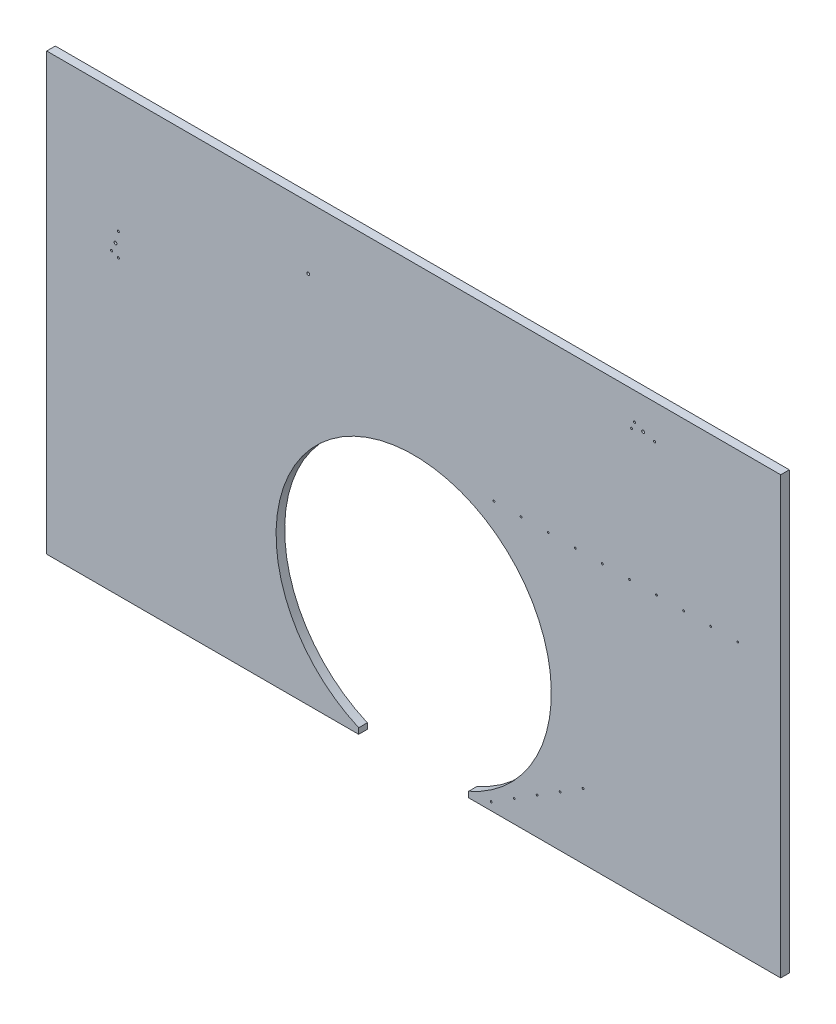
ISO-10303-21;
HEADER;
FILE_DESCRIPTION(('STEP AP214'),'2;1');
FILE_NAME('part.step','',(''),(''),'','','');
FILE_SCHEMA(('AUTOMOTIVE_DESIGN { 1 0 10303 214 1 1 1 1 }'));
ENDSEC;
DATA;
#1=APPLICATION_CONTEXT('core data for automotive mechanical design processes');
#2=APPLICATION_PROTOCOL_DEFINITION('international standard','automotive_design',2000,#1);
#3=PRODUCT_CONTEXT('',#1,'mechanical');
#4=PRODUCT('Part','Part','',(#3));
#5=PRODUCT_RELATED_PRODUCT_CATEGORY('part','',(#4));
#6=PRODUCT_DEFINITION_FORMATION('','',#4);
#7=PRODUCT_DEFINITION_CONTEXT('part definition',#1,'design');
#8=PRODUCT_DEFINITION('design','',#6,#7);
#9=PRODUCT_DEFINITION_SHAPE('','',#8);
#10=(LENGTH_UNIT() NAMED_UNIT(*) SI_UNIT(.MILLI.,.METRE.));
#11=(NAMED_UNIT(*) PLANE_ANGLE_UNIT() SI_UNIT($,.RADIAN.));
#12=(NAMED_UNIT(*) SI_UNIT($,.STERADIAN.) SOLID_ANGLE_UNIT());
#13=UNCERTAINTY_MEASURE_WITH_UNIT(LENGTH_MEASURE(1.E-05),#10,'distance_accuracy_value','');
#14=(GEOMETRIC_REPRESENTATION_CONTEXT(3) GLOBAL_UNCERTAINTY_ASSIGNED_CONTEXT((#13)) GLOBAL_UNIT_ASSIGNED_CONTEXT((#10,
#11,#12)) REPRESENTATION_CONTEXT('',''));
#15=CARTESIAN_POINT('',(0.,0.,0.));
#16=DIRECTION('',(0.,0.,1.));
#17=DIRECTION('',(1.,0.,0.));
#18=AXIS2_PLACEMENT_3D('',#15,#16,#17);
#19=CARTESIAN_POINT('',(-812.8,-12.7,19.05));
#20=DIRECTION('',(0.,1.,0.));
#21=DIRECTION('',(-1.,0.,0.));
#22=AXIS2_PLACEMENT_3D('',#19,#20,#21);
#23=PLANE('',#22);
#24=DIRECTION('',(1.,0.,0.));
#25=VECTOR('',#24,1.);
#26=CARTESIAN_POINT('',(-812.8,-12.7,19.05));
#27=LINE('',#26,#25);
#28=CARTESIAN_POINT('',(121.814120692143,-12.7,19.05));
#29=VERTEX_POINT('',#28);
#30=CARTESIAN_POINT('',(812.8,-12.7,19.05));
#31=VERTEX_POINT('',#30);
#32=EDGE_CURVE('E162',#29,#31,#27,.T.);
#33=ORIENTED_EDGE('',*,*,#32,.F.);
#34=DIRECTION('',(0.,0.,1.));
#35=VECTOR('',#34,1.);
#36=CARTESIAN_POINT('',(121.814120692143,-12.7,0.));
#37=LINE('',#36,#35);
#38=CARTESIAN_POINT('',(121.814120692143,-12.7,0.));
#39=VERTEX_POINT('',#38);
#40=EDGE_CURVE('E215',#39,#29,#37,.T.);
#41=ORIENTED_EDGE('',*,*,#40,.F.);
#42=DIRECTION('',(1.,0.,0.));
#43=VECTOR('',#42,1.);
#44=CARTESIAN_POINT('',(-812.8,-12.7,0.));
#45=LINE('',#44,#43);
#46=CARTESIAN_POINT('',(812.8,-12.7,0.));
#47=VERTEX_POINT('',#46);
#48=EDGE_CURVE('E140',#39,#47,#45,.T.);
#49=ORIENTED_EDGE('',*,*,#48,.T.);
#50=DIRECTION('',(0.,0.,-1.));
#51=VECTOR('',#50,1.);
#52=CARTESIAN_POINT('',(812.8,-12.7,19.05));
#53=LINE('',#52,#51);
#54=EDGE_CURVE('E48',#31,#47,#53,.T.);
#55=ORIENTED_EDGE('',*,*,#54,.F.);
#56=EDGE_LOOP('',(#33,#41,#49,#55));
#57=FACE_BOUND('',#56,.T.);
#58=ADVANCED_FACE('F39',(#57),#23,.F.);
#59=CARTESIAN_POINT('',(-812.8,952.5,19.05));
#60=DIRECTION('',(1.,0.,0.));
#61=DIRECTION('',(0.,1.,0.));
#62=AXIS2_PLACEMENT_3D('',#59,#60,#61);
#63=PLANE('',#62);
#64=DIRECTION('',(0.,-1.,0.));
#65=VECTOR('',#64,1.);
#66=CARTESIAN_POINT('',(-812.8,952.5,0.));
#67=LINE('',#66,#65);
#68=CARTESIAN_POINT('',(-812.8,952.5,0.));
#69=VERTEX_POINT('',#68);
#70=CARTESIAN_POINT('',(-812.8,-12.7,0.));
#71=VERTEX_POINT('',#70);
#72=EDGE_CURVE('E131',#69,#71,#67,.T.);
#73=ORIENTED_EDGE('',*,*,#72,.T.);
#74=DIRECTION('',(0.,0.,-1.));
#75=VECTOR('',#74,1.);
#76=CARTESIAN_POINT('',(-812.8,-12.7,19.05));
#77=LINE('',#76,#75);
#78=CARTESIAN_POINT('',(-812.8,-12.7,19.05));
#79=VERTEX_POINT('',#78);
#80=EDGE_CURVE('E11',#79,#71,#77,.T.);
#81=ORIENTED_EDGE('',*,*,#80,.F.);
#82=DIRECTION('',(0.,-1.,0.));
#83=VECTOR('',#82,1.);
#84=CARTESIAN_POINT('',(-812.8,952.5,19.05));
#85=LINE('',#84,#83);
#86=CARTESIAN_POINT('',(-812.8,952.5,19.05));
#87=VERTEX_POINT('',#86);
#88=EDGE_CURVE('E159',#87,#79,#85,.T.);
#89=ORIENTED_EDGE('',*,*,#88,.F.);
#90=DIRECTION('',(0.,0.,-1.));
#91=VECTOR('',#90,1.);
#92=CARTESIAN_POINT('',(-812.8,952.5,19.05));
#93=LINE('',#92,#91);
#94=EDGE_CURVE('E169',#87,#69,#93,.T.);
#95=ORIENTED_EDGE('',*,*,#94,.T.);
#96=EDGE_LOOP('',(#73,#81,#89,#95));
#97=FACE_BOUND('',#96,.T.);
#98=ADVANCED_FACE('F41',(#97),#63,.F.);
#99=CARTESIAN_POINT('',(-121.814120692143,-12.7,0.));
#100=VERTEX_POINT('',#99);
#101=EDGE_CURVE('E173',#71,#100,#45,.T.);
#102=ORIENTED_EDGE('',*,*,#101,.T.);
#103=DIRECTION('',(0.,0.,1.));
#104=VECTOR('',#103,1.);
#105=CARTESIAN_POINT('',(-121.814120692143,-12.7,0.));
#106=LINE('',#105,#104);
#107=CARTESIAN_POINT('',(-121.814120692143,-12.7,19.05));
#108=VERTEX_POINT('',#107);
#109=EDGE_CURVE('E213',#100,#108,#106,.T.);
#110=ORIENTED_EDGE('',*,*,#109,.T.);
#111=EDGE_CURVE('E88',#79,#108,#27,.T.);
#112=ORIENTED_EDGE('',*,*,#111,.F.);
#113=ORIENTED_EDGE('',*,*,#80,.T.);
#114=EDGE_LOOP('',(#102,#110,#112,#113));
#115=FACE_BOUND('',#114,.T.);
#116=ADVANCED_FACE('F203',(#115),#23,.F.);
#117=CARTESIAN_POINT('',(812.8,952.5,19.05));
#118=DIRECTION('',(-1.,0.,0.));
#119=DIRECTION('',(0.,-1.,0.));
#120=AXIS2_PLACEMENT_3D('',#117,#118,#119);
#121=PLANE('',#120);
#122=DIRECTION('',(0.,1.,0.));
#123=VECTOR('',#122,1.);
#124=CARTESIAN_POINT('',(812.8,952.5,0.));
#125=LINE('',#124,#123);
#126=CARTESIAN_POINT('',(812.8,952.5,0.));
#127=VERTEX_POINT('',#126);
#128=EDGE_CURVE('E75',#47,#127,#125,.T.);
#129=ORIENTED_EDGE('',*,*,#128,.T.);
#130=DIRECTION('',(0.,0.,-1.));
#131=VECTOR('',#130,1.);
#132=CARTESIAN_POINT('',(812.8,952.5,19.05));
#133=LINE('',#132,#131);
#134=CARTESIAN_POINT('',(812.8,952.5,19.05));
#135=VERTEX_POINT('',#134);
#136=EDGE_CURVE('E181',#135,#127,#133,.T.);
#137=ORIENTED_EDGE('',*,*,#136,.F.);
#138=DIRECTION('',(0.,1.,0.));
#139=VECTOR('',#138,1.);
#140=CARTESIAN_POINT('',(812.8,952.5,19.05));
#141=LINE('',#140,#139);
#142=EDGE_CURVE('E164',#31,#135,#141,.T.);
#143=ORIENTED_EDGE('',*,*,#142,.F.);
#144=ORIENTED_EDGE('',*,*,#54,.T.);
#145=EDGE_LOOP('',(#129,#137,#143,#144));
#146=FACE_BOUND('',#145,.T.);
#147=ADVANCED_FACE('F187',(#146),#121,.F.);
#148=CARTESIAN_POINT('',(-812.8,952.5,19.05));
#149=DIRECTION('',(0.,-1.,0.));
#150=DIRECTION('',(1.,0.,0.));
#151=AXIS2_PLACEMENT_3D('',#148,#149,#150);
#152=PLANE('',#151);
#153=DIRECTION('',(-1.,0.,0.));
#154=VECTOR('',#153,1.);
#155=CARTESIAN_POINT('',(-812.8,952.5,0.));
#156=LINE('',#155,#154);
#157=EDGE_CURVE('E81',#127,#69,#156,.T.);
#158=ORIENTED_EDGE('',*,*,#157,.T.);
#159=ORIENTED_EDGE('',*,*,#94,.F.);
#160=DIRECTION('',(-1.,0.,0.));
#161=VECTOR('',#160,1.);
#162=CARTESIAN_POINT('',(-812.8,952.5,19.05));
#163=LINE('',#162,#161);
#164=EDGE_CURVE('E56',#135,#87,#163,.T.);
#165=ORIENTED_EDGE('',*,*,#164,.F.);
#166=ORIENTED_EDGE('',*,*,#136,.T.);
#167=EDGE_LOOP('',(#158,#159,#165,#166));
#168=FACE_BOUND('',#167,.T.);
#169=ADVANCED_FACE('F194',(#168),#152,.F.);
#170=CARTESIAN_POINT('',(0.,0.,19.05));
#171=DIRECTION('',(0.,0.,1.));
#172=DIRECTION('',(1.,0.,0.));
#173=AXIS2_PLACEMENT_3D('',#170,#171,#172);
#174=PLANE('',#173);
#175=DIRECTION('',(0.,1.,0.));
#176=VECTOR('',#175,1.);
#177=CARTESIAN_POINT('',(121.814120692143,-12.7,19.05));
#178=LINE('',#177,#176);
#179=CARTESIAN_POINT('',(121.814120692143,1.11022302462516E-13,19.05));
#180=VERTEX_POINT('',#179);
#181=EDGE_CURVE('E125',#29,#180,#178,.T.);
#182=ORIENTED_EDGE('',*,*,#181,.F.);
#183=ORIENTED_EDGE('',*,*,#32,.T.);
#184=ORIENTED_EDGE('',*,*,#142,.T.);
#185=ORIENTED_EDGE('',*,*,#164,.T.);
#186=ORIENTED_EDGE('',*,*,#88,.T.);
#187=ORIENTED_EDGE('',*,*,#111,.T.);
#188=DIRECTION('',(0.,-1.,0.));
#189=VECTOR('',#188,1.);
#190=CARTESIAN_POINT('',(-121.814120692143,-12.7,19.05));
#191=LINE('',#190,#189);
#192=CARTESIAN_POINT('',(-121.814120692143,0.,19.05));
#193=VERTEX_POINT('',#192);
#194=EDGE_CURVE('E143',#193,#108,#191,.T.);
#195=ORIENTED_EDGE('',*,*,#194,.F.);
#196=CARTESIAN_POINT('',(0.,279.4,19.05));
#197=DIRECTION('',(0.,0.,1.));
#198=DIRECTION('',(1.,0.,0.));
#199=AXIS2_PLACEMENT_3D('',#196,#197,#198);
#200=CIRCLE('',#199,304.8);
#201=EDGE_CURVE('E148',#180,#193,#200,.T.);
#202=ORIENTED_EDGE('',*,*,#201,.F.);
#203=EDGE_LOOP('',(#182,#183,#184,#185,#186,#187,#195,#202));
#204=FACE_BOUND('',#203,.T.);
#205=CARTESIAN_POINT('',(533.4,876.3,19.05));
#206=DIRECTION('',(0.,0.,-1.));
#207=DIRECTION('',(-1.,0.,0.));
#208=AXIS2_PLACEMENT_3D('',#205,#206,#207);
#209=CIRCLE('',#208,2.24790000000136);
#210=CARTESIAN_POINT('',(531.152099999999,876.3,19.05));
#211=VERTEX_POINT('',#210);
#212=EDGE_CURVE('E227',#211,#211,#209,.T.);
#213=ORIENTED_EDGE('',*,*,#212,.T.);
#214=EDGE_LOOP('',(#213));
#215=FACE_BOUND('',#214,.T.);
#216=CARTESIAN_POINT('',(482.6,876.3,19.05));
#217=DIRECTION('',(0.,0.,-1.));
#218=DIRECTION('',(-1.,0.,0.));
#219=AXIS2_PLACEMENT_3D('',#216,#217,#218);
#220=CIRCLE('',#219,2.24790000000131);
#221=CARTESIAN_POINT('',(480.352099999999,876.3,19.05));
#222=VERTEX_POINT('',#221);
#223=EDGE_CURVE('E234',#222,#222,#220,.T.);
#224=ORIENTED_EDGE('',*,*,#223,.T.);
#225=EDGE_LOOP('',(#224));
#226=FACE_BOUND('',#225,.T.);
#227=CARTESIAN_POINT('',(488.95,891.54,19.05));
#228=DIRECTION('',(0.,0.,-1.));
#229=DIRECTION('',(-1.,0.,0.));
#230=AXIS2_PLACEMENT_3D('',#227,#228,#229);
#231=CIRCLE('',#230,2.24790000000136);
#232=CARTESIAN_POINT('',(486.702099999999,891.54,19.05));
#233=VERTEX_POINT('',#232);
#234=EDGE_CURVE('E242',#233,#233,#231,.T.);
#235=ORIENTED_EDGE('',*,*,#234,.T.);
#236=EDGE_LOOP('',(#235));
#237=FACE_BOUND('',#236,.T.);
#238=CARTESIAN_POINT('',(-654.05,635.,19.05));
#239=DIRECTION('',(0.,0.,-1.));
#240=DIRECTION('',(-1.,0.,0.));
#241=AXIS2_PLACEMENT_3D('',#238,#239,#240);
#242=CIRCLE('',#241,2.24790000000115);
#243=CARTESIAN_POINT('',(-656.297900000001,635.,19.05));
#244=VERTEX_POINT('',#243);
#245=EDGE_CURVE('E250',#244,#244,#242,.T.);
#246=ORIENTED_EDGE('',*,*,#245,.T.);
#247=EDGE_LOOP('',(#246));
#248=FACE_BOUND('',#247,.T.);
#249=CARTESIAN_POINT('',(-669.29,641.35,19.05));
#250=DIRECTION('',(0.,0.,-1.));
#251=DIRECTION('',(-1.,0.,0.));
#252=AXIS2_PLACEMENT_3D('',#249,#250,#251);
#253=CIRCLE('',#252,2.24790000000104);
#254=CARTESIAN_POINT('',(-671.537900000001,641.35,19.05));
#255=VERTEX_POINT('',#254);
#256=EDGE_CURVE('E256',#255,#255,#253,.T.);
#257=ORIENTED_EDGE('',*,*,#256,.T.);
#258=EDGE_LOOP('',(#257));
#259=FACE_BOUND('',#258,.T.);
#260=CARTESIAN_POINT('',(-654.05,685.8,19.05));
#261=DIRECTION('',(0.,0.,-1.));
#262=DIRECTION('',(-1.,0.,0.));
#263=AXIS2_PLACEMENT_3D('',#260,#261,#262);
#264=CIRCLE('',#263,2.24790000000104);
#265=CARTESIAN_POINT('',(-656.297900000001,685.8,19.05));
#266=VERTEX_POINT('',#265);
#267=EDGE_CURVE('E262',#266,#266,#264,.T.);
#268=ORIENTED_EDGE('',*,*,#267,.T.);
#269=EDGE_LOOP('',(#268));
#270=FACE_BOUND('',#269,.T.);
#271=CARTESIAN_POINT('',(375.145896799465,131.940247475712,19.05));
#272=DIRECTION('',(0.,0.,1.));
#273=DIRECTION('',(1.,0.,0.));
#274=AXIS2_PLACEMENT_3D('',#271,#272,#273);
#275=CIRCLE('',#274,2.);
#276=CARTESIAN_POINT('',(377.145896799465,131.940247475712,19.05));
#277=VERTEX_POINT('',#276);
#278=EDGE_CURVE('E265',#277,#277,#275,.T.);
#279=ORIENTED_EDGE('',*,*,#278,.F.);
#280=EDGE_LOOP('',(#279));
#281=FACE_BOUND('',#280,.T.);
#282=CARTESIAN_POINT('',(324.26301103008,100.145091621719,19.05));
#283=DIRECTION('',(0.,0.,1.));
#284=DIRECTION('',(1.,0.,0.));
#285=AXIS2_PLACEMENT_3D('',#282,#283,#284);
#286=CIRCLE('',#285,2.);
#287=CARTESIAN_POINT('',(326.26301103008,100.145091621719,19.05));
#288=VERTEX_POINT('',#287);
#289=EDGE_CURVE('E272',#288,#288,#286,.T.);
#290=ORIENTED_EDGE('',*,*,#289,.F.);
#291=EDGE_LOOP('',(#290));
#292=FACE_BOUND('',#291,.T.);
#293=CARTESIAN_POINT('',(273.380125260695,68.3499357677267,19.05));
#294=DIRECTION('',(0.,0.,1.));
#295=DIRECTION('',(1.,0.,0.));
#296=AXIS2_PLACEMENT_3D('',#293,#294,#295);
#297=CIRCLE('',#296,2.);
#298=CARTESIAN_POINT('',(275.380125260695,68.3499357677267,19.05));
#299=VERTEX_POINT('',#298);
#300=EDGE_CURVE('E280',#299,#299,#297,.T.);
#301=ORIENTED_EDGE('',*,*,#300,.F.);
#302=EDGE_LOOP('',(#301));
#303=FACE_BOUND('',#302,.T.);
#304=CARTESIAN_POINT('',(222.497239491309,36.5547799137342,19.05));
#305=DIRECTION('',(0.,0.,1.));
#306=DIRECTION('',(1.,0.,0.));
#307=AXIS2_PLACEMENT_3D('',#304,#305,#306);
#308=CIRCLE('',#307,2.);
#309=CARTESIAN_POINT('',(224.497239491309,36.5547799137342,19.05));
#310=VERTEX_POINT('',#309);
#311=EDGE_CURVE('E288',#310,#310,#308,.T.);
#312=ORIENTED_EDGE('',*,*,#311,.F.);
#313=EDGE_LOOP('',(#312));
#314=FACE_BOUND('',#313,.T.);
#315=CARTESIAN_POINT('',(171.614353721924,4.75962405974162,19.05));
#316=DIRECTION('',(0.,0.,1.));
#317=DIRECTION('',(1.,0.,0.));
#318=AXIS2_PLACEMENT_3D('',#315,#316,#317);
#319=CIRCLE('',#318,2.);
#320=CARTESIAN_POINT('',(173.614353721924,4.75962405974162,19.05));
#321=VERTEX_POINT('',#320);
#322=EDGE_CURVE('E296',#321,#321,#319,.T.);
#323=ORIENTED_EDGE('',*,*,#322,.F.);
#324=EDGE_LOOP('',(#323));
#325=FACE_BOUND('',#324,.T.);
#326=CARTESIAN_POINT('',(717.8,584.2,19.05));
#327=DIRECTION('',(0.,0.,1.));
#328=DIRECTION('',(1.,0.,0.));
#329=AXIS2_PLACEMENT_3D('',#326,#327,#328);
#330=CIRCLE('',#329,2.);
#331=CARTESIAN_POINT('',(719.8,584.2,19.05));
#332=VERTEX_POINT('',#331);
#333=EDGE_CURVE('E303',#332,#332,#330,.T.);
#334=ORIENTED_EDGE('',*,*,#333,.F.);
#335=EDGE_LOOP('',(#334));
#336=FACE_BOUND('',#335,.T.);
#337=CARTESIAN_POINT('',(657.8,584.2,19.05));
#338=DIRECTION('',(0.,0.,1.));
#339=DIRECTION('',(1.,0.,0.));
#340=AXIS2_PLACEMENT_3D('',#337,#338,#339);
#341=CIRCLE('',#340,2.);
#342=CARTESIAN_POINT('',(659.8,584.2,19.05));
#343=VERTEX_POINT('',#342);
#344=EDGE_CURVE('E311',#343,#343,#341,.T.);
#345=ORIENTED_EDGE('',*,*,#344,.F.);
#346=EDGE_LOOP('',(#345));
#347=FACE_BOUND('',#346,.T.);
#348=CARTESIAN_POINT('',(597.8,584.2,19.05));
#349=DIRECTION('',(0.,0.,1.));
#350=DIRECTION('',(1.,0.,0.));
#351=AXIS2_PLACEMENT_3D('',#348,#349,#350);
#352=CIRCLE('',#351,2.0000000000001);
#353=CARTESIAN_POINT('',(599.8,584.2,19.05));
#354=VERTEX_POINT('',#353);
#355=EDGE_CURVE('E319',#354,#354,#352,.T.);
#356=ORIENTED_EDGE('',*,*,#355,.F.);
#357=EDGE_LOOP('',(#356));
#358=FACE_BOUND('',#357,.T.);
#359=CARTESIAN_POINT('',(537.8,584.2,19.05));
#360=DIRECTION('',(0.,0.,1.));
#361=DIRECTION('',(1.,0.,0.));
#362=AXIS2_PLACEMENT_3D('',#359,#360,#361);
#363=CIRCLE('',#362,2.);
#364=CARTESIAN_POINT('',(539.8,584.2,19.05));
#365=VERTEX_POINT('',#364);
#366=EDGE_CURVE('E326',#365,#365,#363,.T.);
#367=ORIENTED_EDGE('',*,*,#366,.F.);
#368=EDGE_LOOP('',(#367));
#369=FACE_BOUND('',#368,.T.);
#370=CARTESIAN_POINT('',(477.8,584.2,19.05));
#371=DIRECTION('',(0.,0.,1.));
#372=DIRECTION('',(1.,0.,0.));
#373=AXIS2_PLACEMENT_3D('',#370,#371,#372);
#374=CIRCLE('',#373,2.);
#375=CARTESIAN_POINT('',(479.8,584.2,19.05));
#376=VERTEX_POINT('',#375);
#377=EDGE_CURVE('E332',#376,#376,#374,.T.);
#378=ORIENTED_EDGE('',*,*,#377,.F.);
#379=EDGE_LOOP('',(#378));
#380=FACE_BOUND('',#379,.T.);
#381=CARTESIAN_POINT('',(417.8,584.2,19.05));
#382=DIRECTION('',(0.,0.,1.));
#383=DIRECTION('',(1.,0.,0.));
#384=AXIS2_PLACEMENT_3D('',#381,#382,#383);
#385=CIRCLE('',#384,2.);
#386=CARTESIAN_POINT('',(419.8,584.2,19.05));
#387=VERTEX_POINT('',#386);
#388=EDGE_CURVE('E338',#387,#387,#385,.T.);
#389=ORIENTED_EDGE('',*,*,#388,.F.);
#390=EDGE_LOOP('',(#389));
#391=FACE_BOUND('',#390,.T.);
#392=CARTESIAN_POINT('',(357.8,584.2,19.05));
#393=DIRECTION('',(0.,0.,1.));
#394=DIRECTION('',(1.,0.,0.));
#395=AXIS2_PLACEMENT_3D('',#392,#393,#394);
#396=CIRCLE('',#395,2.);
#397=CARTESIAN_POINT('',(359.8,584.2,19.05));
#398=VERTEX_POINT('',#397);
#399=EDGE_CURVE('E344',#398,#398,#396,.T.);
#400=ORIENTED_EDGE('',*,*,#399,.F.);
#401=EDGE_LOOP('',(#400));
#402=FACE_BOUND('',#401,.T.);
#403=CARTESIAN_POINT('',(297.8,584.2,19.05));
#404=DIRECTION('',(0.,0.,1.));
#405=DIRECTION('',(1.,0.,0.));
#406=AXIS2_PLACEMENT_3D('',#403,#404,#405);
#407=CIRCLE('',#406,2.);
#408=CARTESIAN_POINT('',(299.8,584.2,19.05));
#409=VERTEX_POINT('',#408);
#410=EDGE_CURVE('E351',#409,#409,#407,.T.);
#411=ORIENTED_EDGE('',*,*,#410,.F.);
#412=EDGE_LOOP('',(#411));
#413=FACE_BOUND('',#412,.T.);
#414=CARTESIAN_POINT('',(237.8,584.2,19.05));
#415=DIRECTION('',(0.,0.,1.));
#416=DIRECTION('',(1.,0.,0.));
#417=AXIS2_PLACEMENT_3D('',#414,#415,#416);
#418=CIRCLE('',#417,2.);
#419=CARTESIAN_POINT('',(239.8,584.2,19.05));
#420=VERTEX_POINT('',#419);
#421=EDGE_CURVE('E359',#420,#420,#418,.T.);
#422=ORIENTED_EDGE('',*,*,#421,.F.);
#423=EDGE_LOOP('',(#422));
#424=FACE_BOUND('',#423,.T.);
#425=CARTESIAN_POINT('',(177.8,584.2,19.05));
#426=DIRECTION('',(0.,0.,1.));
#427=DIRECTION('',(1.,0.,0.));
#428=AXIS2_PLACEMENT_3D('',#425,#426,#427);
#429=CIRCLE('',#428,2.);
#430=CARTESIAN_POINT('',(179.8,584.2,19.05));
#431=VERTEX_POINT('',#430);
#432=EDGE_CURVE('E366',#431,#431,#429,.T.);
#433=ORIENTED_EDGE('',*,*,#432,.F.);
#434=EDGE_LOOP('',(#433));
#435=FACE_BOUND('',#434,.T.);
#436=CARTESIAN_POINT('',(-660.4,660.4,19.05));
#437=DIRECTION('',(0.,0.,1.));
#438=DIRECTION('',(1.,0.,0.));
#439=AXIS2_PLACEMENT_3D('',#436,#437,#438);
#440=CIRCLE('',#439,3.17500000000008);
#441=CARTESIAN_POINT('',(-657.225,660.4,19.05));
#442=VERTEX_POINT('',#441);
#443=EDGE_CURVE('E374',#442,#442,#440,.T.);
#444=ORIENTED_EDGE('',*,*,#443,.F.);
#445=EDGE_LOOP('',(#444));
#446=FACE_BOUND('',#445,.T.);
#447=CARTESIAN_POINT('',(-233.477064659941,814.916666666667,19.05));
#448=DIRECTION('',(0.,0.,1.));
#449=DIRECTION('',(1.,0.,0.));
#450=AXIS2_PLACEMENT_3D('',#447,#448,#449);
#451=CIRCLE('',#450,3.175);
#452=CARTESIAN_POINT('',(-230.302064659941,814.916666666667,19.05));
#453=VERTEX_POINT('',#452);
#454=EDGE_CURVE('E381',#453,#453,#451,.T.);
#455=ORIENTED_EDGE('',*,*,#454,.F.);
#456=EDGE_LOOP('',(#455));
#457=FACE_BOUND('',#456,.T.);
#458=CARTESIAN_POINT('',(508.,882.65,19.05));
#459=DIRECTION('',(0.,0.,1.));
#460=DIRECTION('',(1.,0.,0.));
#461=AXIS2_PLACEMENT_3D('',#458,#459,#460);
#462=CIRCLE('',#461,3.17500000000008);
#463=CARTESIAN_POINT('',(511.175,882.65,19.05));
#464=VERTEX_POINT('',#463);
#465=EDGE_CURVE('E156',#464,#464,#462,.T.);
#466=ORIENTED_EDGE('',*,*,#465,.F.);
#467=EDGE_LOOP('',(#466));
#468=FACE_BOUND('',#467,.T.);
#469=ADVANCED_FACE('F196',(#204,#215,#226,#237,#248,#259,#270,#281,#292,#303,#314,#325,#336,
#347,#358,#369,#380,#391,#402,#413,#424,#435,#446,#457,#468),#174,.T.);
#470=CARTESIAN_POINT('',(0.,0.,0.));
#471=DIRECTION('',(0.,0.,1.));
#472=DIRECTION('',(1.,0.,0.));
#473=AXIS2_PLACEMENT_3D('',#470,#471,#472);
#474=PLANE('',#473);
#475=CARTESIAN_POINT('',(533.4,876.3,0.));
#476=DIRECTION('',(0.,0.,-1.));
#477=DIRECTION('',(-1.,0.,0.));
#478=AXIS2_PLACEMENT_3D('',#475,#476,#477);
#479=CIRCLE('',#478,2.24790000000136);
#480=CARTESIAN_POINT('',(531.152099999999,876.3,0.));
#481=VERTEX_POINT('',#480);
#482=EDGE_CURVE('E225',#481,#481,#479,.T.);
#483=ORIENTED_EDGE('',*,*,#482,.F.);
#484=EDGE_LOOP('',(#483));
#485=FACE_BOUND('',#484,.T.);
#486=CARTESIAN_POINT('',(482.6,876.3,0.));
#487=DIRECTION('',(0.,0.,-1.));
#488=DIRECTION('',(-1.,0.,0.));
#489=AXIS2_PLACEMENT_3D('',#486,#487,#488);
#490=CIRCLE('',#489,2.24790000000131);
#491=CARTESIAN_POINT('',(480.352099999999,876.3,0.));
#492=VERTEX_POINT('',#491);
#493=EDGE_CURVE('E231',#492,#492,#490,.T.);
#494=ORIENTED_EDGE('',*,*,#493,.F.);
#495=EDGE_LOOP('',(#494));
#496=FACE_BOUND('',#495,.T.);
#497=CARTESIAN_POINT('',(488.95,891.54,0.));
#498=DIRECTION('',(0.,0.,-1.));
#499=DIRECTION('',(-1.,0.,0.));
#500=AXIS2_PLACEMENT_3D('',#497,#498,#499);
#501=CIRCLE('',#500,2.24790000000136);
#502=CARTESIAN_POINT('',(486.702099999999,891.54,0.));
#503=VERTEX_POINT('',#502);
#504=EDGE_CURVE('E238',#503,#503,#501,.T.);
#505=ORIENTED_EDGE('',*,*,#504,.F.);
#506=EDGE_LOOP('',(#505));
#507=FACE_BOUND('',#506,.T.);
#508=CARTESIAN_POINT('',(-654.05,635.,0.));
#509=DIRECTION('',(0.,0.,-1.));
#510=DIRECTION('',(-1.,0.,0.));
#511=AXIS2_PLACEMENT_3D('',#508,#509,#510);
#512=CIRCLE('',#511,2.24790000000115);
#513=CARTESIAN_POINT('',(-656.297900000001,635.,0.));
#514=VERTEX_POINT('',#513);
#515=EDGE_CURVE('E246',#514,#514,#512,.T.);
#516=ORIENTED_EDGE('',*,*,#515,.F.);
#517=EDGE_LOOP('',(#516));
#518=FACE_BOUND('',#517,.T.);
#519=CARTESIAN_POINT('',(-669.29,641.35,0.));
#520=DIRECTION('',(0.,0.,-1.));
#521=DIRECTION('',(-1.,0.,0.));
#522=AXIS2_PLACEMENT_3D('',#519,#520,#521);
#523=CIRCLE('',#522,2.24790000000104);
#524=CARTESIAN_POINT('',(-671.537900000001,641.35,0.));
#525=VERTEX_POINT('',#524);
#526=EDGE_CURVE('E253',#525,#525,#523,.T.);
#527=ORIENTED_EDGE('',*,*,#526,.F.);
#528=EDGE_LOOP('',(#527));
#529=FACE_BOUND('',#528,.T.);
#530=CARTESIAN_POINT('',(-654.05,685.8,0.));
#531=DIRECTION('',(0.,0.,-1.));
#532=DIRECTION('',(-1.,0.,0.));
#533=AXIS2_PLACEMENT_3D('',#530,#531,#532);
#534=CIRCLE('',#533,2.24790000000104);
#535=CARTESIAN_POINT('',(-656.297900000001,685.8,0.));
#536=VERTEX_POINT('',#535);
#537=EDGE_CURVE('E259',#536,#536,#534,.T.);
#538=ORIENTED_EDGE('',*,*,#537,.F.);
#539=EDGE_LOOP('',(#538));
#540=FACE_BOUND('',#539,.T.);
#541=CARTESIAN_POINT('',(375.145896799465,131.940247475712,0.));
#542=DIRECTION('',(0.,0.,1.));
#543=DIRECTION('',(1.,0.,0.));
#544=AXIS2_PLACEMENT_3D('',#541,#542,#543);
#545=CIRCLE('',#544,2.);
#546=CARTESIAN_POINT('',(377.145896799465,131.940247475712,0.));
#547=VERTEX_POINT('',#546);
#548=EDGE_CURVE('E268',#547,#547,#545,.T.);
#549=ORIENTED_EDGE('',*,*,#548,.T.);
#550=EDGE_LOOP('',(#549));
#551=FACE_BOUND('',#550,.T.);
#552=CARTESIAN_POINT('',(324.26301103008,100.145091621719,0.));
#553=DIRECTION('',(0.,0.,1.));
#554=DIRECTION('',(1.,0.,0.));
#555=AXIS2_PLACEMENT_3D('',#552,#553,#554);
#556=CIRCLE('',#555,2.);
#557=CARTESIAN_POINT('',(326.26301103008,100.145091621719,0.));
#558=VERTEX_POINT('',#557);
#559=EDGE_CURVE('E276',#558,#558,#556,.T.);
#560=ORIENTED_EDGE('',*,*,#559,.T.);
#561=EDGE_LOOP('',(#560));
#562=FACE_BOUND('',#561,.T.);
#563=CARTESIAN_POINT('',(273.380125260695,68.3499357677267,0.));
#564=DIRECTION('',(0.,0.,1.));
#565=DIRECTION('',(1.,0.,0.));
#566=AXIS2_PLACEMENT_3D('',#563,#564,#565);
#567=CIRCLE('',#566,2.);
#568=CARTESIAN_POINT('',(275.380125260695,68.3499357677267,0.));
#569=VERTEX_POINT('',#568);
#570=EDGE_CURVE('E284',#569,#569,#567,.T.);
#571=ORIENTED_EDGE('',*,*,#570,.T.);
#572=EDGE_LOOP('',(#571));
#573=FACE_BOUND('',#572,.T.);
#574=CARTESIAN_POINT('',(222.497239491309,36.5547799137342,0.));
#575=DIRECTION('',(0.,0.,1.));
#576=DIRECTION('',(1.,0.,0.));
#577=AXIS2_PLACEMENT_3D('',#574,#575,#576);
#578=CIRCLE('',#577,2.);
#579=CARTESIAN_POINT('',(224.497239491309,36.5547799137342,0.));
#580=VERTEX_POINT('',#579);
#581=EDGE_CURVE('E292',#580,#580,#578,.T.);
#582=ORIENTED_EDGE('',*,*,#581,.T.);
#583=EDGE_LOOP('',(#582));
#584=FACE_BOUND('',#583,.T.);
#585=CARTESIAN_POINT('',(171.614353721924,4.75962405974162,0.));
#586=DIRECTION('',(0.,0.,1.));
#587=DIRECTION('',(1.,0.,0.));
#588=AXIS2_PLACEMENT_3D('',#585,#586,#587);
#589=CIRCLE('',#588,2.);
#590=CARTESIAN_POINT('',(173.614353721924,4.75962405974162,0.));
#591=VERTEX_POINT('',#590);
#592=EDGE_CURVE('E299',#591,#591,#589,.T.);
#593=ORIENTED_EDGE('',*,*,#592,.T.);
#594=EDGE_LOOP('',(#593));
#595=FACE_BOUND('',#594,.T.);
#596=CARTESIAN_POINT('',(717.8,584.2,0.));
#597=DIRECTION('',(0.,0.,1.));
#598=DIRECTION('',(1.,0.,0.));
#599=AXIS2_PLACEMENT_3D('',#596,#597,#598);
#600=CIRCLE('',#599,2.);
#601=CARTESIAN_POINT('',(719.8,584.2,0.));
#602=VERTEX_POINT('',#601);
#603=EDGE_CURVE('E307',#602,#602,#600,.T.);
#604=ORIENTED_EDGE('',*,*,#603,.T.);
#605=EDGE_LOOP('',(#604));
#606=FACE_BOUND('',#605,.T.);
#607=CARTESIAN_POINT('',(657.8,584.2,0.));
#608=DIRECTION('',(0.,0.,1.));
#609=DIRECTION('',(1.,0.,0.));
#610=AXIS2_PLACEMENT_3D('',#607,#608,#609);
#611=CIRCLE('',#610,2.);
#612=CARTESIAN_POINT('',(659.8,584.2,0.));
#613=VERTEX_POINT('',#612);
#614=EDGE_CURVE('E315',#613,#613,#611,.T.);
#615=ORIENTED_EDGE('',*,*,#614,.T.);
#616=EDGE_LOOP('',(#615));
#617=FACE_BOUND('',#616,.T.);
#618=CARTESIAN_POINT('',(597.8,584.2,0.));
#619=DIRECTION('',(0.,0.,1.));
#620=DIRECTION('',(1.,0.,0.));
#621=AXIS2_PLACEMENT_3D('',#618,#619,#620);
#622=CIRCLE('',#621,2.0000000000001);
#623=CARTESIAN_POINT('',(599.8,584.2,0.));
#624=VERTEX_POINT('',#623);
#625=EDGE_CURVE('E323',#624,#624,#622,.T.);
#626=ORIENTED_EDGE('',*,*,#625,.T.);
#627=EDGE_LOOP('',(#626));
#628=FACE_BOUND('',#627,.T.);
#629=CARTESIAN_POINT('',(537.8,584.2,0.));
#630=DIRECTION('',(0.,0.,1.));
#631=DIRECTION('',(1.,0.,0.));
#632=AXIS2_PLACEMENT_3D('',#629,#630,#631);
#633=CIRCLE('',#632,2.);
#634=CARTESIAN_POINT('',(539.8,584.2,0.));
#635=VERTEX_POINT('',#634);
#636=EDGE_CURVE('E329',#635,#635,#633,.T.);
#637=ORIENTED_EDGE('',*,*,#636,.T.);
#638=EDGE_LOOP('',(#637));
#639=FACE_BOUND('',#638,.T.);
#640=CARTESIAN_POINT('',(477.8,584.2,0.));
#641=DIRECTION('',(0.,0.,1.));
#642=DIRECTION('',(1.,0.,0.));
#643=AXIS2_PLACEMENT_3D('',#640,#641,#642);
#644=CIRCLE('',#643,2.);
#645=CARTESIAN_POINT('',(479.8,584.2,0.));
#646=VERTEX_POINT('',#645);
#647=EDGE_CURVE('E335',#646,#646,#644,.T.);
#648=ORIENTED_EDGE('',*,*,#647,.T.);
#649=EDGE_LOOP('',(#648));
#650=FACE_BOUND('',#649,.T.);
#651=CARTESIAN_POINT('',(417.8,584.2,0.));
#652=DIRECTION('',(0.,0.,1.));
#653=DIRECTION('',(1.,0.,0.));
#654=AXIS2_PLACEMENT_3D('',#651,#652,#653);
#655=CIRCLE('',#654,2.);
#656=CARTESIAN_POINT('',(419.8,584.2,0.));
#657=VERTEX_POINT('',#656);
#658=EDGE_CURVE('E341',#657,#657,#655,.T.);
#659=ORIENTED_EDGE('',*,*,#658,.T.);
#660=EDGE_LOOP('',(#659));
#661=FACE_BOUND('',#660,.T.);
#662=CARTESIAN_POINT('',(357.8,584.2,0.));
#663=DIRECTION('',(0.,0.,1.));
#664=DIRECTION('',(1.,0.,0.));
#665=AXIS2_PLACEMENT_3D('',#662,#663,#664);
#666=CIRCLE('',#665,2.);
#667=CARTESIAN_POINT('',(359.8,584.2,0.));
#668=VERTEX_POINT('',#667);
#669=EDGE_CURVE('E347',#668,#668,#666,.T.);
#670=ORIENTED_EDGE('',*,*,#669,.T.);
#671=EDGE_LOOP('',(#670));
#672=FACE_BOUND('',#671,.T.);
#673=CARTESIAN_POINT('',(297.8,584.2,0.));
#674=DIRECTION('',(0.,0.,1.));
#675=DIRECTION('',(1.,0.,0.));
#676=AXIS2_PLACEMENT_3D('',#673,#674,#675);
#677=CIRCLE('',#676,2.);
#678=CARTESIAN_POINT('',(299.8,584.2,0.));
#679=VERTEX_POINT('',#678);
#680=EDGE_CURVE('E355',#679,#679,#677,.T.);
#681=ORIENTED_EDGE('',*,*,#680,.T.);
#682=EDGE_LOOP('',(#681));
#683=FACE_BOUND('',#682,.T.);
#684=CARTESIAN_POINT('',(237.8,584.2,0.));
#685=DIRECTION('',(0.,0.,1.));
#686=DIRECTION('',(1.,0.,0.));
#687=AXIS2_PLACEMENT_3D('',#684,#685,#686);
#688=CIRCLE('',#687,2.);
#689=CARTESIAN_POINT('',(239.8,584.2,0.));
#690=VERTEX_POINT('',#689);
#691=EDGE_CURVE('E362',#690,#690,#688,.T.);
#692=ORIENTED_EDGE('',*,*,#691,.T.);
#693=EDGE_LOOP('',(#692));
#694=FACE_BOUND('',#693,.T.);
#695=CARTESIAN_POINT('',(177.8,584.2,0.));
#696=DIRECTION('',(0.,0.,1.));
#697=DIRECTION('',(1.,0.,0.));
#698=AXIS2_PLACEMENT_3D('',#695,#696,#697);
#699=CIRCLE('',#698,2.);
#700=CARTESIAN_POINT('',(179.8,584.2,0.));
#701=VERTEX_POINT('',#700);
#702=EDGE_CURVE('E370',#701,#701,#699,.T.);
#703=ORIENTED_EDGE('',*,*,#702,.T.);
#704=EDGE_LOOP('',(#703));
#705=FACE_BOUND('',#704,.T.);
#706=ORIENTED_EDGE('',*,*,#48,.F.);
#707=DIRECTION('',(0.,1.,0.));
#708=VECTOR('',#707,1.);
#709=CARTESIAN_POINT('',(121.814120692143,-12.7,0.));
#710=LINE('',#709,#708);
#711=CARTESIAN_POINT('',(121.814120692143,1.11022302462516E-13,0.));
#712=VERTEX_POINT('',#711);
#713=EDGE_CURVE('E122',#39,#712,#710,.T.);
#714=ORIENTED_EDGE('',*,*,#713,.T.);
#715=CARTESIAN_POINT('',(0.,279.4,0.));
#716=DIRECTION('',(0.,0.,1.));
#717=DIRECTION('',(1.,0.,0.));
#718=AXIS2_PLACEMENT_3D('',#715,#716,#717);
#719=CIRCLE('',#718,304.8);
#720=CARTESIAN_POINT('',(-121.814120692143,0.,0.));
#721=VERTEX_POINT('',#720);
#722=EDGE_CURVE('E139',#712,#721,#719,.T.);
#723=ORIENTED_EDGE('',*,*,#722,.T.);
#724=DIRECTION('',(0.,-1.,0.));
#725=VECTOR('',#724,1.);
#726=CARTESIAN_POINT('',(-121.814120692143,-12.7,0.));
#727=LINE('',#726,#725);
#728=EDGE_CURVE('E142',#721,#100,#727,.T.);
#729=ORIENTED_EDGE('',*,*,#728,.T.);
#730=ORIENTED_EDGE('',*,*,#101,.F.);
#731=ORIENTED_EDGE('',*,*,#72,.F.);
#732=ORIENTED_EDGE('',*,*,#157,.F.);
#733=ORIENTED_EDGE('',*,*,#128,.F.);
#734=EDGE_LOOP('',(#706,#714,#723,#729,#730,#731,#732,#733));
#735=FACE_BOUND('',#734,.T.);
#736=ADVANCED_FACE('F137',(#485,#496,#507,#518,#529,#540,#551,#562,#573,#584,#595,#606,#617,
#628,#639,#650,#661,#672,#683,#694,#705,#735),#474,.F.);
#737=CARTESIAN_POINT('',(0.,279.4,0.));
#738=DIRECTION('',(0.,0.,1.));
#739=DIRECTION('',(1.,0.,0.));
#740=AXIS2_PLACEMENT_3D('',#737,#738,#739);
#741=CYLINDRICAL_SURFACE('',#740,304.8);
#742=ORIENTED_EDGE('',*,*,#201,.T.);
#743=DIRECTION('',(0.,0.,1.));
#744=VECTOR('',#743,1.);
#745=CARTESIAN_POINT('',(-121.814120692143,0.,0.));
#746=LINE('',#745,#744);
#747=EDGE_CURVE('E132',#721,#193,#746,.T.);
#748=ORIENTED_EDGE('',*,*,#747,.F.);
#749=ORIENTED_EDGE('',*,*,#722,.F.);
#750=DIRECTION('',(0.,0.,1.));
#751=VECTOR('',#750,1.);
#752=CARTESIAN_POINT('',(121.814120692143,1.11022302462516E-13,0.));
#753=LINE('',#752,#751);
#754=EDGE_CURVE('E119',#712,#180,#753,.T.);
#755=ORIENTED_EDGE('',*,*,#754,.T.);
#756=EDGE_LOOP('',(#742,#748,#749,#755));
#757=FACE_BOUND('',#756,.T.);
#758=ADVANCED_FACE('F146',(#757),#741,.F.);
#759=CARTESIAN_POINT('',(508.,882.65,6.35));
#760=DIRECTION('',(0.,0.,1.));
#761=DIRECTION('',(1.,0.,0.));
#762=AXIS2_PLACEMENT_3D('',#759,#760,#761);
#763=CYLINDRICAL_SURFACE('',#762,3.17500000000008);
#764=CARTESIAN_POINT('',(508.,882.65,6.35));
#765=DIRECTION('',(0.,0.,1.));
#766=DIRECTION('',(1.,0.,0.));
#767=AXIS2_PLACEMENT_3D('',#764,#765,#766);
#768=CIRCLE('',#767,3.17500000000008);
#769=CARTESIAN_POINT('',(511.175,882.65,6.35));
#770=VERTEX_POINT('',#769);
#771=EDGE_CURVE('E153',#770,#770,#768,.T.);
#772=ORIENTED_EDGE('',*,*,#771,.F.);
#773=EDGE_LOOP('',(#772));
#774=FACE_BOUND('',#773,.T.);
#775=ORIENTED_EDGE('',*,*,#465,.T.);
#776=EDGE_LOOP('',(#775));
#777=FACE_BOUND('',#776,.T.);
#778=ADVANCED_FACE('F396',(#774,#777),#763,.F.);
#779=CARTESIAN_POINT('',(508.,882.65,6.35));
#780=DIRECTION('',(0.,0.,1.));
#781=DIRECTION('',(1.,0.,0.));
#782=AXIS2_PLACEMENT_3D('',#779,#780,#781);
#783=PLANE('',#782);
#784=ORIENTED_EDGE('',*,*,#771,.T.);
#785=EDGE_LOOP('',(#784));
#786=FACE_BOUND('',#785,.T.);
#787=ADVANCED_FACE('F399',(#786),#783,.T.);
#788=CARTESIAN_POINT('',(-233.477064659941,814.916666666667,6.35));
#789=DIRECTION('',(0.,0.,1.));
#790=DIRECTION('',(1.,0.,0.));
#791=AXIS2_PLACEMENT_3D('',#788,#789,#790);
#792=CYLINDRICAL_SURFACE('',#791,3.175);
#793=CARTESIAN_POINT('',(-233.477064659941,814.916666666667,6.35));
#794=DIRECTION('',(0.,0.,1.));
#795=DIRECTION('',(1.,0.,0.));
#796=AXIS2_PLACEMENT_3D('',#793,#794,#795);
#797=CIRCLE('',#796,3.175);
#798=CARTESIAN_POINT('',(-230.302064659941,814.916666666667,6.35));
#799=VERTEX_POINT('',#798);
#800=EDGE_CURVE('E384',#799,#799,#797,.T.);
#801=ORIENTED_EDGE('',*,*,#800,.F.);
#802=EDGE_LOOP('',(#801));
#803=FACE_BOUND('',#802,.T.);
#804=ORIENTED_EDGE('',*,*,#454,.T.);
#805=EDGE_LOOP('',(#804));
#806=FACE_BOUND('',#805,.T.);
#807=ADVANCED_FACE('F406',(#803,#806),#792,.F.);
#808=CARTESIAN_POINT('',(-233.477064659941,814.916666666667,6.35));
#809=DIRECTION('',(0.,0.,1.));
#810=DIRECTION('',(1.,0.,0.));
#811=AXIS2_PLACEMENT_3D('',#808,#809,#810);
#812=PLANE('',#811);
#813=ORIENTED_EDGE('',*,*,#800,.T.);
#814=EDGE_LOOP('',(#813));
#815=FACE_BOUND('',#814,.T.);
#816=ADVANCED_FACE('F470',(#815),#812,.T.);
#817=CARTESIAN_POINT('',(-660.4,660.4,6.35));
#818=DIRECTION('',(0.,0.,1.));
#819=DIRECTION('',(1.,0.,0.));
#820=AXIS2_PLACEMENT_3D('',#817,#818,#819);
#821=CYLINDRICAL_SURFACE('',#820,3.17500000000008);
#822=CARTESIAN_POINT('',(-660.4,660.4,6.35));
#823=DIRECTION('',(0.,0.,1.));
#824=DIRECTION('',(1.,0.,0.));
#825=AXIS2_PLACEMENT_3D('',#822,#823,#824);
#826=CIRCLE('',#825,3.17500000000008);
#827=CARTESIAN_POINT('',(-657.225,660.4,6.35));
#828=VERTEX_POINT('',#827);
#829=EDGE_CURVE('E378',#828,#828,#826,.T.);
#830=ORIENTED_EDGE('',*,*,#829,.F.);
#831=EDGE_LOOP('',(#830));
#832=FACE_BOUND('',#831,.T.);
#833=ORIENTED_EDGE('',*,*,#443,.T.);
#834=EDGE_LOOP('',(#833));
#835=FACE_BOUND('',#834,.T.);
#836=ADVANCED_FACE('F475',(#832,#835),#821,.F.);
#837=CARTESIAN_POINT('',(-660.4,660.4,6.35));
#838=DIRECTION('',(0.,0.,1.));
#839=DIRECTION('',(1.,0.,0.));
#840=AXIS2_PLACEMENT_3D('',#837,#838,#839);
#841=PLANE('',#840);
#842=ORIENTED_EDGE('',*,*,#829,.T.);
#843=EDGE_LOOP('',(#842));
#844=FACE_BOUND('',#843,.T.);
#845=ADVANCED_FACE('F460',(#844),#841,.T.);
#846=CARTESIAN_POINT('',(177.8,584.2,0.));
#847=DIRECTION('',(0.,0.,1.));
#848=DIRECTION('',(1.,0.,0.));
#849=AXIS2_PLACEMENT_3D('',#846,#847,#848);
#850=CYLINDRICAL_SURFACE('',#849,2.);
#851=CARTESIAN_POINT('',(179.8,584.2,0.));
#852=CARTESIAN_POINT('',(179.8,584.2,0.1984375));
#853=CARTESIAN_POINT('',(179.8,584.2,0.396875));
#854=CARTESIAN_POINT('',(179.8,584.2,0.79375));
#855=CARTESIAN_POINT('',(179.8,584.2,0.9921875));
#856=CARTESIAN_POINT('',(179.8,584.2,1.3890625));
#857=CARTESIAN_POINT('',(179.8,584.2,1.5875));
#858=CARTESIAN_POINT('',(179.8,584.2,1.984375));
#859=CARTESIAN_POINT('',(179.8,584.2,2.1828125));
#860=CARTESIAN_POINT('',(179.8,584.2,2.5796875));
#861=CARTESIAN_POINT('',(179.8,584.2,2.778125));
#862=CARTESIAN_POINT('',(179.8,584.2,3.175));
#863=CARTESIAN_POINT('',(179.8,584.2,3.3734375));
#864=CARTESIAN_POINT('',(179.8,584.2,3.7703125));
#865=CARTESIAN_POINT('',(179.8,584.2,3.96875));
#866=CARTESIAN_POINT('',(179.8,584.2,4.365625));
#867=CARTESIAN_POINT('',(179.8,584.2,4.5640625));
#868=CARTESIAN_POINT('',(179.8,584.2,4.9609375));
#869=CARTESIAN_POINT('',(179.8,584.2,5.159375));
#870=CARTESIAN_POINT('',(179.8,584.2,5.55625));
#871=CARTESIAN_POINT('',(179.8,584.2,5.7546875));
#872=CARTESIAN_POINT('',(179.8,584.2,6.1515625));
#873=CARTESIAN_POINT('',(179.8,584.2,6.35));
#874=CARTESIAN_POINT('',(179.8,584.2,6.746875));
#875=CARTESIAN_POINT('',(179.8,584.2,6.9453125));
#876=CARTESIAN_POINT('',(179.8,584.2,7.3421875));
#877=CARTESIAN_POINT('',(179.8,584.2,7.540625));
#878=CARTESIAN_POINT('',(179.8,584.2,7.9375));
#879=CARTESIAN_POINT('',(179.8,584.2,8.1359375));
#880=CARTESIAN_POINT('',(179.8,584.2,8.5328125));
#881=CARTESIAN_POINT('',(179.8,584.2,8.73125));
#882=CARTESIAN_POINT('',(179.8,584.2,9.128125));
#883=CARTESIAN_POINT('',(179.8,584.2,9.3265625));
#884=CARTESIAN_POINT('',(179.8,584.2,9.7234375));
#885=CARTESIAN_POINT('',(179.8,584.2,9.921875));
#886=CARTESIAN_POINT('',(179.8,584.2,10.31875));
#887=CARTESIAN_POINT('',(179.8,584.2,10.5171875));
#888=CARTESIAN_POINT('',(179.8,584.2,10.9140625));
#889=CARTESIAN_POINT('',(179.8,584.2,11.1125));
#890=CARTESIAN_POINT('',(179.8,584.2,11.509375));
#891=CARTESIAN_POINT('',(179.8,584.2,11.7078125));
#892=CARTESIAN_POINT('',(179.8,584.2,12.1046875));
#893=CARTESIAN_POINT('',(179.8,584.2,12.303125));
#894=CARTESIAN_POINT('',(179.8,584.2,12.7));
#895=CARTESIAN_POINT('',(179.8,584.2,12.8984375));
#896=CARTESIAN_POINT('',(179.8,584.2,13.2953125));
#897=CARTESIAN_POINT('',(179.8,584.2,13.49375));
#898=CARTESIAN_POINT('',(179.8,584.2,13.890625));
#899=CARTESIAN_POINT('',(179.8,584.2,14.0890625));
#900=CARTESIAN_POINT('',(179.8,584.2,14.4859375));
#901=CARTESIAN_POINT('',(179.8,584.2,14.684375));
#902=CARTESIAN_POINT('',(179.8,584.2,15.08125));
#903=CARTESIAN_POINT('',(179.8,584.2,15.2796875));
#904=CARTESIAN_POINT('',(179.8,584.2,15.6765625));
#905=CARTESIAN_POINT('',(179.8,584.2,15.875));
#906=CARTESIAN_POINT('',(179.8,584.2,16.271875));
#907=CARTESIAN_POINT('',(179.8,584.2,16.4703125));
#908=CARTESIAN_POINT('',(179.8,584.2,16.8671875));
#909=CARTESIAN_POINT('',(179.8,584.2,17.065625));
#910=CARTESIAN_POINT('',(179.8,584.2,17.4625));
#911=CARTESIAN_POINT('',(179.8,584.2,17.6609375));
#912=CARTESIAN_POINT('',(179.8,584.2,18.0578125));
#913=CARTESIAN_POINT('',(179.8,584.2,18.25625));
#914=CARTESIAN_POINT('',(179.8,584.2,18.653125));
#915=CARTESIAN_POINT('',(179.8,584.2,18.8515625));
#916=CARTESIAN_POINT('',(179.8,584.2,19.05));
#917=B_SPLINE_CURVE_WITH_KNOTS('',3,(#851,#852,#853,#854,#855,#856,#857,#858,#859,#860,#861,
#862,#863,#864,#865,#866,#867,#868,#869,#870,#871,#872,#873,#874,#875,#876,#877,#878,#879,#880,
#881,#882,#883,#884,#885,#886,#887,#888,#889,#890,#891,#892,#893,#894,#895,#896,#897,#898,#899,
#900,#901,#902,#903,#904,#905,#906,#907,#908,#909,#910,#911,#912,#913,#914,#915,#916),
.UNSPECIFIED.,.F.,.F.,(4,2,2,2,2,2,2,2,2,2,2,2,2,2,2,2,2,2,2,2,2,2,2,2,2,2,2,2,2,2,2,2,4),(0.,
0.5953125,1.190625,1.7859375,2.38125,2.9765625,3.571875,4.1671875,4.7625,5.3578125,5.953125,
6.5484375,7.14375,7.7390625,8.334375,8.9296875,9.525,10.1203125,10.715625,11.3109375,11.90625,
12.5015625,13.096875,13.6921875,14.2875,14.8828125,15.478125,16.0734375,16.66875,17.2640625,
17.859375,18.4546875,19.05),.UNSPECIFIED.);
#918=EDGE_CURVE('BSEAM456',#701,#431,#917,.T.);
#919=ORIENTED_EDGE('',*,*,#702,.F.);
#920=ORIENTED_EDGE('',*,*,#432,.T.);
#921=ORIENTED_EDGE('',*,*,#918,.T.);
#922=ORIENTED_EDGE('',*,*,#918,.F.);
#923=EDGE_LOOP('',(#919,#921,#920,#922));
#924=FACE_BOUND('',#923,.T.);
#925=ADVANCED_FACE('F456',(#924),#850,.F.);
#926=CARTESIAN_POINT('',(237.8,584.2,0.));
#927=DIRECTION('',(0.,0.,1.));
#928=DIRECTION('',(1.,0.,0.));
#929=AXIS2_PLACEMENT_3D('',#926,#927,#928);
#930=CYLINDRICAL_SURFACE('',#929,2.);
#931=CARTESIAN_POINT('',(239.8,584.2,0.));
#932=CARTESIAN_POINT('',(239.8,584.2,0.1984375));
#933=CARTESIAN_POINT('',(239.8,584.2,0.396875));
#934=CARTESIAN_POINT('',(239.8,584.2,0.79375));
#935=CARTESIAN_POINT('',(239.8,584.2,0.9921875));
#936=CARTESIAN_POINT('',(239.8,584.2,1.3890625));
#937=CARTESIAN_POINT('',(239.8,584.2,1.5875));
#938=CARTESIAN_POINT('',(239.8,584.2,1.984375));
#939=CARTESIAN_POINT('',(239.8,584.2,2.1828125));
#940=CARTESIAN_POINT('',(239.8,584.2,2.5796875));
#941=CARTESIAN_POINT('',(239.8,584.2,2.778125));
#942=CARTESIAN_POINT('',(239.8,584.2,3.175));
#943=CARTESIAN_POINT('',(239.8,584.2,3.3734375));
#944=CARTESIAN_POINT('',(239.8,584.2,3.7703125));
#945=CARTESIAN_POINT('',(239.8,584.2,3.96875));
#946=CARTESIAN_POINT('',(239.8,584.2,4.365625));
#947=CARTESIAN_POINT('',(239.8,584.2,4.5640625));
#948=CARTESIAN_POINT('',(239.8,584.2,4.9609375));
#949=CARTESIAN_POINT('',(239.8,584.2,5.159375));
#950=CARTESIAN_POINT('',(239.8,584.2,5.55625));
#951=CARTESIAN_POINT('',(239.8,584.2,5.7546875));
#952=CARTESIAN_POINT('',(239.8,584.2,6.1515625));
#953=CARTESIAN_POINT('',(239.8,584.2,6.35));
#954=CARTESIAN_POINT('',(239.8,584.2,6.746875));
#955=CARTESIAN_POINT('',(239.8,584.2,6.9453125));
#956=CARTESIAN_POINT('',(239.8,584.2,7.3421875));
#957=CARTESIAN_POINT('',(239.8,584.2,7.540625));
#958=CARTESIAN_POINT('',(239.8,584.2,7.9375));
#959=CARTESIAN_POINT('',(239.8,584.2,8.1359375));
#960=CARTESIAN_POINT('',(239.8,584.2,8.5328125));
#961=CARTESIAN_POINT('',(239.8,584.2,8.73125));
#962=CARTESIAN_POINT('',(239.8,584.2,9.128125));
#963=CARTESIAN_POINT('',(239.8,584.2,9.3265625));
#964=CARTESIAN_POINT('',(239.8,584.2,9.7234375));
#965=CARTESIAN_POINT('',(239.8,584.2,9.921875));
#966=CARTESIAN_POINT('',(239.8,584.2,10.31875));
#967=CARTESIAN_POINT('',(239.8,584.2,10.5171875));
#968=CARTESIAN_POINT('',(239.8,584.2,10.9140625));
#969=CARTESIAN_POINT('',(239.8,584.2,11.1125));
#970=CARTESIAN_POINT('',(239.8,584.2,11.509375));
#971=CARTESIAN_POINT('',(239.8,584.2,11.7078125));
#972=CARTESIAN_POINT('',(239.8,584.2,12.1046875));
#973=CARTESIAN_POINT('',(239.8,584.2,12.303125));
#974=CARTESIAN_POINT('',(239.8,584.2,12.7));
#975=CARTESIAN_POINT('',(239.8,584.2,12.8984375));
#976=CARTESIAN_POINT('',(239.8,584.2,13.2953125));
#977=CARTESIAN_POINT('',(239.8,584.2,13.49375));
#978=CARTESIAN_POINT('',(239.8,584.2,13.890625));
#979=CARTESIAN_POINT('',(239.8,584.2,14.0890625));
#980=CARTESIAN_POINT('',(239.8,584.2,14.4859375));
#981=CARTESIAN_POINT('',(239.8,584.2,14.684375));
#982=CARTESIAN_POINT('',(239.8,584.2,15.08125));
#983=CARTESIAN_POINT('',(239.8,584.2,15.2796875));
#984=CARTESIAN_POINT('',(239.8,584.2,15.6765625));
#985=CARTESIAN_POINT('',(239.8,584.2,15.875));
#986=CARTESIAN_POINT('',(239.8,584.2,16.271875));
#987=CARTESIAN_POINT('',(239.8,584.2,16.4703125));
#988=CARTESIAN_POINT('',(239.8,584.2,16.8671875));
#989=CARTESIAN_POINT('',(239.8,584.2,17.065625));
#990=CARTESIAN_POINT('',(239.8,584.2,17.4625));
#991=CARTESIAN_POINT('',(239.8,584.2,17.6609375));
#992=CARTESIAN_POINT('',(239.8,584.2,18.0578125));
#993=CARTESIAN_POINT('',(239.8,584.2,18.25625));
#994=CARTESIAN_POINT('',(239.8,584.2,18.653125));
#995=CARTESIAN_POINT('',(239.8,584.2,18.8515625));
#996=CARTESIAN_POINT('',(239.8,584.2,19.05));
#997=B_SPLINE_CURVE_WITH_KNOTS('',3,(#931,#932,#933,#934,#935,#936,#937,#938,#939,#940,#941,
#942,#943,#944,#945,#946,#947,#948,#949,#950,#951,#952,#953,#954,#955,#956,#957,#958,#959,#960,
#961,#962,#963,#964,#965,#966,#967,#968,#969,#970,#971,#972,#973,#974,#975,#976,#977,#978,#979,
#980,#981,#982,#983,#984,#985,#986,#987,#988,#989,#990,#991,#992,#993,#994,#995,#996),
.UNSPECIFIED.,.F.,.F.,(4,2,2,2,2,2,2,2,2,2,2,2,2,2,2,2,2,2,2,2,2,2,2,2,2,2,2,2,2,2,2,2,4),(0.,
0.5953125,1.190625,1.7859375,2.38125,2.9765625,3.571875,4.1671875,4.7625,5.3578125,5.953125,
6.5484375,7.14375,7.7390625,8.334375,8.9296875,9.525,10.1203125,10.715625,11.3109375,11.90625,
12.5015625,13.096875,13.6921875,14.2875,14.8828125,15.478125,16.0734375,16.66875,17.2640625,
17.859375,18.4546875,19.05),.UNSPECIFIED.);
#998=EDGE_CURVE('BSEAM459',#690,#420,#997,.T.);
#999=ORIENTED_EDGE('',*,*,#691,.F.);
#1000=ORIENTED_EDGE('',*,*,#421,.T.);
#1001=ORIENTED_EDGE('',*,*,#998,.T.);
#1002=ORIENTED_EDGE('',*,*,#998,.F.);
#1003=EDGE_LOOP('',(#999,#1001,#1000,#1002));
#1004=FACE_BOUND('',#1003,.T.);
#1005=ADVANCED_FACE('F459',(#1004),#930,.F.);
#1006=CARTESIAN_POINT('',(297.8,584.2,0.));
#1007=DIRECTION('',(0.,0.,1.));
#1008=DIRECTION('',(1.,0.,0.));
#1009=AXIS2_PLACEMENT_3D('',#1006,#1007,#1008);
#1010=CYLINDRICAL_SURFACE('',#1009,2.);
#1011=CARTESIAN_POINT('',(299.8,584.2,0.));
#1012=CARTESIAN_POINT('',(299.8,584.2,0.1984375));
#1013=CARTESIAN_POINT('',(299.8,584.2,0.396875));
#1014=CARTESIAN_POINT('',(299.8,584.2,0.79375));
#1015=CARTESIAN_POINT('',(299.8,584.2,0.9921875));
#1016=CARTESIAN_POINT('',(299.8,584.2,1.3890625));
#1017=CARTESIAN_POINT('',(299.8,584.2,1.5875));
#1018=CARTESIAN_POINT('',(299.8,584.2,1.984375));
#1019=CARTESIAN_POINT('',(299.8,584.2,2.1828125));
#1020=CARTESIAN_POINT('',(299.8,584.2,2.5796875));
#1021=CARTESIAN_POINT('',(299.8,584.2,2.778125));
#1022=CARTESIAN_POINT('',(299.8,584.2,3.175));
#1023=CARTESIAN_POINT('',(299.8,584.2,3.3734375));
#1024=CARTESIAN_POINT('',(299.8,584.2,3.7703125));
#1025=CARTESIAN_POINT('',(299.8,584.2,3.96875));
#1026=CARTESIAN_POINT('',(299.8,584.2,4.365625));
#1027=CARTESIAN_POINT('',(299.8,584.2,4.5640625));
#1028=CARTESIAN_POINT('',(299.8,584.2,4.9609375));
#1029=CARTESIAN_POINT('',(299.8,584.2,5.159375));
#1030=CARTESIAN_POINT('',(299.8,584.2,5.55625));
#1031=CARTESIAN_POINT('',(299.8,584.2,5.7546875));
#1032=CARTESIAN_POINT('',(299.8,584.2,6.1515625));
#1033=CARTESIAN_POINT('',(299.8,584.2,6.35));
#1034=CARTESIAN_POINT('',(299.8,584.2,6.746875));
#1035=CARTESIAN_POINT('',(299.8,584.2,6.9453125));
#1036=CARTESIAN_POINT('',(299.8,584.2,7.3421875));
#1037=CARTESIAN_POINT('',(299.8,584.2,7.540625));
#1038=CARTESIAN_POINT('',(299.8,584.2,7.9375));
#1039=CARTESIAN_POINT('',(299.8,584.2,8.1359375));
#1040=CARTESIAN_POINT('',(299.8,584.2,8.5328125));
#1041=CARTESIAN_POINT('',(299.8,584.2,8.73125));
#1042=CARTESIAN_POINT('',(299.8,584.2,9.128125));
#1043=CARTESIAN_POINT('',(299.8,584.2,9.3265625));
#1044=CARTESIAN_POINT('',(299.8,584.2,9.7234375));
#1045=CARTESIAN_POINT('',(299.8,584.2,9.921875));
#1046=CARTESIAN_POINT('',(299.8,584.2,10.31875));
#1047=CARTESIAN_POINT('',(299.8,584.2,10.5171875));
#1048=CARTESIAN_POINT('',(299.8,584.2,10.9140625));
#1049=CARTESIAN_POINT('',(299.8,584.2,11.1125));
#1050=CARTESIAN_POINT('',(299.8,584.2,11.509375));
#1051=CARTESIAN_POINT('',(299.8,584.2,11.7078125));
#1052=CARTESIAN_POINT('',(299.8,584.2,12.1046875));
#1053=CARTESIAN_POINT('',(299.8,584.2,12.303125));
#1054=CARTESIAN_POINT('',(299.8,584.2,12.7));
#1055=CARTESIAN_POINT('',(299.8,584.2,12.8984375));
#1056=CARTESIAN_POINT('',(299.8,584.2,13.2953125));
#1057=CARTESIAN_POINT('',(299.8,584.2,13.49375));
#1058=CARTESIAN_POINT('',(299.8,584.2,13.890625));
#1059=CARTESIAN_POINT('',(299.8,584.2,14.0890625));
#1060=CARTESIAN_POINT('',(299.8,584.2,14.4859375));
#1061=CARTESIAN_POINT('',(299.8,584.2,14.684375));
#1062=CARTESIAN_POINT('',(299.8,584.2,15.08125));
#1063=CARTESIAN_POINT('',(299.8,584.2,15.2796875));
#1064=CARTESIAN_POINT('',(299.8,584.2,15.6765625));
#1065=CARTESIAN_POINT('',(299.8,584.2,15.875));
#1066=CARTESIAN_POINT('',(299.8,584.2,16.271875));
#1067=CARTESIAN_POINT('',(299.8,584.2,16.4703125));
#1068=CARTESIAN_POINT('',(299.8,584.2,16.8671875));
#1069=CARTESIAN_POINT('',(299.8,584.2,17.065625));
#1070=CARTESIAN_POINT('',(299.8,584.2,17.4625));
#1071=CARTESIAN_POINT('',(299.8,584.2,17.6609375));
#1072=CARTESIAN_POINT('',(299.8,584.2,18.0578125));
#1073=CARTESIAN_POINT('',(299.8,584.2,18.25625));
#1074=CARTESIAN_POINT('',(299.8,584.2,18.653125));
#1075=CARTESIAN_POINT('',(299.8,584.2,18.8515625));
#1076=CARTESIAN_POINT('',(299.8,584.2,19.05));
#1077=B_SPLINE_CURVE_WITH_KNOTS('',3,(#1011,#1012,#1013,#1014,#1015,#1016,#1017,#1018,#1019,
#1020,#1021,#1022,#1023,#1024,#1025,#1026,#1027,#1028,#1029,#1030,#1031,#1032,#1033,#1034,#1035,
#1036,#1037,#1038,#1039,#1040,#1041,#1042,#1043,#1044,#1045,#1046,#1047,#1048,#1049,#1050,#1051,
#1052,#1053,#1054,#1055,#1056,#1057,#1058,#1059,#1060,#1061,#1062,#1063,#1064,#1065,#1066,#1067,
#1068,#1069,#1070,#1071,#1072,#1073,#1074,#1075,#1076),.UNSPECIFIED.,.F.,.F.,(4,2,2,2,2,2,2,2,2,
2,2,2,2,2,2,2,2,2,2,2,2,2,2,2,2,2,2,2,2,2,2,2,4),(0.,0.5953125,1.190625,1.7859375,2.38125,
2.9765625,3.571875,4.1671875,4.7625,5.3578125,5.953125,6.5484375,7.14375,7.7390625,8.334375,
8.9296875,9.525,10.1203125,10.715625,11.3109375,11.90625,12.5015625,13.096875,13.6921875,
14.2875,14.8828125,15.478125,16.0734375,16.66875,17.2640625,17.859375,18.4546875,19.05),.UNSPECIFIED.);
#1078=EDGE_CURVE('BSEAM488',#679,#409,#1077,.T.);
#1079=ORIENTED_EDGE('',*,*,#680,.F.);
#1080=ORIENTED_EDGE('',*,*,#410,.T.);
#1081=ORIENTED_EDGE('',*,*,#1078,.T.);
#1082=ORIENTED_EDGE('',*,*,#1078,.F.);
#1083=EDGE_LOOP('',(#1079,#1081,#1080,#1082));
#1084=FACE_BOUND('',#1083,.T.);
#1085=ADVANCED_FACE('F488',(#1084),#1010,.F.);
#1086=CARTESIAN_POINT('',(357.8,584.2,0.));
#1087=DIRECTION('',(0.,0.,1.));
#1088=DIRECTION('',(1.,0.,0.));
#1089=AXIS2_PLACEMENT_3D('',#1086,#1087,#1088);
#1090=CYLINDRICAL_SURFACE('',#1089,2.);
#1091=CARTESIAN_POINT('',(359.8,584.2,0.));
#1092=CARTESIAN_POINT('',(359.8,584.2,0.1984375));
#1093=CARTESIAN_POINT('',(359.8,584.2,0.396875));
#1094=CARTESIAN_POINT('',(359.8,584.2,0.79375));
#1095=CARTESIAN_POINT('',(359.8,584.2,0.9921875));
#1096=CARTESIAN_POINT('',(359.8,584.2,1.3890625));
#1097=CARTESIAN_POINT('',(359.8,584.2,1.5875));
#1098=CARTESIAN_POINT('',(359.8,584.2,1.984375));
#1099=CARTESIAN_POINT('',(359.8,584.2,2.1828125));
#1100=CARTESIAN_POINT('',(359.8,584.2,2.5796875));
#1101=CARTESIAN_POINT('',(359.8,584.2,2.778125));
#1102=CARTESIAN_POINT('',(359.8,584.2,3.175));
#1103=CARTESIAN_POINT('',(359.8,584.2,3.3734375));
#1104=CARTESIAN_POINT('',(359.8,584.2,3.7703125));
#1105=CARTESIAN_POINT('',(359.8,584.2,3.96875));
#1106=CARTESIAN_POINT('',(359.8,584.2,4.365625));
#1107=CARTESIAN_POINT('',(359.8,584.2,4.5640625));
#1108=CARTESIAN_POINT('',(359.8,584.2,4.9609375));
#1109=CARTESIAN_POINT('',(359.8,584.2,5.159375));
#1110=CARTESIAN_POINT('',(359.8,584.2,5.55625));
#1111=CARTESIAN_POINT('',(359.8,584.2,5.7546875));
#1112=CARTESIAN_POINT('',(359.8,584.2,6.1515625));
#1113=CARTESIAN_POINT('',(359.8,584.2,6.35));
#1114=CARTESIAN_POINT('',(359.8,584.2,6.746875));
#1115=CARTESIAN_POINT('',(359.8,584.2,6.9453125));
#1116=CARTESIAN_POINT('',(359.8,584.2,7.3421875));
#1117=CARTESIAN_POINT('',(359.8,584.2,7.540625));
#1118=CARTESIAN_POINT('',(359.8,584.2,7.9375));
#1119=CARTESIAN_POINT('',(359.8,584.2,8.1359375));
#1120=CARTESIAN_POINT('',(359.8,584.2,8.5328125));
#1121=CARTESIAN_POINT('',(359.8,584.2,8.73125));
#1122=CARTESIAN_POINT('',(359.8,584.2,9.128125));
#1123=CARTESIAN_POINT('',(359.8,584.2,9.3265625));
#1124=CARTESIAN_POINT('',(359.8,584.2,9.7234375));
#1125=CARTESIAN_POINT('',(359.8,584.2,9.921875));
#1126=CARTESIAN_POINT('',(359.8,584.2,10.31875));
#1127=CARTESIAN_POINT('',(359.8,584.2,10.5171875));
#1128=CARTESIAN_POINT('',(359.8,584.2,10.9140625));
#1129=CARTESIAN_POINT('',(359.8,584.2,11.1125));
#1130=CARTESIAN_POINT('',(359.8,584.2,11.509375));
#1131=CARTESIAN_POINT('',(359.8,584.2,11.7078125));
#1132=CARTESIAN_POINT('',(359.8,584.2,12.1046875));
#1133=CARTESIAN_POINT('',(359.8,584.2,12.303125));
#1134=CARTESIAN_POINT('',(359.8,584.2,12.7));
#1135=CARTESIAN_POINT('',(359.8,584.2,12.8984375));
#1136=CARTESIAN_POINT('',(359.8,584.2,13.2953125));
#1137=CARTESIAN_POINT('',(359.8,584.2,13.49375));
#1138=CARTESIAN_POINT('',(359.8,584.2,13.890625));
#1139=CARTESIAN_POINT('',(359.8,584.2,14.0890625));
#1140=CARTESIAN_POINT('',(359.8,584.2,14.4859375));
#1141=CARTESIAN_POINT('',(359.8,584.2,14.684375));
#1142=CARTESIAN_POINT('',(359.8,584.2,15.08125));
#1143=CARTESIAN_POINT('',(359.8,584.2,15.2796875));
#1144=CARTESIAN_POINT('',(359.8,584.2,15.6765625));
#1145=CARTESIAN_POINT('',(359.8,584.2,15.875));
#1146=CARTESIAN_POINT('',(359.8,584.2,16.271875));
#1147=CARTESIAN_POINT('',(359.8,584.2,16.4703125));
#1148=CARTESIAN_POINT('',(359.8,584.2,16.8671875));
#1149=CARTESIAN_POINT('',(359.8,584.2,17.065625));
#1150=CARTESIAN_POINT('',(359.8,584.2,17.4625));
#1151=CARTESIAN_POINT('',(359.8,584.2,17.6609375));
#1152=CARTESIAN_POINT('',(359.8,584.2,18.0578125));
#1153=CARTESIAN_POINT('',(359.8,584.2,18.25625));
#1154=CARTESIAN_POINT('',(359.8,584.2,18.653125));
#1155=CARTESIAN_POINT('',(359.8,584.2,18.8515625));
#1156=CARTESIAN_POINT('',(359.8,584.2,19.05));
#1157=B_SPLINE_CURVE_WITH_KNOTS('',3,(#1091,#1092,#1093,#1094,#1095,#1096,#1097,#1098,#1099,
#1100,#1101,#1102,#1103,#1104,#1105,#1106,#1107,#1108,#1109,#1110,#1111,#1112,#1113,#1114,#1115,
#1116,#1117,#1118,#1119,#1120,#1121,#1122,#1123,#1124,#1125,#1126,#1127,#1128,#1129,#1130,#1131,
#1132,#1133,#1134,#1135,#1136,#1137,#1138,#1139,#1140,#1141,#1142,#1143,#1144,#1145,#1146,#1147,
#1148,#1149,#1150,#1151,#1152,#1153,#1154,#1155,#1156),.UNSPECIFIED.,.F.,.F.,(4,2,2,2,2,2,2,2,2,
2,2,2,2,2,2,2,2,2,2,2,2,2,2,2,2,2,2,2,2,2,2,2,4),(0.,0.5953125,1.190625,1.7859375,2.38125,
2.9765625,3.571875,4.1671875,4.7625,5.3578125,5.953125,6.5484375,7.14375,7.7390625,8.334375,
8.9296875,9.525,10.1203125,10.715625,11.3109375,11.90625,12.5015625,13.096875,13.6921875,
14.2875,14.8828125,15.478125,16.0734375,16.66875,17.2640625,17.859375,18.4546875,19.05),.UNSPECIFIED.);
#1158=EDGE_CURVE('BSEAM492',#668,#398,#1157,.T.);
#1159=ORIENTED_EDGE('',*,*,#669,.F.);
#1160=ORIENTED_EDGE('',*,*,#399,.T.);
#1161=ORIENTED_EDGE('',*,*,#1158,.T.);
#1162=ORIENTED_EDGE('',*,*,#1158,.F.);
#1163=EDGE_LOOP('',(#1159,#1161,#1160,#1162));
#1164=FACE_BOUND('',#1163,.T.);
#1165=ADVANCED_FACE('F492',(#1164),#1090,.F.);
#1166=CARTESIAN_POINT('',(417.8,584.2,0.));
#1167=DIRECTION('',(0.,0.,1.));
#1168=DIRECTION('',(1.,0.,0.));
#1169=AXIS2_PLACEMENT_3D('',#1166,#1167,#1168);
#1170=CYLINDRICAL_SURFACE('',#1169,2.);
#1171=CARTESIAN_POINT('',(419.8,584.2,0.));
#1172=CARTESIAN_POINT('',(419.8,584.2,0.1984375));
#1173=CARTESIAN_POINT('',(419.8,584.2,0.396875));
#1174=CARTESIAN_POINT('',(419.8,584.2,0.79375));
#1175=CARTESIAN_POINT('',(419.8,584.2,0.9921875));
#1176=CARTESIAN_POINT('',(419.8,584.2,1.3890625));
#1177=CARTESIAN_POINT('',(419.8,584.2,1.5875));
#1178=CARTESIAN_POINT('',(419.8,584.2,1.984375));
#1179=CARTESIAN_POINT('',(419.8,584.2,2.1828125));
#1180=CARTESIAN_POINT('',(419.8,584.2,2.5796875));
#1181=CARTESIAN_POINT('',(419.8,584.2,2.778125));
#1182=CARTESIAN_POINT('',(419.8,584.2,3.175));
#1183=CARTESIAN_POINT('',(419.8,584.2,3.3734375));
#1184=CARTESIAN_POINT('',(419.8,584.2,3.7703125));
#1185=CARTESIAN_POINT('',(419.8,584.2,3.96875));
#1186=CARTESIAN_POINT('',(419.8,584.2,4.365625));
#1187=CARTESIAN_POINT('',(419.8,584.2,4.5640625));
#1188=CARTESIAN_POINT('',(419.8,584.2,4.9609375));
#1189=CARTESIAN_POINT('',(419.8,584.2,5.159375));
#1190=CARTESIAN_POINT('',(419.8,584.2,5.55625));
#1191=CARTESIAN_POINT('',(419.8,584.2,5.7546875));
#1192=CARTESIAN_POINT('',(419.8,584.2,6.1515625));
#1193=CARTESIAN_POINT('',(419.8,584.2,6.35));
#1194=CARTESIAN_POINT('',(419.8,584.2,6.746875));
#1195=CARTESIAN_POINT('',(419.8,584.2,6.9453125));
#1196=CARTESIAN_POINT('',(419.8,584.2,7.3421875));
#1197=CARTESIAN_POINT('',(419.8,584.2,7.540625));
#1198=CARTESIAN_POINT('',(419.8,584.2,7.9375));
#1199=CARTESIAN_POINT('',(419.8,584.2,8.1359375));
#1200=CARTESIAN_POINT('',(419.8,584.2,8.5328125));
#1201=CARTESIAN_POINT('',(419.8,584.2,8.73125));
#1202=CARTESIAN_POINT('',(419.8,584.2,9.128125));
#1203=CARTESIAN_POINT('',(419.8,584.2,9.3265625));
#1204=CARTESIAN_POINT('',(419.8,584.2,9.7234375));
#1205=CARTESIAN_POINT('',(419.8,584.2,9.921875));
#1206=CARTESIAN_POINT('',(419.8,584.2,10.31875));
#1207=CARTESIAN_POINT('',(419.8,584.2,10.5171875));
#1208=CARTESIAN_POINT('',(419.8,584.2,10.9140625));
#1209=CARTESIAN_POINT('',(419.8,584.2,11.1125));
#1210=CARTESIAN_POINT('',(419.8,584.2,11.509375));
#1211=CARTESIAN_POINT('',(419.8,584.2,11.7078125));
#1212=CARTESIAN_POINT('',(419.8,584.2,12.1046875));
#1213=CARTESIAN_POINT('',(419.8,584.2,12.303125));
#1214=CARTESIAN_POINT('',(419.8,584.2,12.7));
#1215=CARTESIAN_POINT('',(419.8,584.2,12.8984375));
#1216=CARTESIAN_POINT('',(419.8,584.2,13.2953125));
#1217=CARTESIAN_POINT('',(419.8,584.2,13.49375));
#1218=CARTESIAN_POINT('',(419.8,584.2,13.890625));
#1219=CARTESIAN_POINT('',(419.8,584.2,14.0890625));
#1220=CARTESIAN_POINT('',(419.8,584.2,14.4859375));
#1221=CARTESIAN_POINT('',(419.8,584.2,14.684375));
#1222=CARTESIAN_POINT('',(419.8,584.2,15.08125));
#1223=CARTESIAN_POINT('',(419.8,584.2,15.2796875));
#1224=CARTESIAN_POINT('',(419.8,584.2,15.6765625));
#1225=CARTESIAN_POINT('',(419.8,584.2,15.875));
#1226=CARTESIAN_POINT('',(419.8,584.2,16.271875));
#1227=CARTESIAN_POINT('',(419.8,584.2,16.4703125));
#1228=CARTESIAN_POINT('',(419.8,584.2,16.8671875));
#1229=CARTESIAN_POINT('',(419.8,584.2,17.065625));
#1230=CARTESIAN_POINT('',(419.8,584.2,17.4625));
#1231=CARTESIAN_POINT('',(419.8,584.2,17.6609375));
#1232=CARTESIAN_POINT('',(419.8,584.2,18.0578125));
#1233=CARTESIAN_POINT('',(419.8,584.2,18.25625));
#1234=CARTESIAN_POINT('',(419.8,584.2,18.653125));
#1235=CARTESIAN_POINT('',(419.8,584.2,18.8515625));
#1236=CARTESIAN_POINT('',(419.8,584.2,19.05));
#1237=B_SPLINE_CURVE_WITH_KNOTS('',3,(#1171,#1172,#1173,#1174,#1175,#1176,#1177,#1178,#1179,
#1180,#1181,#1182,#1183,#1184,#1185,#1186,#1187,#1188,#1189,#1190,#1191,#1192,#1193,#1194,#1195,
#1196,#1197,#1198,#1199,#1200,#1201,#1202,#1203,#1204,#1205,#1206,#1207,#1208,#1209,#1210,#1211,
#1212,#1213,#1214,#1215,#1216,#1217,#1218,#1219,#1220,#1221,#1222,#1223,#1224,#1225,#1226,#1227,
#1228,#1229,#1230,#1231,#1232,#1233,#1234,#1235,#1236),.UNSPECIFIED.,.F.,.F.,(4,2,2,2,2,2,2,2,2,
2,2,2,2,2,2,2,2,2,2,2,2,2,2,2,2,2,2,2,2,2,2,2,4),(0.,0.5953125,1.190625,1.7859375,2.38125,
2.9765625,3.571875,4.1671875,4.7625,5.3578125,5.953125,6.5484375,7.14375,7.7390625,8.334375,
8.9296875,9.525,10.1203125,10.715625,11.3109375,11.90625,12.5015625,13.096875,13.6921875,
14.2875,14.8828125,15.478125,16.0734375,16.66875,17.2640625,17.859375,18.4546875,19.05),.UNSPECIFIED.);
#1238=EDGE_CURVE('BSEAM496',#657,#387,#1237,.T.);
#1239=ORIENTED_EDGE('',*,*,#658,.F.);
#1240=ORIENTED_EDGE('',*,*,#388,.T.);
#1241=ORIENTED_EDGE('',*,*,#1238,.T.);
#1242=ORIENTED_EDGE('',*,*,#1238,.F.);
#1243=EDGE_LOOP('',(#1239,#1241,#1240,#1242));
#1244=FACE_BOUND('',#1243,.T.);
#1245=ADVANCED_FACE('F496',(#1244),#1170,.F.);
#1246=CARTESIAN_POINT('',(477.8,584.2,0.));
#1247=DIRECTION('',(0.,0.,1.));
#1248=DIRECTION('',(1.,0.,0.));
#1249=AXIS2_PLACEMENT_3D('',#1246,#1247,#1248);
#1250=CYLINDRICAL_SURFACE('',#1249,2.);
#1251=CARTESIAN_POINT('',(479.8,584.2,0.));
#1252=CARTESIAN_POINT('',(479.8,584.2,0.1984375));
#1253=CARTESIAN_POINT('',(479.8,584.2,0.396875));
#1254=CARTESIAN_POINT('',(479.8,584.2,0.79375));
#1255=CARTESIAN_POINT('',(479.8,584.2,0.9921875));
#1256=CARTESIAN_POINT('',(479.8,584.2,1.3890625));
#1257=CARTESIAN_POINT('',(479.8,584.2,1.5875));
#1258=CARTESIAN_POINT('',(479.8,584.2,1.984375));
#1259=CARTESIAN_POINT('',(479.8,584.2,2.1828125));
#1260=CARTESIAN_POINT('',(479.8,584.2,2.5796875));
#1261=CARTESIAN_POINT('',(479.8,584.2,2.778125));
#1262=CARTESIAN_POINT('',(479.8,584.2,3.175));
#1263=CARTESIAN_POINT('',(479.8,584.2,3.3734375));
#1264=CARTESIAN_POINT('',(479.8,584.2,3.7703125));
#1265=CARTESIAN_POINT('',(479.8,584.2,3.96875));
#1266=CARTESIAN_POINT('',(479.8,584.2,4.365625));
#1267=CARTESIAN_POINT('',(479.8,584.2,4.5640625));
#1268=CARTESIAN_POINT('',(479.8,584.2,4.9609375));
#1269=CARTESIAN_POINT('',(479.8,584.2,5.159375));
#1270=CARTESIAN_POINT('',(479.8,584.2,5.55625));
#1271=CARTESIAN_POINT('',(479.8,584.2,5.7546875));
#1272=CARTESIAN_POINT('',(479.8,584.2,6.1515625));
#1273=CARTESIAN_POINT('',(479.8,584.2,6.35));
#1274=CARTESIAN_POINT('',(479.8,584.2,6.746875));
#1275=CARTESIAN_POINT('',(479.8,584.2,6.9453125));
#1276=CARTESIAN_POINT('',(479.8,584.2,7.3421875));
#1277=CARTESIAN_POINT('',(479.8,584.2,7.540625));
#1278=CARTESIAN_POINT('',(479.8,584.2,7.9375));
#1279=CARTESIAN_POINT('',(479.8,584.2,8.1359375));
#1280=CARTESIAN_POINT('',(479.8,584.2,8.5328125));
#1281=CARTESIAN_POINT('',(479.8,584.2,8.73125));
#1282=CARTESIAN_POINT('',(479.8,584.2,9.128125));
#1283=CARTESIAN_POINT('',(479.8,584.2,9.3265625));
#1284=CARTESIAN_POINT('',(479.8,584.2,9.7234375));
#1285=CARTESIAN_POINT('',(479.8,584.2,9.921875));
#1286=CARTESIAN_POINT('',(479.8,584.2,10.31875));
#1287=CARTESIAN_POINT('',(479.8,584.2,10.5171875));
#1288=CARTESIAN_POINT('',(479.8,584.2,10.9140625));
#1289=CARTESIAN_POINT('',(479.8,584.2,11.1125));
#1290=CARTESIAN_POINT('',(479.8,584.2,11.509375));
#1291=CARTESIAN_POINT('',(479.8,584.2,11.7078125));
#1292=CARTESIAN_POINT('',(479.8,584.2,12.1046875));
#1293=CARTESIAN_POINT('',(479.8,584.2,12.303125));
#1294=CARTESIAN_POINT('',(479.8,584.2,12.7));
#1295=CARTESIAN_POINT('',(479.8,584.2,12.8984375));
#1296=CARTESIAN_POINT('',(479.8,584.2,13.2953125));
#1297=CARTESIAN_POINT('',(479.8,584.2,13.49375));
#1298=CARTESIAN_POINT('',(479.8,584.2,13.890625));
#1299=CARTESIAN_POINT('',(479.8,584.2,14.0890625));
#1300=CARTESIAN_POINT('',(479.8,584.2,14.4859375));
#1301=CARTESIAN_POINT('',(479.8,584.2,14.684375));
#1302=CARTESIAN_POINT('',(479.8,584.2,15.08125));
#1303=CARTESIAN_POINT('',(479.8,584.2,15.2796875));
#1304=CARTESIAN_POINT('',(479.8,584.2,15.6765625));
#1305=CARTESIAN_POINT('',(479.8,584.2,15.875));
#1306=CARTESIAN_POINT('',(479.8,584.2,16.271875));
#1307=CARTESIAN_POINT('',(479.8,584.2,16.4703125));
#1308=CARTESIAN_POINT('',(479.8,584.2,16.8671875));
#1309=CARTESIAN_POINT('',(479.8,584.2,17.065625));
#1310=CARTESIAN_POINT('',(479.8,584.2,17.4625));
#1311=CARTESIAN_POINT('',(479.8,584.2,17.6609375));
#1312=CARTESIAN_POINT('',(479.8,584.2,18.0578125));
#1313=CARTESIAN_POINT('',(479.8,584.2,18.25625));
#1314=CARTESIAN_POINT('',(479.8,584.2,18.653125));
#1315=CARTESIAN_POINT('',(479.8,584.2,18.8515625));
#1316=CARTESIAN_POINT('',(479.8,584.2,19.05));
#1317=B_SPLINE_CURVE_WITH_KNOTS('',3,(#1251,#1252,#1253,#1254,#1255,#1256,#1257,#1258,#1259,
#1260,#1261,#1262,#1263,#1264,#1265,#1266,#1267,#1268,#1269,#1270,#1271,#1272,#1273,#1274,#1275,
#1276,#1277,#1278,#1279,#1280,#1281,#1282,#1283,#1284,#1285,#1286,#1287,#1288,#1289,#1290,#1291,
#1292,#1293,#1294,#1295,#1296,#1297,#1298,#1299,#1300,#1301,#1302,#1303,#1304,#1305,#1306,#1307,
#1308,#1309,#1310,#1311,#1312,#1313,#1314,#1315,#1316),.UNSPECIFIED.,.F.,.F.,(4,2,2,2,2,2,2,2,2,
2,2,2,2,2,2,2,2,2,2,2,2,2,2,2,2,2,2,2,2,2,2,2,4),(0.,0.5953125,1.190625,1.7859375,2.38125,
2.9765625,3.571875,4.1671875,4.7625,5.3578125,5.953125,6.5484375,7.14375,7.7390625,8.334375,
8.9296875,9.525,10.1203125,10.715625,11.3109375,11.90625,12.5015625,13.096875,13.6921875,
14.2875,14.8828125,15.478125,16.0734375,16.66875,17.2640625,17.859375,18.4546875,19.05),.UNSPECIFIED.);
#1318=EDGE_CURVE('BSEAM500',#646,#376,#1317,.T.);
#1319=ORIENTED_EDGE('',*,*,#647,.F.);
#1320=ORIENTED_EDGE('',*,*,#377,.T.);
#1321=ORIENTED_EDGE('',*,*,#1318,.T.);
#1322=ORIENTED_EDGE('',*,*,#1318,.F.);
#1323=EDGE_LOOP('',(#1319,#1321,#1320,#1322));
#1324=FACE_BOUND('',#1323,.T.);
#1325=ADVANCED_FACE('F500',(#1324),#1250,.F.);
#1326=CARTESIAN_POINT('',(537.8,584.2,0.));
#1327=DIRECTION('',(0.,0.,1.));
#1328=DIRECTION('',(1.,0.,0.));
#1329=AXIS2_PLACEMENT_3D('',#1326,#1327,#1328);
#1330=CYLINDRICAL_SURFACE('',#1329,2.);
#1331=CARTESIAN_POINT('',(539.8,584.2,0.));
#1332=CARTESIAN_POINT('',(539.8,584.2,0.1984375));
#1333=CARTESIAN_POINT('',(539.8,584.2,0.396875));
#1334=CARTESIAN_POINT('',(539.8,584.2,0.79375));
#1335=CARTESIAN_POINT('',(539.8,584.2,0.9921875));
#1336=CARTESIAN_POINT('',(539.8,584.2,1.3890625));
#1337=CARTESIAN_POINT('',(539.8,584.2,1.5875));
#1338=CARTESIAN_POINT('',(539.8,584.2,1.984375));
#1339=CARTESIAN_POINT('',(539.8,584.2,2.1828125));
#1340=CARTESIAN_POINT('',(539.8,584.2,2.5796875));
#1341=CARTESIAN_POINT('',(539.8,584.2,2.778125));
#1342=CARTESIAN_POINT('',(539.8,584.2,3.175));
#1343=CARTESIAN_POINT('',(539.8,584.2,3.3734375));
#1344=CARTESIAN_POINT('',(539.8,584.2,3.7703125));
#1345=CARTESIAN_POINT('',(539.8,584.2,3.96875));
#1346=CARTESIAN_POINT('',(539.8,584.2,4.365625));
#1347=CARTESIAN_POINT('',(539.8,584.2,4.5640625));
#1348=CARTESIAN_POINT('',(539.8,584.2,4.9609375));
#1349=CARTESIAN_POINT('',(539.8,584.2,5.159375));
#1350=CARTESIAN_POINT('',(539.8,584.2,5.55625));
#1351=CARTESIAN_POINT('',(539.8,584.2,5.7546875));
#1352=CARTESIAN_POINT('',(539.8,584.2,6.1515625));
#1353=CARTESIAN_POINT('',(539.8,584.2,6.35));
#1354=CARTESIAN_POINT('',(539.8,584.2,6.746875));
#1355=CARTESIAN_POINT('',(539.8,584.2,6.9453125));
#1356=CARTESIAN_POINT('',(539.8,584.2,7.3421875));
#1357=CARTESIAN_POINT('',(539.8,584.2,7.540625));
#1358=CARTESIAN_POINT('',(539.8,584.2,7.9375));
#1359=CARTESIAN_POINT('',(539.8,584.2,8.1359375));
#1360=CARTESIAN_POINT('',(539.8,584.2,8.5328125));
#1361=CARTESIAN_POINT('',(539.8,584.2,8.73125));
#1362=CARTESIAN_POINT('',(539.8,584.2,9.128125));
#1363=CARTESIAN_POINT('',(539.8,584.2,9.3265625));
#1364=CARTESIAN_POINT('',(539.8,584.2,9.7234375));
#1365=CARTESIAN_POINT('',(539.8,584.2,9.921875));
#1366=CARTESIAN_POINT('',(539.8,584.2,10.31875));
#1367=CARTESIAN_POINT('',(539.8,584.2,10.5171875));
#1368=CARTESIAN_POINT('',(539.8,584.2,10.9140625));
#1369=CARTESIAN_POINT('',(539.8,584.2,11.1125));
#1370=CARTESIAN_POINT('',(539.8,584.2,11.509375));
#1371=CARTESIAN_POINT('',(539.8,584.2,11.7078125));
#1372=CARTESIAN_POINT('',(539.8,584.2,12.1046875));
#1373=CARTESIAN_POINT('',(539.8,584.2,12.303125));
#1374=CARTESIAN_POINT('',(539.8,584.2,12.7));
#1375=CARTESIAN_POINT('',(539.8,584.2,12.8984375));
#1376=CARTESIAN_POINT('',(539.8,584.2,13.2953125));
#1377=CARTESIAN_POINT('',(539.8,584.2,13.49375));
#1378=CARTESIAN_POINT('',(539.8,584.2,13.890625));
#1379=CARTESIAN_POINT('',(539.8,584.2,14.0890625));
#1380=CARTESIAN_POINT('',(539.8,584.2,14.4859375));
#1381=CARTESIAN_POINT('',(539.8,584.2,14.684375));
#1382=CARTESIAN_POINT('',(539.8,584.2,15.08125));
#1383=CARTESIAN_POINT('',(539.8,584.2,15.2796875));
#1384=CARTESIAN_POINT('',(539.8,584.2,15.6765625));
#1385=CARTESIAN_POINT('',(539.8,584.2,15.875));
#1386=CARTESIAN_POINT('',(539.8,584.2,16.271875));
#1387=CARTESIAN_POINT('',(539.8,584.2,16.4703125));
#1388=CARTESIAN_POINT('',(539.8,584.2,16.8671875));
#1389=CARTESIAN_POINT('',(539.8,584.2,17.065625));
#1390=CARTESIAN_POINT('',(539.8,584.2,17.4625));
#1391=CARTESIAN_POINT('',(539.8,584.2,17.6609375));
#1392=CARTESIAN_POINT('',(539.8,584.2,18.0578125));
#1393=CARTESIAN_POINT('',(539.8,584.2,18.25625));
#1394=CARTESIAN_POINT('',(539.8,584.2,18.653125));
#1395=CARTESIAN_POINT('',(539.8,584.2,18.8515625));
#1396=CARTESIAN_POINT('',(539.8,584.2,19.05));
#1397=B_SPLINE_CURVE_WITH_KNOTS('',3,(#1331,#1332,#1333,#1334,#1335,#1336,#1337,#1338,#1339,
#1340,#1341,#1342,#1343,#1344,#1345,#1346,#1347,#1348,#1349,#1350,#1351,#1352,#1353,#1354,#1355,
#1356,#1357,#1358,#1359,#1360,#1361,#1362,#1363,#1364,#1365,#1366,#1367,#1368,#1369,#1370,#1371,
#1372,#1373,#1374,#1375,#1376,#1377,#1378,#1379,#1380,#1381,#1382,#1383,#1384,#1385,#1386,#1387,
#1388,#1389,#1390,#1391,#1392,#1393,#1394,#1395,#1396),.UNSPECIFIED.,.F.,.F.,(4,2,2,2,2,2,2,2,2,
2,2,2,2,2,2,2,2,2,2,2,2,2,2,2,2,2,2,2,2,2,2,2,4),(0.,0.5953125,1.190625,1.7859375,2.38125,
2.9765625,3.571875,4.1671875,4.7625,5.3578125,5.953125,6.5484375,7.14375,7.7390625,8.334375,
8.9296875,9.525,10.1203125,10.715625,11.3109375,11.90625,12.5015625,13.096875,13.6921875,
14.2875,14.8828125,15.478125,16.0734375,16.66875,17.2640625,17.859375,18.4546875,19.05),.UNSPECIFIED.);
#1398=EDGE_CURVE('BSEAM504',#635,#365,#1397,.T.);
#1399=ORIENTED_EDGE('',*,*,#636,.F.);
#1400=ORIENTED_EDGE('',*,*,#366,.T.);
#1401=ORIENTED_EDGE('',*,*,#1398,.T.);
#1402=ORIENTED_EDGE('',*,*,#1398,.F.);
#1403=EDGE_LOOP('',(#1399,#1401,#1400,#1402));
#1404=FACE_BOUND('',#1403,.T.);
#1405=ADVANCED_FACE('F504',(#1404),#1330,.F.);
#1406=CARTESIAN_POINT('',(597.8,584.2,0.));
#1407=DIRECTION('',(0.,0.,1.));
#1408=DIRECTION('',(1.,0.,0.));
#1409=AXIS2_PLACEMENT_3D('',#1406,#1407,#1408);
#1410=CYLINDRICAL_SURFACE('',#1409,2.0000000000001);
#1411=CARTESIAN_POINT('',(599.8,584.2,0.));
#1412=CARTESIAN_POINT('',(599.8,584.2,0.1984375));
#1413=CARTESIAN_POINT('',(599.8,584.2,0.396875));
#1414=CARTESIAN_POINT('',(599.8,584.2,0.79375));
#1415=CARTESIAN_POINT('',(599.8,584.2,0.9921875));
#1416=CARTESIAN_POINT('',(599.8,584.2,1.3890625));
#1417=CARTESIAN_POINT('',(599.8,584.2,1.5875));
#1418=CARTESIAN_POINT('',(599.8,584.2,1.984375));
#1419=CARTESIAN_POINT('',(599.8,584.2,2.1828125));
#1420=CARTESIAN_POINT('',(599.8,584.2,2.5796875));
#1421=CARTESIAN_POINT('',(599.8,584.2,2.778125));
#1422=CARTESIAN_POINT('',(599.8,584.2,3.175));
#1423=CARTESIAN_POINT('',(599.8,584.2,3.3734375));
#1424=CARTESIAN_POINT('',(599.8,584.2,3.7703125));
#1425=CARTESIAN_POINT('',(599.8,584.2,3.96875));
#1426=CARTESIAN_POINT('',(599.8,584.2,4.365625));
#1427=CARTESIAN_POINT('',(599.8,584.2,4.5640625));
#1428=CARTESIAN_POINT('',(599.8,584.2,4.9609375));
#1429=CARTESIAN_POINT('',(599.8,584.2,5.159375));
#1430=CARTESIAN_POINT('',(599.8,584.2,5.55625));
#1431=CARTESIAN_POINT('',(599.8,584.2,5.7546875));
#1432=CARTESIAN_POINT('',(599.8,584.2,6.1515625));
#1433=CARTESIAN_POINT('',(599.8,584.2,6.35));
#1434=CARTESIAN_POINT('',(599.8,584.2,6.746875));
#1435=CARTESIAN_POINT('',(599.8,584.2,6.9453125));
#1436=CARTESIAN_POINT('',(599.8,584.2,7.3421875));
#1437=CARTESIAN_POINT('',(599.8,584.2,7.540625));
#1438=CARTESIAN_POINT('',(599.8,584.2,7.9375));
#1439=CARTESIAN_POINT('',(599.8,584.2,8.1359375));
#1440=CARTESIAN_POINT('',(599.8,584.2,8.5328125));
#1441=CARTESIAN_POINT('',(599.8,584.2,8.73125));
#1442=CARTESIAN_POINT('',(599.8,584.2,9.128125));
#1443=CARTESIAN_POINT('',(599.8,584.2,9.3265625));
#1444=CARTESIAN_POINT('',(599.8,584.2,9.7234375));
#1445=CARTESIAN_POINT('',(599.8,584.2,9.921875));
#1446=CARTESIAN_POINT('',(599.8,584.2,10.31875));
#1447=CARTESIAN_POINT('',(599.8,584.2,10.5171875));
#1448=CARTESIAN_POINT('',(599.8,584.2,10.9140625));
#1449=CARTESIAN_POINT('',(599.8,584.2,11.1125));
#1450=CARTESIAN_POINT('',(599.8,584.2,11.509375));
#1451=CARTESIAN_POINT('',(599.8,584.2,11.7078125));
#1452=CARTESIAN_POINT('',(599.8,584.2,12.1046875));
#1453=CARTESIAN_POINT('',(599.8,584.2,12.303125));
#1454=CARTESIAN_POINT('',(599.8,584.2,12.7));
#1455=CARTESIAN_POINT('',(599.8,584.2,12.8984375));
#1456=CARTESIAN_POINT('',(599.8,584.2,13.2953125));
#1457=CARTESIAN_POINT('',(599.8,584.2,13.49375));
#1458=CARTESIAN_POINT('',(599.8,584.2,13.890625));
#1459=CARTESIAN_POINT('',(599.8,584.2,14.0890625));
#1460=CARTESIAN_POINT('',(599.8,584.2,14.4859375));
#1461=CARTESIAN_POINT('',(599.8,584.2,14.684375));
#1462=CARTESIAN_POINT('',(599.8,584.2,15.08125));
#1463=CARTESIAN_POINT('',(599.8,584.2,15.2796875));
#1464=CARTESIAN_POINT('',(599.8,584.2,15.6765625));
#1465=CARTESIAN_POINT('',(599.8,584.2,15.875));
#1466=CARTESIAN_POINT('',(599.8,584.2,16.271875));
#1467=CARTESIAN_POINT('',(599.8,584.2,16.4703125));
#1468=CARTESIAN_POINT('',(599.8,584.2,16.8671875));
#1469=CARTESIAN_POINT('',(599.8,584.2,17.065625));
#1470=CARTESIAN_POINT('',(599.8,584.2,17.4625));
#1471=CARTESIAN_POINT('',(599.8,584.2,17.6609375));
#1472=CARTESIAN_POINT('',(599.8,584.2,18.0578125));
#1473=CARTESIAN_POINT('',(599.8,584.2,18.25625));
#1474=CARTESIAN_POINT('',(599.8,584.2,18.653125));
#1475=CARTESIAN_POINT('',(599.8,584.2,18.8515625));
#1476=CARTESIAN_POINT('',(599.8,584.2,19.05));
#1477=B_SPLINE_CURVE_WITH_KNOTS('',3,(#1411,#1412,#1413,#1414,#1415,#1416,#1417,#1418,#1419,
#1420,#1421,#1422,#1423,#1424,#1425,#1426,#1427,#1428,#1429,#1430,#1431,#1432,#1433,#1434,#1435,
#1436,#1437,#1438,#1439,#1440,#1441,#1442,#1443,#1444,#1445,#1446,#1447,#1448,#1449,#1450,#1451,
#1452,#1453,#1454,#1455,#1456,#1457,#1458,#1459,#1460,#1461,#1462,#1463,#1464,#1465,#1466,#1467,
#1468,#1469,#1470,#1471,#1472,#1473,#1474,#1475,#1476),.UNSPECIFIED.,.F.,.F.,(4,2,2,2,2,2,2,2,2,
2,2,2,2,2,2,2,2,2,2,2,2,2,2,2,2,2,2,2,2,2,2,2,4),(0.,0.5953125,1.190625,1.7859375,2.38125,
2.9765625,3.571875,4.1671875,4.7625,5.3578125,5.953125,6.5484375,7.14375,7.7390625,8.334375,
8.9296875,9.525,10.1203125,10.715625,11.3109375,11.90625,12.5015625,13.096875,13.6921875,
14.2875,14.8828125,15.478125,16.0734375,16.66875,17.2640625,17.859375,18.4546875,19.05),.UNSPECIFIED.);
#1478=EDGE_CURVE('BSEAM508',#624,#354,#1477,.T.);
#1479=ORIENTED_EDGE('',*,*,#625,.F.);
#1480=ORIENTED_EDGE('',*,*,#355,.T.);
#1481=ORIENTED_EDGE('',*,*,#1478,.T.);
#1482=ORIENTED_EDGE('',*,*,#1478,.F.);
#1483=EDGE_LOOP('',(#1479,#1481,#1480,#1482));
#1484=FACE_BOUND('',#1483,.T.);
#1485=ADVANCED_FACE('F508',(#1484),#1410,.F.);
#1486=CARTESIAN_POINT('',(657.8,584.2,0.));
#1487=DIRECTION('',(0.,0.,1.));
#1488=DIRECTION('',(1.,0.,0.));
#1489=AXIS2_PLACEMENT_3D('',#1486,#1487,#1488);
#1490=CYLINDRICAL_SURFACE('',#1489,2.);
#1491=CARTESIAN_POINT('',(659.8,584.2,0.));
#1492=CARTESIAN_POINT('',(659.8,584.2,0.1984375));
#1493=CARTESIAN_POINT('',(659.8,584.2,0.396875));
#1494=CARTESIAN_POINT('',(659.8,584.2,0.79375));
#1495=CARTESIAN_POINT('',(659.8,584.2,0.9921875));
#1496=CARTESIAN_POINT('',(659.8,584.2,1.3890625));
#1497=CARTESIAN_POINT('',(659.8,584.2,1.5875));
#1498=CARTESIAN_POINT('',(659.8,584.2,1.984375));
#1499=CARTESIAN_POINT('',(659.8,584.2,2.1828125));
#1500=CARTESIAN_POINT('',(659.8,584.2,2.5796875));
#1501=CARTESIAN_POINT('',(659.8,584.2,2.778125));
#1502=CARTESIAN_POINT('',(659.8,584.2,3.175));
#1503=CARTESIAN_POINT('',(659.8,584.2,3.3734375));
#1504=CARTESIAN_POINT('',(659.8,584.2,3.7703125));
#1505=CARTESIAN_POINT('',(659.8,584.2,3.96875));
#1506=CARTESIAN_POINT('',(659.8,584.2,4.365625));
#1507=CARTESIAN_POINT('',(659.8,584.2,4.5640625));
#1508=CARTESIAN_POINT('',(659.8,584.2,4.9609375));
#1509=CARTESIAN_POINT('',(659.8,584.2,5.159375));
#1510=CARTESIAN_POINT('',(659.8,584.2,5.55625));
#1511=CARTESIAN_POINT('',(659.8,584.2,5.7546875));
#1512=CARTESIAN_POINT('',(659.8,584.2,6.1515625));
#1513=CARTESIAN_POINT('',(659.8,584.2,6.35));
#1514=CARTESIAN_POINT('',(659.8,584.2,6.746875));
#1515=CARTESIAN_POINT('',(659.8,584.2,6.9453125));
#1516=CARTESIAN_POINT('',(659.8,584.2,7.3421875));
#1517=CARTESIAN_POINT('',(659.8,584.2,7.540625));
#1518=CARTESIAN_POINT('',(659.8,584.2,7.9375));
#1519=CARTESIAN_POINT('',(659.8,584.2,8.1359375));
#1520=CARTESIAN_POINT('',(659.8,584.2,8.5328125));
#1521=CARTESIAN_POINT('',(659.8,584.2,8.73125));
#1522=CARTESIAN_POINT('',(659.8,584.2,9.128125));
#1523=CARTESIAN_POINT('',(659.8,584.2,9.3265625));
#1524=CARTESIAN_POINT('',(659.8,584.2,9.7234375));
#1525=CARTESIAN_POINT('',(659.8,584.2,9.921875));
#1526=CARTESIAN_POINT('',(659.8,584.2,10.31875));
#1527=CARTESIAN_POINT('',(659.8,584.2,10.5171875));
#1528=CARTESIAN_POINT('',(659.8,584.2,10.9140625));
#1529=CARTESIAN_POINT('',(659.8,584.2,11.1125));
#1530=CARTESIAN_POINT('',(659.8,584.2,11.509375));
#1531=CARTESIAN_POINT('',(659.8,584.2,11.7078125));
#1532=CARTESIAN_POINT('',(659.8,584.2,12.1046875));
#1533=CARTESIAN_POINT('',(659.8,584.2,12.303125));
#1534=CARTESIAN_POINT('',(659.8,584.2,12.7));
#1535=CARTESIAN_POINT('',(659.8,584.2,12.8984375));
#1536=CARTESIAN_POINT('',(659.8,584.2,13.2953125));
#1537=CARTESIAN_POINT('',(659.8,584.2,13.49375));
#1538=CARTESIAN_POINT('',(659.8,584.2,13.890625));
#1539=CARTESIAN_POINT('',(659.8,584.2,14.0890625));
#1540=CARTESIAN_POINT('',(659.8,584.2,14.4859375));
#1541=CARTESIAN_POINT('',(659.8,584.2,14.684375));
#1542=CARTESIAN_POINT('',(659.8,584.2,15.08125));
#1543=CARTESIAN_POINT('',(659.8,584.2,15.2796875));
#1544=CARTESIAN_POINT('',(659.8,584.2,15.6765625));
#1545=CARTESIAN_POINT('',(659.8,584.2,15.875));
#1546=CARTESIAN_POINT('',(659.8,584.2,16.271875));
#1547=CARTESIAN_POINT('',(659.8,584.2,16.4703125));
#1548=CARTESIAN_POINT('',(659.8,584.2,16.8671875));
#1549=CARTESIAN_POINT('',(659.8,584.2,17.065625));
#1550=CARTESIAN_POINT('',(659.8,584.2,17.4625));
#1551=CARTESIAN_POINT('',(659.8,584.2,17.6609375));
#1552=CARTESIAN_POINT('',(659.8,584.2,18.0578125));
#1553=CARTESIAN_POINT('',(659.8,584.2,18.25625));
#1554=CARTESIAN_POINT('',(659.8,584.2,18.653125));
#1555=CARTESIAN_POINT('',(659.8,584.2,18.8515625));
#1556=CARTESIAN_POINT('',(659.8,584.2,19.05));
#1557=B_SPLINE_CURVE_WITH_KNOTS('',3,(#1491,#1492,#1493,#1494,#1495,#1496,#1497,#1498,#1499,
#1500,#1501,#1502,#1503,#1504,#1505,#1506,#1507,#1508,#1509,#1510,#1511,#1512,#1513,#1514,#1515,
#1516,#1517,#1518,#1519,#1520,#1521,#1522,#1523,#1524,#1525,#1526,#1527,#1528,#1529,#1530,#1531,
#1532,#1533,#1534,#1535,#1536,#1537,#1538,#1539,#1540,#1541,#1542,#1543,#1544,#1545,#1546,#1547,
#1548,#1549,#1550,#1551,#1552,#1553,#1554,#1555,#1556),.UNSPECIFIED.,.F.,.F.,(4,2,2,2,2,2,2,2,2,
2,2,2,2,2,2,2,2,2,2,2,2,2,2,2,2,2,2,2,2,2,2,2,4),(0.,0.5953125,1.190625,1.7859375,2.38125,
2.9765625,3.571875,4.1671875,4.7625,5.3578125,5.953125,6.5484375,7.14375,7.7390625,8.334375,
8.9296875,9.525,10.1203125,10.715625,11.3109375,11.90625,12.5015625,13.096875,13.6921875,
14.2875,14.8828125,15.478125,16.0734375,16.66875,17.2640625,17.859375,18.4546875,19.05),.UNSPECIFIED.);
#1558=EDGE_CURVE('BSEAM512',#613,#343,#1557,.T.);
#1559=ORIENTED_EDGE('',*,*,#614,.F.);
#1560=ORIENTED_EDGE('',*,*,#344,.T.);
#1561=ORIENTED_EDGE('',*,*,#1558,.T.);
#1562=ORIENTED_EDGE('',*,*,#1558,.F.);
#1563=EDGE_LOOP('',(#1559,#1561,#1560,#1562));
#1564=FACE_BOUND('',#1563,.T.);
#1565=ADVANCED_FACE('F512',(#1564),#1490,.F.);
#1566=CARTESIAN_POINT('',(717.8,584.2,0.));
#1567=DIRECTION('',(0.,0.,1.));
#1568=DIRECTION('',(1.,0.,0.));
#1569=AXIS2_PLACEMENT_3D('',#1566,#1567,#1568);
#1570=CYLINDRICAL_SURFACE('',#1569,2.);
#1571=CARTESIAN_POINT('',(719.8,584.2,0.));
#1572=CARTESIAN_POINT('',(719.8,584.2,0.1984375));
#1573=CARTESIAN_POINT('',(719.8,584.2,0.396875));
#1574=CARTESIAN_POINT('',(719.8,584.2,0.79375));
#1575=CARTESIAN_POINT('',(719.8,584.2,0.9921875));
#1576=CARTESIAN_POINT('',(719.8,584.2,1.3890625));
#1577=CARTESIAN_POINT('',(719.8,584.2,1.5875));
#1578=CARTESIAN_POINT('',(719.8,584.2,1.984375));
#1579=CARTESIAN_POINT('',(719.8,584.2,2.1828125));
#1580=CARTESIAN_POINT('',(719.8,584.2,2.5796875));
#1581=CARTESIAN_POINT('',(719.8,584.2,2.778125));
#1582=CARTESIAN_POINT('',(719.8,584.2,3.175));
#1583=CARTESIAN_POINT('',(719.8,584.2,3.3734375));
#1584=CARTESIAN_POINT('',(719.8,584.2,3.7703125));
#1585=CARTESIAN_POINT('',(719.8,584.2,3.96875));
#1586=CARTESIAN_POINT('',(719.8,584.2,4.365625));
#1587=CARTESIAN_POINT('',(719.8,584.2,4.5640625));
#1588=CARTESIAN_POINT('',(719.8,584.2,4.9609375));
#1589=CARTESIAN_POINT('',(719.8,584.2,5.159375));
#1590=CARTESIAN_POINT('',(719.8,584.2,5.55625));
#1591=CARTESIAN_POINT('',(719.8,584.2,5.7546875));
#1592=CARTESIAN_POINT('',(719.8,584.2,6.1515625));
#1593=CARTESIAN_POINT('',(719.8,584.2,6.35));
#1594=CARTESIAN_POINT('',(719.8,584.2,6.746875));
#1595=CARTESIAN_POINT('',(719.8,584.2,6.9453125));
#1596=CARTESIAN_POINT('',(719.8,584.2,7.3421875));
#1597=CARTESIAN_POINT('',(719.8,584.2,7.540625));
#1598=CARTESIAN_POINT('',(719.8,584.2,7.9375));
#1599=CARTESIAN_POINT('',(719.8,584.2,8.1359375));
#1600=CARTESIAN_POINT('',(719.8,584.2,8.5328125));
#1601=CARTESIAN_POINT('',(719.8,584.2,8.73125));
#1602=CARTESIAN_POINT('',(719.8,584.2,9.128125));
#1603=CARTESIAN_POINT('',(719.8,584.2,9.3265625));
#1604=CARTESIAN_POINT('',(719.8,584.2,9.7234375));
#1605=CARTESIAN_POINT('',(719.8,584.2,9.921875));
#1606=CARTESIAN_POINT('',(719.8,584.2,10.31875));
#1607=CARTESIAN_POINT('',(719.8,584.2,10.5171875));
#1608=CARTESIAN_POINT('',(719.8,584.2,10.9140625));
#1609=CARTESIAN_POINT('',(719.8,584.2,11.1125));
#1610=CARTESIAN_POINT('',(719.8,584.2,11.509375));
#1611=CARTESIAN_POINT('',(719.8,584.2,11.7078125));
#1612=CARTESIAN_POINT('',(719.8,584.2,12.1046875));
#1613=CARTESIAN_POINT('',(719.8,584.2,12.303125));
#1614=CARTESIAN_POINT('',(719.8,584.2,12.7));
#1615=CARTESIAN_POINT('',(719.8,584.2,12.8984375));
#1616=CARTESIAN_POINT('',(719.8,584.2,13.2953125));
#1617=CARTESIAN_POINT('',(719.8,584.2,13.49375));
#1618=CARTESIAN_POINT('',(719.8,584.2,13.890625));
#1619=CARTESIAN_POINT('',(719.8,584.2,14.0890625));
#1620=CARTESIAN_POINT('',(719.8,584.2,14.4859375));
#1621=CARTESIAN_POINT('',(719.8,584.2,14.684375));
#1622=CARTESIAN_POINT('',(719.8,584.2,15.08125));
#1623=CARTESIAN_POINT('',(719.8,584.2,15.2796875));
#1624=CARTESIAN_POINT('',(719.8,584.2,15.6765625));
#1625=CARTESIAN_POINT('',(719.8,584.2,15.875));
#1626=CARTESIAN_POINT('',(719.8,584.2,16.271875));
#1627=CARTESIAN_POINT('',(719.8,584.2,16.4703125));
#1628=CARTESIAN_POINT('',(719.8,584.2,16.8671875));
#1629=CARTESIAN_POINT('',(719.8,584.2,17.065625));
#1630=CARTESIAN_POINT('',(719.8,584.2,17.4625));
#1631=CARTESIAN_POINT('',(719.8,584.2,17.6609375));
#1632=CARTESIAN_POINT('',(719.8,584.2,18.0578125));
#1633=CARTESIAN_POINT('',(719.8,584.2,18.25625));
#1634=CARTESIAN_POINT('',(719.8,584.2,18.653125));
#1635=CARTESIAN_POINT('',(719.8,584.2,18.8515625));
#1636=CARTESIAN_POINT('',(719.8,584.2,19.05));
#1637=B_SPLINE_CURVE_WITH_KNOTS('',3,(#1571,#1572,#1573,#1574,#1575,#1576,#1577,#1578,#1579,
#1580,#1581,#1582,#1583,#1584,#1585,#1586,#1587,#1588,#1589,#1590,#1591,#1592,#1593,#1594,#1595,
#1596,#1597,#1598,#1599,#1600,#1601,#1602,#1603,#1604,#1605,#1606,#1607,#1608,#1609,#1610,#1611,
#1612,#1613,#1614,#1615,#1616,#1617,#1618,#1619,#1620,#1621,#1622,#1623,#1624,#1625,#1626,#1627,
#1628,#1629,#1630,#1631,#1632,#1633,#1634,#1635,#1636),.UNSPECIFIED.,.F.,.F.,(4,2,2,2,2,2,2,2,2,
2,2,2,2,2,2,2,2,2,2,2,2,2,2,2,2,2,2,2,2,2,2,2,4),(0.,0.5953125,1.190625,1.7859375,2.38125,
2.9765625,3.571875,4.1671875,4.7625,5.3578125,5.953125,6.5484375,7.14375,7.7390625,8.334375,
8.9296875,9.525,10.1203125,10.715625,11.3109375,11.90625,12.5015625,13.096875,13.6921875,
14.2875,14.8828125,15.478125,16.0734375,16.66875,17.2640625,17.859375,18.4546875,19.05),.UNSPECIFIED.);
#1638=EDGE_CURVE('BSEAM516',#602,#332,#1637,.T.);
#1639=ORIENTED_EDGE('',*,*,#603,.F.);
#1640=ORIENTED_EDGE('',*,*,#333,.T.);
#1641=ORIENTED_EDGE('',*,*,#1638,.T.);
#1642=ORIENTED_EDGE('',*,*,#1638,.F.);
#1643=EDGE_LOOP('',(#1639,#1641,#1640,#1642));
#1644=FACE_BOUND('',#1643,.T.);
#1645=ADVANCED_FACE('F516',(#1644),#1570,.F.);
#1646=CARTESIAN_POINT('',(171.614353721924,4.75962405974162,0.));
#1647=DIRECTION('',(0.,0.,1.));
#1648=DIRECTION('',(1.,0.,0.));
#1649=AXIS2_PLACEMENT_3D('',#1646,#1647,#1648);
#1650=CYLINDRICAL_SURFACE('',#1649,2.);
#1651=CARTESIAN_POINT('',(173.614353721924,4.75962405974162,0.));
#1652=CARTESIAN_POINT('',(173.614353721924,4.75962405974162,0.1984375));
#1653=CARTESIAN_POINT('',(173.614353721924,4.75962405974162,0.396875));
#1654=CARTESIAN_POINT('',(173.614353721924,4.75962405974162,0.79375));
#1655=CARTESIAN_POINT('',(173.614353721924,4.75962405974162,0.9921875));
#1656=CARTESIAN_POINT('',(173.614353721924,4.75962405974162,1.3890625));
#1657=CARTESIAN_POINT('',(173.614353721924,4.75962405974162,1.5875));
#1658=CARTESIAN_POINT('',(173.614353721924,4.75962405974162,1.984375));
#1659=CARTESIAN_POINT('',(173.614353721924,4.75962405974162,2.1828125));
#1660=CARTESIAN_POINT('',(173.614353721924,4.75962405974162,2.5796875));
#1661=CARTESIAN_POINT('',(173.614353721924,4.75962405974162,2.778125));
#1662=CARTESIAN_POINT('',(173.614353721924,4.75962405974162,3.175));
#1663=CARTESIAN_POINT('',(173.614353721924,4.75962405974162,3.3734375));
#1664=CARTESIAN_POINT('',(173.614353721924,4.75962405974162,3.7703125));
#1665=CARTESIAN_POINT('',(173.614353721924,4.75962405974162,3.96875));
#1666=CARTESIAN_POINT('',(173.614353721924,4.75962405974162,4.365625));
#1667=CARTESIAN_POINT('',(173.614353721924,4.75962405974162,4.5640625));
#1668=CARTESIAN_POINT('',(173.614353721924,4.75962405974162,4.9609375));
#1669=CARTESIAN_POINT('',(173.614353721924,4.75962405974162,5.159375));
#1670=CARTESIAN_POINT('',(173.614353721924,4.75962405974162,5.55625));
#1671=CARTESIAN_POINT('',(173.614353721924,4.75962405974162,5.7546875));
#1672=CARTESIAN_POINT('',(173.614353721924,4.75962405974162,6.1515625));
#1673=CARTESIAN_POINT('',(173.614353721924,4.75962405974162,6.35));
#1674=CARTESIAN_POINT('',(173.614353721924,4.75962405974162,6.746875));
#1675=CARTESIAN_POINT('',(173.614353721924,4.75962405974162,6.9453125));
#1676=CARTESIAN_POINT('',(173.614353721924,4.75962405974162,7.3421875));
#1677=CARTESIAN_POINT('',(173.614353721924,4.75962405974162,7.540625));
#1678=CARTESIAN_POINT('',(173.614353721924,4.75962405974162,7.9375));
#1679=CARTESIAN_POINT('',(173.614353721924,4.75962405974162,8.1359375));
#1680=CARTESIAN_POINT('',(173.614353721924,4.75962405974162,8.5328125));
#1681=CARTESIAN_POINT('',(173.614353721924,4.75962405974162,8.73125));
#1682=CARTESIAN_POINT('',(173.614353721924,4.75962405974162,9.128125));
#1683=CARTESIAN_POINT('',(173.614353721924,4.75962405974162,9.3265625));
#1684=CARTESIAN_POINT('',(173.614353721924,4.75962405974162,9.7234375));
#1685=CARTESIAN_POINT('',(173.614353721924,4.75962405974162,9.921875));
#1686=CARTESIAN_POINT('',(173.614353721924,4.75962405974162,10.31875));
#1687=CARTESIAN_POINT('',(173.614353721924,4.75962405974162,10.5171875));
#1688=CARTESIAN_POINT('',(173.614353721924,4.75962405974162,10.9140625));
#1689=CARTESIAN_POINT('',(173.614353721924,4.75962405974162,11.1125));
#1690=CARTESIAN_POINT('',(173.614353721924,4.75962405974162,11.509375));
#1691=CARTESIAN_POINT('',(173.614353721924,4.75962405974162,11.7078125));
#1692=CARTESIAN_POINT('',(173.614353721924,4.75962405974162,12.1046875));
#1693=CARTESIAN_POINT('',(173.614353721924,4.75962405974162,12.303125));
#1694=CARTESIAN_POINT('',(173.614353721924,4.75962405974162,12.7));
#1695=CARTESIAN_POINT('',(173.614353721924,4.75962405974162,12.8984375));
#1696=CARTESIAN_POINT('',(173.614353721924,4.75962405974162,13.2953125));
#1697=CARTESIAN_POINT('',(173.614353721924,4.75962405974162,13.49375));
#1698=CARTESIAN_POINT('',(173.614353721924,4.75962405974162,13.890625));
#1699=CARTESIAN_POINT('',(173.614353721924,4.75962405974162,14.0890625));
#1700=CARTESIAN_POINT('',(173.614353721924,4.75962405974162,14.4859375));
#1701=CARTESIAN_POINT('',(173.614353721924,4.75962405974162,14.684375));
#1702=CARTESIAN_POINT('',(173.614353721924,4.75962405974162,15.08125));
#1703=CARTESIAN_POINT('',(173.614353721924,4.75962405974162,15.2796875));
#1704=CARTESIAN_POINT('',(173.614353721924,4.75962405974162,15.6765625));
#1705=CARTESIAN_POINT('',(173.614353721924,4.75962405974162,15.875));
#1706=CARTESIAN_POINT('',(173.614353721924,4.75962405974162,16.271875));
#1707=CARTESIAN_POINT('',(173.614353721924,4.75962405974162,16.4703125));
#1708=CARTESIAN_POINT('',(173.614353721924,4.75962405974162,16.8671875));
#1709=CARTESIAN_POINT('',(173.614353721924,4.75962405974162,17.065625));
#1710=CARTESIAN_POINT('',(173.614353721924,4.75962405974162,17.4625));
#1711=CARTESIAN_POINT('',(173.614353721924,4.75962405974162,17.6609375));
#1712=CARTESIAN_POINT('',(173.614353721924,4.75962405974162,18.0578125));
#1713=CARTESIAN_POINT('',(173.614353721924,4.75962405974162,18.25625));
#1714=CARTESIAN_POINT('',(173.614353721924,4.75962405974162,18.653125));
#1715=CARTESIAN_POINT('',(173.614353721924,4.75962405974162,18.8515625));
#1716=CARTESIAN_POINT('',(173.614353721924,4.75962405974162,19.05));
#1717=B_SPLINE_CURVE_WITH_KNOTS('',3,(#1651,#1652,#1653,#1654,#1655,#1656,#1657,#1658,#1659,
#1660,#1661,#1662,#1663,#1664,#1665,#1666,#1667,#1668,#1669,#1670,#1671,#1672,#1673,#1674,#1675,
#1676,#1677,#1678,#1679,#1680,#1681,#1682,#1683,#1684,#1685,#1686,#1687,#1688,#1689,#1690,#1691,
#1692,#1693,#1694,#1695,#1696,#1697,#1698,#1699,#1700,#1701,#1702,#1703,#1704,#1705,#1706,#1707,
#1708,#1709,#1710,#1711,#1712,#1713,#1714,#1715,#1716),.UNSPECIFIED.,.F.,.F.,(4,2,2,2,2,2,2,2,2,
2,2,2,2,2,2,2,2,2,2,2,2,2,2,2,2,2,2,2,2,2,2,2,4),(0.,0.5953125,1.190625,1.7859375,2.38125,
2.9765625,3.571875,4.1671875,4.7625,5.3578125,5.953125,6.5484375,7.14375,7.7390625,8.334375,
8.9296875,9.525,10.1203125,10.715625,11.3109375,11.90625,12.5015625,13.096875,13.6921875,
14.2875,14.8828125,15.478125,16.0734375,16.66875,17.2640625,17.859375,18.4546875,19.05),.UNSPECIFIED.);
#1718=EDGE_CURVE('BSEAM520',#591,#321,#1717,.T.);
#1719=ORIENTED_EDGE('',*,*,#592,.F.);
#1720=ORIENTED_EDGE('',*,*,#322,.T.);
#1721=ORIENTED_EDGE('',*,*,#1718,.T.);
#1722=ORIENTED_EDGE('',*,*,#1718,.F.);
#1723=EDGE_LOOP('',(#1719,#1721,#1720,#1722));
#1724=FACE_BOUND('',#1723,.T.);
#1725=ADVANCED_FACE('F520',(#1724),#1650,.F.);
#1726=CARTESIAN_POINT('',(222.497239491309,36.5547799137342,0.));
#1727=DIRECTION('',(0.,0.,1.));
#1728=DIRECTION('',(1.,0.,0.));
#1729=AXIS2_PLACEMENT_3D('',#1726,#1727,#1728);
#1730=CYLINDRICAL_SURFACE('',#1729,2.);
#1731=CARTESIAN_POINT('',(224.497239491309,36.5547799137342,0.));
#1732=CARTESIAN_POINT('',(224.497239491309,36.5547799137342,0.1984375));
#1733=CARTESIAN_POINT('',(224.497239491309,36.5547799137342,0.396875));
#1734=CARTESIAN_POINT('',(224.497239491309,36.5547799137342,0.79375));
#1735=CARTESIAN_POINT('',(224.497239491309,36.5547799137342,0.9921875));
#1736=CARTESIAN_POINT('',(224.497239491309,36.5547799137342,1.3890625));
#1737=CARTESIAN_POINT('',(224.497239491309,36.5547799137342,1.5875));
#1738=CARTESIAN_POINT('',(224.497239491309,36.5547799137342,1.984375));
#1739=CARTESIAN_POINT('',(224.497239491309,36.5547799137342,2.1828125));
#1740=CARTESIAN_POINT('',(224.497239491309,36.5547799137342,2.5796875));
#1741=CARTESIAN_POINT('',(224.497239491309,36.5547799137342,2.778125));
#1742=CARTESIAN_POINT('',(224.497239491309,36.5547799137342,3.175));
#1743=CARTESIAN_POINT('',(224.497239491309,36.5547799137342,3.3734375));
#1744=CARTESIAN_POINT('',(224.497239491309,36.5547799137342,3.7703125));
#1745=CARTESIAN_POINT('',(224.497239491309,36.5547799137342,3.96875));
#1746=CARTESIAN_POINT('',(224.497239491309,36.5547799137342,4.365625));
#1747=CARTESIAN_POINT('',(224.497239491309,36.5547799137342,4.5640625));
#1748=CARTESIAN_POINT('',(224.497239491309,36.5547799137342,4.9609375));
#1749=CARTESIAN_POINT('',(224.497239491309,36.5547799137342,5.159375));
#1750=CARTESIAN_POINT('',(224.497239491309,36.5547799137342,5.55625));
#1751=CARTESIAN_POINT('',(224.497239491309,36.5547799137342,5.7546875));
#1752=CARTESIAN_POINT('',(224.497239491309,36.5547799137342,6.1515625));
#1753=CARTESIAN_POINT('',(224.497239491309,36.5547799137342,6.35));
#1754=CARTESIAN_POINT('',(224.497239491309,36.5547799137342,6.746875));
#1755=CARTESIAN_POINT('',(224.497239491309,36.5547799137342,6.9453125));
#1756=CARTESIAN_POINT('',(224.497239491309,36.5547799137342,7.3421875));
#1757=CARTESIAN_POINT('',(224.497239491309,36.5547799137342,7.540625));
#1758=CARTESIAN_POINT('',(224.497239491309,36.5547799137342,7.9375));
#1759=CARTESIAN_POINT('',(224.497239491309,36.5547799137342,8.1359375));
#1760=CARTESIAN_POINT('',(224.497239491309,36.5547799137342,8.5328125));
#1761=CARTESIAN_POINT('',(224.497239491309,36.5547799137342,8.73125));
#1762=CARTESIAN_POINT('',(224.497239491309,36.5547799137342,9.128125));
#1763=CARTESIAN_POINT('',(224.497239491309,36.5547799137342,9.3265625));
#1764=CARTESIAN_POINT('',(224.497239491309,36.5547799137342,9.7234375));
#1765=CARTESIAN_POINT('',(224.497239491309,36.5547799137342,9.921875));
#1766=CARTESIAN_POINT('',(224.497239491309,36.5547799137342,10.31875));
#1767=CARTESIAN_POINT('',(224.497239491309,36.5547799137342,10.5171875));
#1768=CARTESIAN_POINT('',(224.497239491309,36.5547799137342,10.9140625));
#1769=CARTESIAN_POINT('',(224.497239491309,36.5547799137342,11.1125));
#1770=CARTESIAN_POINT('',(224.497239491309,36.5547799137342,11.509375));
#1771=CARTESIAN_POINT('',(224.497239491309,36.5547799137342,11.7078125));
#1772=CARTESIAN_POINT('',(224.497239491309,36.5547799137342,12.1046875));
#1773=CARTESIAN_POINT('',(224.497239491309,36.5547799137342,12.303125));
#1774=CARTESIAN_POINT('',(224.497239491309,36.5547799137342,12.7));
#1775=CARTESIAN_POINT('',(224.497239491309,36.5547799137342,12.8984375));
#1776=CARTESIAN_POINT('',(224.497239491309,36.5547799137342,13.2953125));
#1777=CARTESIAN_POINT('',(224.497239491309,36.5547799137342,13.49375));
#1778=CARTESIAN_POINT('',(224.497239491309,36.5547799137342,13.890625));
#1779=CARTESIAN_POINT('',(224.497239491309,36.5547799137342,14.0890625));
#1780=CARTESIAN_POINT('',(224.497239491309,36.5547799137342,14.4859375));
#1781=CARTESIAN_POINT('',(224.497239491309,36.5547799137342,14.684375));
#1782=CARTESIAN_POINT('',(224.497239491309,36.5547799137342,15.08125));
#1783=CARTESIAN_POINT('',(224.497239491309,36.5547799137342,15.2796875));
#1784=CARTESIAN_POINT('',(224.497239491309,36.5547799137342,15.6765625));
#1785=CARTESIAN_POINT('',(224.497239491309,36.5547799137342,15.875));
#1786=CARTESIAN_POINT('',(224.497239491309,36.5547799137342,16.271875));
#1787=CARTESIAN_POINT('',(224.497239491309,36.5547799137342,16.4703125));
#1788=CARTESIAN_POINT('',(224.497239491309,36.5547799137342,16.8671875));
#1789=CARTESIAN_POINT('',(224.497239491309,36.5547799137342,17.065625));
#1790=CARTESIAN_POINT('',(224.497239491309,36.5547799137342,17.4625));
#1791=CARTESIAN_POINT('',(224.497239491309,36.5547799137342,17.6609375));
#1792=CARTESIAN_POINT('',(224.497239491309,36.5547799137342,18.0578125));
#1793=CARTESIAN_POINT('',(224.497239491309,36.5547799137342,18.25625));
#1794=CARTESIAN_POINT('',(224.497239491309,36.5547799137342,18.653125));
#1795=CARTESIAN_POINT('',(224.497239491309,36.5547799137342,18.8515625));
#1796=CARTESIAN_POINT('',(224.497239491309,36.5547799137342,19.05));
#1797=B_SPLINE_CURVE_WITH_KNOTS('',3,(#1731,#1732,#1733,#1734,#1735,#1736,#1737,#1738,#1739,
#1740,#1741,#1742,#1743,#1744,#1745,#1746,#1747,#1748,#1749,#1750,#1751,#1752,#1753,#1754,#1755,
#1756,#1757,#1758,#1759,#1760,#1761,#1762,#1763,#1764,#1765,#1766,#1767,#1768,#1769,#1770,#1771,
#1772,#1773,#1774,#1775,#1776,#1777,#1778,#1779,#1780,#1781,#1782,#1783,#1784,#1785,#1786,#1787,
#1788,#1789,#1790,#1791,#1792,#1793,#1794,#1795,#1796),.UNSPECIFIED.,.F.,.F.,(4,2,2,2,2,2,2,2,2,
2,2,2,2,2,2,2,2,2,2,2,2,2,2,2,2,2,2,2,2,2,2,2,4),(0.,0.5953125,1.190625,1.7859375,2.38125,
2.9765625,3.571875,4.1671875,4.7625,5.3578125,5.953125,6.5484375,7.14375,7.7390625,8.334375,
8.9296875,9.525,10.1203125,10.715625,11.3109375,11.90625,12.5015625,13.096875,13.6921875,
14.2875,14.8828125,15.478125,16.0734375,16.66875,17.2640625,17.859375,18.4546875,19.05),.UNSPECIFIED.);
#1798=EDGE_CURVE('BSEAM524',#580,#310,#1797,.T.);
#1799=ORIENTED_EDGE('',*,*,#581,.F.);
#1800=ORIENTED_EDGE('',*,*,#311,.T.);
#1801=ORIENTED_EDGE('',*,*,#1798,.T.);
#1802=ORIENTED_EDGE('',*,*,#1798,.F.);
#1803=EDGE_LOOP('',(#1799,#1801,#1800,#1802));
#1804=FACE_BOUND('',#1803,.T.);
#1805=ADVANCED_FACE('F524',(#1804),#1730,.F.);
#1806=CARTESIAN_POINT('',(273.380125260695,68.3499357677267,0.));
#1807=DIRECTION('',(0.,0.,1.));
#1808=DIRECTION('',(1.,0.,0.));
#1809=AXIS2_PLACEMENT_3D('',#1806,#1807,#1808);
#1810=CYLINDRICAL_SURFACE('',#1809,2.);
#1811=CARTESIAN_POINT('',(275.380125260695,68.3499357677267,0.));
#1812=CARTESIAN_POINT('',(275.380125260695,68.3499357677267,0.1984375));
#1813=CARTESIAN_POINT('',(275.380125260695,68.3499357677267,0.396875));
#1814=CARTESIAN_POINT('',(275.380125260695,68.3499357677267,0.79375));
#1815=CARTESIAN_POINT('',(275.380125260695,68.3499357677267,0.9921875));
#1816=CARTESIAN_POINT('',(275.380125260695,68.3499357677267,1.3890625));
#1817=CARTESIAN_POINT('',(275.380125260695,68.3499357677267,1.5875));
#1818=CARTESIAN_POINT('',(275.380125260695,68.3499357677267,1.984375));
#1819=CARTESIAN_POINT('',(275.380125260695,68.3499357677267,2.1828125));
#1820=CARTESIAN_POINT('',(275.380125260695,68.3499357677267,2.5796875));
#1821=CARTESIAN_POINT('',(275.380125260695,68.3499357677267,2.778125));
#1822=CARTESIAN_POINT('',(275.380125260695,68.3499357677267,3.175));
#1823=CARTESIAN_POINT('',(275.380125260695,68.3499357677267,3.3734375));
#1824=CARTESIAN_POINT('',(275.380125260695,68.3499357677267,3.7703125));
#1825=CARTESIAN_POINT('',(275.380125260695,68.3499357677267,3.96875));
#1826=CARTESIAN_POINT('',(275.380125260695,68.3499357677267,4.365625));
#1827=CARTESIAN_POINT('',(275.380125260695,68.3499357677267,4.5640625));
#1828=CARTESIAN_POINT('',(275.380125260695,68.3499357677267,4.9609375));
#1829=CARTESIAN_POINT('',(275.380125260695,68.3499357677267,5.159375));
#1830=CARTESIAN_POINT('',(275.380125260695,68.3499357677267,5.55625));
#1831=CARTESIAN_POINT('',(275.380125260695,68.3499357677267,5.7546875));
#1832=CARTESIAN_POINT('',(275.380125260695,68.3499357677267,6.1515625));
#1833=CARTESIAN_POINT('',(275.380125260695,68.3499357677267,6.35));
#1834=CARTESIAN_POINT('',(275.380125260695,68.3499357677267,6.746875));
#1835=CARTESIAN_POINT('',(275.380125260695,68.3499357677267,6.9453125));
#1836=CARTESIAN_POINT('',(275.380125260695,68.3499357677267,7.3421875));
#1837=CARTESIAN_POINT('',(275.380125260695,68.3499357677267,7.540625));
#1838=CARTESIAN_POINT('',(275.380125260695,68.3499357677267,7.9375));
#1839=CARTESIAN_POINT('',(275.380125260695,68.3499357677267,8.1359375));
#1840=CARTESIAN_POINT('',(275.380125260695,68.3499357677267,8.5328125));
#1841=CARTESIAN_POINT('',(275.380125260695,68.3499357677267,8.73125));
#1842=CARTESIAN_POINT('',(275.380125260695,68.3499357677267,9.128125));
#1843=CARTESIAN_POINT('',(275.380125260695,68.3499357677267,9.3265625));
#1844=CARTESIAN_POINT('',(275.380125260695,68.3499357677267,9.7234375));
#1845=CARTESIAN_POINT('',(275.380125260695,68.3499357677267,9.921875));
#1846=CARTESIAN_POINT('',(275.380125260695,68.3499357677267,10.31875));
#1847=CARTESIAN_POINT('',(275.380125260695,68.3499357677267,10.5171875));
#1848=CARTESIAN_POINT('',(275.380125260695,68.3499357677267,10.9140625));
#1849=CARTESIAN_POINT('',(275.380125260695,68.3499357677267,11.1125));
#1850=CARTESIAN_POINT('',(275.380125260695,68.3499357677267,11.509375));
#1851=CARTESIAN_POINT('',(275.380125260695,68.3499357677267,11.7078125));
#1852=CARTESIAN_POINT('',(275.380125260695,68.3499357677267,12.1046875));
#1853=CARTESIAN_POINT('',(275.380125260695,68.3499357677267,12.303125));
#1854=CARTESIAN_POINT('',(275.380125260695,68.3499357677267,12.7));
#1855=CARTESIAN_POINT('',(275.380125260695,68.3499357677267,12.8984375));
#1856=CARTESIAN_POINT('',(275.380125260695,68.3499357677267,13.2953125));
#1857=CARTESIAN_POINT('',(275.380125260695,68.3499357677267,13.49375));
#1858=CARTESIAN_POINT('',(275.380125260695,68.3499357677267,13.890625));
#1859=CARTESIAN_POINT('',(275.380125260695,68.3499357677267,14.0890625));
#1860=CARTESIAN_POINT('',(275.380125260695,68.3499357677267,14.4859375));
#1861=CARTESIAN_POINT('',(275.380125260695,68.3499357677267,14.684375));
#1862=CARTESIAN_POINT('',(275.380125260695,68.3499357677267,15.08125));
#1863=CARTESIAN_POINT('',(275.380125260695,68.3499357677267,15.2796875));
#1864=CARTESIAN_POINT('',(275.380125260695,68.3499357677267,15.6765625));
#1865=CARTESIAN_POINT('',(275.380125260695,68.3499357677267,15.875));
#1866=CARTESIAN_POINT('',(275.380125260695,68.3499357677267,16.271875));
#1867=CARTESIAN_POINT('',(275.380125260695,68.3499357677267,16.4703125));
#1868=CARTESIAN_POINT('',(275.380125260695,68.3499357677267,16.8671875));
#1869=CARTESIAN_POINT('',(275.380125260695,68.3499357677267,17.065625));
#1870=CARTESIAN_POINT('',(275.380125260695,68.3499357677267,17.4625));
#1871=CARTESIAN_POINT('',(275.380125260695,68.3499357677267,17.6609375));
#1872=CARTESIAN_POINT('',(275.380125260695,68.3499357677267,18.0578125));
#1873=CARTESIAN_POINT('',(275.380125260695,68.3499357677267,18.25625));
#1874=CARTESIAN_POINT('',(275.380125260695,68.3499357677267,18.653125));
#1875=CARTESIAN_POINT('',(275.380125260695,68.3499357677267,18.8515625));
#1876=CARTESIAN_POINT('',(275.380125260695,68.3499357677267,19.05));
#1877=B_SPLINE_CURVE_WITH_KNOTS('',3,(#1811,#1812,#1813,#1814,#1815,#1816,#1817,#1818,#1819,
#1820,#1821,#1822,#1823,#1824,#1825,#1826,#1827,#1828,#1829,#1830,#1831,#1832,#1833,#1834,#1835,
#1836,#1837,#1838,#1839,#1840,#1841,#1842,#1843,#1844,#1845,#1846,#1847,#1848,#1849,#1850,#1851,
#1852,#1853,#1854,#1855,#1856,#1857,#1858,#1859,#1860,#1861,#1862,#1863,#1864,#1865,#1866,#1867,
#1868,#1869,#1870,#1871,#1872,#1873,#1874,#1875,#1876),.UNSPECIFIED.,.F.,.F.,(4,2,2,2,2,2,2,2,2,
2,2,2,2,2,2,2,2,2,2,2,2,2,2,2,2,2,2,2,2,2,2,2,4),(0.,0.5953125,1.190625,1.7859375,2.38125,
2.9765625,3.571875,4.1671875,4.7625,5.3578125,5.953125,6.5484375,7.14375,7.7390625,8.334375,
8.9296875,9.525,10.1203125,10.715625,11.3109375,11.90625,12.5015625,13.096875,13.6921875,
14.2875,14.8828125,15.478125,16.0734375,16.66875,17.2640625,17.859375,18.4546875,19.05),.UNSPECIFIED.);
#1878=EDGE_CURVE('BSEAM528',#569,#299,#1877,.T.);
#1879=ORIENTED_EDGE('',*,*,#570,.F.);
#1880=ORIENTED_EDGE('',*,*,#300,.T.);
#1881=ORIENTED_EDGE('',*,*,#1878,.T.);
#1882=ORIENTED_EDGE('',*,*,#1878,.F.);
#1883=EDGE_LOOP('',(#1879,#1881,#1880,#1882));
#1884=FACE_BOUND('',#1883,.T.);
#1885=ADVANCED_FACE('F528',(#1884),#1810,.F.);
#1886=CARTESIAN_POINT('',(324.26301103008,100.145091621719,0.));
#1887=DIRECTION('',(0.,0.,1.));
#1888=DIRECTION('',(1.,0.,0.));
#1889=AXIS2_PLACEMENT_3D('',#1886,#1887,#1888);
#1890=CYLINDRICAL_SURFACE('',#1889,2.);
#1891=CARTESIAN_POINT('',(326.26301103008,100.145091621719,0.));
#1892=CARTESIAN_POINT('',(326.26301103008,100.145091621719,0.1984375));
#1893=CARTESIAN_POINT('',(326.26301103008,100.145091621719,0.396875));
#1894=CARTESIAN_POINT('',(326.26301103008,100.145091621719,0.79375));
#1895=CARTESIAN_POINT('',(326.26301103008,100.145091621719,0.9921875));
#1896=CARTESIAN_POINT('',(326.26301103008,100.145091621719,1.3890625));
#1897=CARTESIAN_POINT('',(326.26301103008,100.145091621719,1.5875));
#1898=CARTESIAN_POINT('',(326.26301103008,100.145091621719,1.984375));
#1899=CARTESIAN_POINT('',(326.26301103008,100.145091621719,2.1828125));
#1900=CARTESIAN_POINT('',(326.26301103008,100.145091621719,2.5796875));
#1901=CARTESIAN_POINT('',(326.26301103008,100.145091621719,2.778125));
#1902=CARTESIAN_POINT('',(326.26301103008,100.145091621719,3.175));
#1903=CARTESIAN_POINT('',(326.26301103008,100.145091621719,3.3734375));
#1904=CARTESIAN_POINT('',(326.26301103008,100.145091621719,3.7703125));
#1905=CARTESIAN_POINT('',(326.26301103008,100.145091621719,3.96875));
#1906=CARTESIAN_POINT('',(326.26301103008,100.145091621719,4.365625));
#1907=CARTESIAN_POINT('',(326.26301103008,100.145091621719,4.5640625));
#1908=CARTESIAN_POINT('',(326.26301103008,100.145091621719,4.9609375));
#1909=CARTESIAN_POINT('',(326.26301103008,100.145091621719,5.159375));
#1910=CARTESIAN_POINT('',(326.26301103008,100.145091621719,5.55625));
#1911=CARTESIAN_POINT('',(326.26301103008,100.145091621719,5.7546875));
#1912=CARTESIAN_POINT('',(326.26301103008,100.145091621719,6.1515625));
#1913=CARTESIAN_POINT('',(326.26301103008,100.145091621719,6.35));
#1914=CARTESIAN_POINT('',(326.26301103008,100.145091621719,6.746875));
#1915=CARTESIAN_POINT('',(326.26301103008,100.145091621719,6.9453125));
#1916=CARTESIAN_POINT('',(326.26301103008,100.145091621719,7.3421875));
#1917=CARTESIAN_POINT('',(326.26301103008,100.145091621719,7.540625));
#1918=CARTESIAN_POINT('',(326.26301103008,100.145091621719,7.9375));
#1919=CARTESIAN_POINT('',(326.26301103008,100.145091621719,8.1359375));
#1920=CARTESIAN_POINT('',(326.26301103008,100.145091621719,8.5328125));
#1921=CARTESIAN_POINT('',(326.26301103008,100.145091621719,8.73125));
#1922=CARTESIAN_POINT('',(326.26301103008,100.145091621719,9.128125));
#1923=CARTESIAN_POINT('',(326.26301103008,100.145091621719,9.3265625));
#1924=CARTESIAN_POINT('',(326.26301103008,100.145091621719,9.7234375));
#1925=CARTESIAN_POINT('',(326.26301103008,100.145091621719,9.921875));
#1926=CARTESIAN_POINT('',(326.26301103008,100.145091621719,10.31875));
#1927=CARTESIAN_POINT('',(326.26301103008,100.145091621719,10.5171875));
#1928=CARTESIAN_POINT('',(326.26301103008,100.145091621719,10.9140625));
#1929=CARTESIAN_POINT('',(326.26301103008,100.145091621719,11.1125));
#1930=CARTESIAN_POINT('',(326.26301103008,100.145091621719,11.509375));
#1931=CARTESIAN_POINT('',(326.26301103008,100.145091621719,11.7078125));
#1932=CARTESIAN_POINT('',(326.26301103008,100.145091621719,12.1046875));
#1933=CARTESIAN_POINT('',(326.26301103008,100.145091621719,12.303125));
#1934=CARTESIAN_POINT('',(326.26301103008,100.145091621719,12.7));
#1935=CARTESIAN_POINT('',(326.26301103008,100.145091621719,12.8984375));
#1936=CARTESIAN_POINT('',(326.26301103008,100.145091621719,13.2953125));
#1937=CARTESIAN_POINT('',(326.26301103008,100.145091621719,13.49375));
#1938=CARTESIAN_POINT('',(326.26301103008,100.145091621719,13.890625));
#1939=CARTESIAN_POINT('',(326.26301103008,100.145091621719,14.0890625));
#1940=CARTESIAN_POINT('',(326.26301103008,100.145091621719,14.4859375));
#1941=CARTESIAN_POINT('',(326.26301103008,100.145091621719,14.684375));
#1942=CARTESIAN_POINT('',(326.26301103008,100.145091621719,15.08125));
#1943=CARTESIAN_POINT('',(326.26301103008,100.145091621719,15.2796875));
#1944=CARTESIAN_POINT('',(326.26301103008,100.145091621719,15.6765625));
#1945=CARTESIAN_POINT('',(326.26301103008,100.145091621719,15.875));
#1946=CARTESIAN_POINT('',(326.26301103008,100.145091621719,16.271875));
#1947=CARTESIAN_POINT('',(326.26301103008,100.145091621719,16.4703125));
#1948=CARTESIAN_POINT('',(326.26301103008,100.145091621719,16.8671875));
#1949=CARTESIAN_POINT('',(326.26301103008,100.145091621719,17.065625));
#1950=CARTESIAN_POINT('',(326.26301103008,100.145091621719,17.4625));
#1951=CARTESIAN_POINT('',(326.26301103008,100.145091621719,17.6609375));
#1952=CARTESIAN_POINT('',(326.26301103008,100.145091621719,18.0578125));
#1953=CARTESIAN_POINT('',(326.26301103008,100.145091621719,18.25625));
#1954=CARTESIAN_POINT('',(326.26301103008,100.145091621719,18.653125));
#1955=CARTESIAN_POINT('',(326.26301103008,100.145091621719,18.8515625));
#1956=CARTESIAN_POINT('',(326.26301103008,100.145091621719,19.05));
#1957=B_SPLINE_CURVE_WITH_KNOTS('',3,(#1891,#1892,#1893,#1894,#1895,#1896,#1897,#1898,#1899,
#1900,#1901,#1902,#1903,#1904,#1905,#1906,#1907,#1908,#1909,#1910,#1911,#1912,#1913,#1914,#1915,
#1916,#1917,#1918,#1919,#1920,#1921,#1922,#1923,#1924,#1925,#1926,#1927,#1928,#1929,#1930,#1931,
#1932,#1933,#1934,#1935,#1936,#1937,#1938,#1939,#1940,#1941,#1942,#1943,#1944,#1945,#1946,#1947,
#1948,#1949,#1950,#1951,#1952,#1953,#1954,#1955,#1956),.UNSPECIFIED.,.F.,.F.,(4,2,2,2,2,2,2,2,2,
2,2,2,2,2,2,2,2,2,2,2,2,2,2,2,2,2,2,2,2,2,2,2,4),(0.,0.5953125,1.190625,1.7859375,2.38125,
2.9765625,3.571875,4.1671875,4.7625,5.3578125,5.953125,6.5484375,7.14375,7.7390625,8.334375,
8.9296875,9.525,10.1203125,10.715625,11.3109375,11.90625,12.5015625,13.096875,13.6921875,
14.2875,14.8828125,15.478125,16.0734375,16.66875,17.2640625,17.859375,18.4546875,19.05),.UNSPECIFIED.);
#1958=EDGE_CURVE('BSEAM532',#558,#288,#1957,.T.);
#1959=ORIENTED_EDGE('',*,*,#559,.F.);
#1960=ORIENTED_EDGE('',*,*,#289,.T.);
#1961=ORIENTED_EDGE('',*,*,#1958,.T.);
#1962=ORIENTED_EDGE('',*,*,#1958,.F.);
#1963=EDGE_LOOP('',(#1959,#1961,#1960,#1962));
#1964=FACE_BOUND('',#1963,.T.);
#1965=ADVANCED_FACE('F532',(#1964),#1890,.F.);
#1966=CARTESIAN_POINT('',(375.145896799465,131.940247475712,0.));
#1967=DIRECTION('',(0.,0.,1.));
#1968=DIRECTION('',(1.,0.,0.));
#1969=AXIS2_PLACEMENT_3D('',#1966,#1967,#1968);
#1970=CYLINDRICAL_SURFACE('',#1969,2.);
#1971=CARTESIAN_POINT('',(377.145896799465,131.940247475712,0.));
#1972=CARTESIAN_POINT('',(377.145896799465,131.940247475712,0.1984375));
#1973=CARTESIAN_POINT('',(377.145896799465,131.940247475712,0.396875));
#1974=CARTESIAN_POINT('',(377.145896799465,131.940247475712,0.79375));
#1975=CARTESIAN_POINT('',(377.145896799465,131.940247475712,0.9921875));
#1976=CARTESIAN_POINT('',(377.145896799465,131.940247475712,1.3890625));
#1977=CARTESIAN_POINT('',(377.145896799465,131.940247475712,1.5875));
#1978=CARTESIAN_POINT('',(377.145896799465,131.940247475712,1.984375));
#1979=CARTESIAN_POINT('',(377.145896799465,131.940247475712,2.1828125));
#1980=CARTESIAN_POINT('',(377.145896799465,131.940247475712,2.5796875));
#1981=CARTESIAN_POINT('',(377.145896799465,131.940247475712,2.778125));
#1982=CARTESIAN_POINT('',(377.145896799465,131.940247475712,3.175));
#1983=CARTESIAN_POINT('',(377.145896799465,131.940247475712,3.3734375));
#1984=CARTESIAN_POINT('',(377.145896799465,131.940247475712,3.7703125));
#1985=CARTESIAN_POINT('',(377.145896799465,131.940247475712,3.96875));
#1986=CARTESIAN_POINT('',(377.145896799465,131.940247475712,4.365625));
#1987=CARTESIAN_POINT('',(377.145896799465,131.940247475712,4.5640625));
#1988=CARTESIAN_POINT('',(377.145896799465,131.940247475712,4.9609375));
#1989=CARTESIAN_POINT('',(377.145896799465,131.940247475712,5.159375));
#1990=CARTESIAN_POINT('',(377.145896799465,131.940247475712,5.55625));
#1991=CARTESIAN_POINT('',(377.145896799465,131.940247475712,5.7546875));
#1992=CARTESIAN_POINT('',(377.145896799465,131.940247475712,6.1515625));
#1993=CARTESIAN_POINT('',(377.145896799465,131.940247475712,6.35));
#1994=CARTESIAN_POINT('',(377.145896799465,131.940247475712,6.746875));
#1995=CARTESIAN_POINT('',(377.145896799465,131.940247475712,6.9453125));
#1996=CARTESIAN_POINT('',(377.145896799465,131.940247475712,7.3421875));
#1997=CARTESIAN_POINT('',(377.145896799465,131.940247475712,7.540625));
#1998=CARTESIAN_POINT('',(377.145896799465,131.940247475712,7.9375));
#1999=CARTESIAN_POINT('',(377.145896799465,131.940247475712,8.1359375));
#2000=CARTESIAN_POINT('',(377.145896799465,131.940247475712,8.5328125));
#2001=CARTESIAN_POINT('',(377.145896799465,131.940247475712,8.73125));
#2002=CARTESIAN_POINT('',(377.145896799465,131.940247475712,9.128125));
#2003=CARTESIAN_POINT('',(377.145896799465,131.940247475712,9.3265625));
#2004=CARTESIAN_POINT('',(377.145896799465,131.940247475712,9.7234375));
#2005=CARTESIAN_POINT('',(377.145896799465,131.940247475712,9.921875));
#2006=CARTESIAN_POINT('',(377.145896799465,131.940247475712,10.31875));
#2007=CARTESIAN_POINT('',(377.145896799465,131.940247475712,10.5171875));
#2008=CARTESIAN_POINT('',(377.145896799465,131.940247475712,10.9140625));
#2009=CARTESIAN_POINT('',(377.145896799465,131.940247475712,11.1125));
#2010=CARTESIAN_POINT('',(377.145896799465,131.940247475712,11.509375));
#2011=CARTESIAN_POINT('',(377.145896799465,131.940247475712,11.7078125));
#2012=CARTESIAN_POINT('',(377.145896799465,131.940247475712,12.1046875));
#2013=CARTESIAN_POINT('',(377.145896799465,131.940247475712,12.303125));
#2014=CARTESIAN_POINT('',(377.145896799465,131.940247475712,12.7));
#2015=CARTESIAN_POINT('',(377.145896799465,131.940247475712,12.8984375));
#2016=CARTESIAN_POINT('',(377.145896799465,131.940247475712,13.2953125));
#2017=CARTESIAN_POINT('',(377.145896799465,131.940247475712,13.49375));
#2018=CARTESIAN_POINT('',(377.145896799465,131.940247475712,13.890625));
#2019=CARTESIAN_POINT('',(377.145896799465,131.940247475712,14.0890625));
#2020=CARTESIAN_POINT('',(377.145896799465,131.940247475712,14.4859375));
#2021=CARTESIAN_POINT('',(377.145896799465,131.940247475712,14.684375));
#2022=CARTESIAN_POINT('',(377.145896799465,131.940247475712,15.08125));
#2023=CARTESIAN_POINT('',(377.145896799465,131.940247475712,15.2796875));
#2024=CARTESIAN_POINT('',(377.145896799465,131.940247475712,15.6765625));
#2025=CARTESIAN_POINT('',(377.145896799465,131.940247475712,15.875));
#2026=CARTESIAN_POINT('',(377.145896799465,131.940247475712,16.271875));
#2027=CARTESIAN_POINT('',(377.145896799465,131.940247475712,16.4703125));
#2028=CARTESIAN_POINT('',(377.145896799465,131.940247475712,16.8671875));
#2029=CARTESIAN_POINT('',(377.145896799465,131.940247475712,17.065625));
#2030=CARTESIAN_POINT('',(377.145896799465,131.940247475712,17.4625));
#2031=CARTESIAN_POINT('',(377.145896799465,131.940247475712,17.6609375));
#2032=CARTESIAN_POINT('',(377.145896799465,131.940247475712,18.0578125));
#2033=CARTESIAN_POINT('',(377.145896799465,131.940247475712,18.25625));
#2034=CARTESIAN_POINT('',(377.145896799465,131.940247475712,18.653125));
#2035=CARTESIAN_POINT('',(377.145896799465,131.940247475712,18.8515625));
#2036=CARTESIAN_POINT('',(377.145896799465,131.940247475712,19.05));
#2037=B_SPLINE_CURVE_WITH_KNOTS('',3,(#1971,#1972,#1973,#1974,#1975,#1976,#1977,#1978,#1979,
#1980,#1981,#1982,#1983,#1984,#1985,#1986,#1987,#1988,#1989,#1990,#1991,#1992,#1993,#1994,#1995,
#1996,#1997,#1998,#1999,#2000,#2001,#2002,#2003,#2004,#2005,#2006,#2007,#2008,#2009,#2010,#2011,
#2012,#2013,#2014,#2015,#2016,#2017,#2018,#2019,#2020,#2021,#2022,#2023,#2024,#2025,#2026,#2027,
#2028,#2029,#2030,#2031,#2032,#2033,#2034,#2035,#2036),.UNSPECIFIED.,.F.,.F.,(4,2,2,2,2,2,2,2,2,
2,2,2,2,2,2,2,2,2,2,2,2,2,2,2,2,2,2,2,2,2,2,2,4),(0.,0.5953125,1.190625,1.7859375,2.38125,
2.9765625,3.571875,4.1671875,4.7625,5.3578125,5.953125,6.5484375,7.14375,7.7390625,8.334375,
8.9296875,9.525,10.1203125,10.715625,11.3109375,11.90625,12.5015625,13.096875,13.6921875,
14.2875,14.8828125,15.478125,16.0734375,16.66875,17.2640625,17.859375,18.4546875,19.05),.UNSPECIFIED.);
#2038=EDGE_CURVE('BSEAM536',#547,#277,#2037,.T.);
#2039=ORIENTED_EDGE('',*,*,#548,.F.);
#2040=ORIENTED_EDGE('',*,*,#278,.T.);
#2041=ORIENTED_EDGE('',*,*,#2038,.T.);
#2042=ORIENTED_EDGE('',*,*,#2038,.F.);
#2043=EDGE_LOOP('',(#2039,#2041,#2040,#2042));
#2044=FACE_BOUND('',#2043,.T.);
#2045=ADVANCED_FACE('F536',(#2044),#1970,.F.);
#2046=CARTESIAN_POINT('',(-654.05,685.8,19.05));
#2047=DIRECTION('',(0.,0.,-1.));
#2048=DIRECTION('',(-1.,0.,0.));
#2049=AXIS2_PLACEMENT_3D('',#2046,#2047,#2048);
#2050=CYLINDRICAL_SURFACE('',#2049,2.24790000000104);
#2051=CARTESIAN_POINT('',(-656.297900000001,685.8,19.05));
#2052=CARTESIAN_POINT('',(-656.297900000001,685.8,18.8515625));
#2053=CARTESIAN_POINT('',(-656.297900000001,685.8,18.653125));
#2054=CARTESIAN_POINT('',(-656.297900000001,685.8,18.25625));
#2055=CARTESIAN_POINT('',(-656.297900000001,685.8,18.0578125));
#2056=CARTESIAN_POINT('',(-656.297900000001,685.8,17.6609375));
#2057=CARTESIAN_POINT('',(-656.297900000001,685.8,17.4625));
#2058=CARTESIAN_POINT('',(-656.297900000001,685.8,17.065625));
#2059=CARTESIAN_POINT('',(-656.297900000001,685.8,16.8671875));
#2060=CARTESIAN_POINT('',(-656.297900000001,685.8,16.4703125));
#2061=CARTESIAN_POINT('',(-656.297900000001,685.8,16.271875));
#2062=CARTESIAN_POINT('',(-656.297900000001,685.8,15.875));
#2063=CARTESIAN_POINT('',(-656.297900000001,685.8,15.6765625));
#2064=CARTESIAN_POINT('',(-656.297900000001,685.8,15.2796875));
#2065=CARTESIAN_POINT('',(-656.297900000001,685.8,15.08125));
#2066=CARTESIAN_POINT('',(-656.297900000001,685.8,14.684375));
#2067=CARTESIAN_POINT('',(-656.297900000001,685.8,14.4859375));
#2068=CARTESIAN_POINT('',(-656.297900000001,685.8,14.0890625));
#2069=CARTESIAN_POINT('',(-656.297900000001,685.8,13.890625));
#2070=CARTESIAN_POINT('',(-656.297900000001,685.8,13.49375));
#2071=CARTESIAN_POINT('',(-656.297900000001,685.8,13.2953125));
#2072=CARTESIAN_POINT('',(-656.297900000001,685.8,12.8984375));
#2073=CARTESIAN_POINT('',(-656.297900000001,685.8,12.7));
#2074=CARTESIAN_POINT('',(-656.297900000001,685.8,12.303125));
#2075=CARTESIAN_POINT('',(-656.297900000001,685.8,12.1046875));
#2076=CARTESIAN_POINT('',(-656.297900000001,685.8,11.7078125));
#2077=CARTESIAN_POINT('',(-656.297900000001,685.8,11.509375));
#2078=CARTESIAN_POINT('',(-656.297900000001,685.8,11.1125));
#2079=CARTESIAN_POINT('',(-656.297900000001,685.8,10.9140625));
#2080=CARTESIAN_POINT('',(-656.297900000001,685.8,10.5171875));
#2081=CARTESIAN_POINT('',(-656.297900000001,685.8,10.31875));
#2082=CARTESIAN_POINT('',(-656.297900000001,685.8,9.921875));
#2083=CARTESIAN_POINT('',(-656.297900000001,685.8,9.7234375));
#2084=CARTESIAN_POINT('',(-656.297900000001,685.8,9.3265625));
#2085=CARTESIAN_POINT('',(-656.297900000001,685.8,9.128125));
#2086=CARTESIAN_POINT('',(-656.297900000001,685.8,8.73125));
#2087=CARTESIAN_POINT('',(-656.297900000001,685.8,8.5328125));
#2088=CARTESIAN_POINT('',(-656.297900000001,685.8,8.1359375));
#2089=CARTESIAN_POINT('',(-656.297900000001,685.8,7.9375));
#2090=CARTESIAN_POINT('',(-656.297900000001,685.8,7.540625));
#2091=CARTESIAN_POINT('',(-656.297900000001,685.8,7.3421875));
#2092=CARTESIAN_POINT('',(-656.297900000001,685.8,6.9453125));
#2093=CARTESIAN_POINT('',(-656.297900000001,685.8,6.746875));
#2094=CARTESIAN_POINT('',(-656.297900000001,685.8,6.35));
#2095=CARTESIAN_POINT('',(-656.297900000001,685.8,6.1515625));
#2096=CARTESIAN_POINT('',(-656.297900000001,685.8,5.7546875));
#2097=CARTESIAN_POINT('',(-656.297900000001,685.8,5.55625));
#2098=CARTESIAN_POINT('',(-656.297900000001,685.8,5.159375));
#2099=CARTESIAN_POINT('',(-656.297900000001,685.8,4.9609375));
#2100=CARTESIAN_POINT('',(-656.297900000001,685.8,4.5640625));
#2101=CARTESIAN_POINT('',(-656.297900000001,685.8,4.365625));
#2102=CARTESIAN_POINT('',(-656.297900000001,685.8,3.96875));
#2103=CARTESIAN_POINT('',(-656.297900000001,685.8,3.7703125));
#2104=CARTESIAN_POINT('',(-656.297900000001,685.8,3.3734375));
#2105=CARTESIAN_POINT('',(-656.297900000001,685.8,3.175));
#2106=CARTESIAN_POINT('',(-656.297900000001,685.8,2.778125));
#2107=CARTESIAN_POINT('',(-656.297900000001,685.8,2.5796875));
#2108=CARTESIAN_POINT('',(-656.297900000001,685.8,2.1828125));
#2109=CARTESIAN_POINT('',(-656.297900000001,685.8,1.984375));
#2110=CARTESIAN_POINT('',(-656.297900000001,685.8,1.5875));
#2111=CARTESIAN_POINT('',(-656.297900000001,685.8,1.3890625));
#2112=CARTESIAN_POINT('',(-656.297900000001,685.8,0.992187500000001));
#2113=CARTESIAN_POINT('',(-656.297900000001,685.8,0.793750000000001));
#2114=CARTESIAN_POINT('',(-656.297900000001,685.8,0.396875));
#2115=CARTESIAN_POINT('',(-656.297900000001,685.8,0.1984375));
#2116=CARTESIAN_POINT('',(-656.297900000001,685.8,0.));
#2117=B_SPLINE_CURVE_WITH_KNOTS('',3,(#2051,#2052,#2053,#2054,#2055,#2056,#2057,#2058,#2059,
#2060,#2061,#2062,#2063,#2064,#2065,#2066,#2067,#2068,#2069,#2070,#2071,#2072,#2073,#2074,#2075,
#2076,#2077,#2078,#2079,#2080,#2081,#2082,#2083,#2084,#2085,#2086,#2087,#2088,#2089,#2090,#2091,
#2092,#2093,#2094,#2095,#2096,#2097,#2098,#2099,#2100,#2101,#2102,#2103,#2104,#2105,#2106,#2107,
#2108,#2109,#2110,#2111,#2112,#2113,#2114,#2115,#2116),.UNSPECIFIED.,.F.,.F.,(4,2,2,2,2,2,2,2,2,
2,2,2,2,2,2,2,2,2,2,2,2,2,2,2,2,2,2,2,2,2,2,2,4),(0.,0.5953125,1.190625,1.7859375,2.38125,
2.9765625,3.571875,4.1671875,4.7625,5.3578125,5.953125,6.5484375,7.14375,7.7390625,8.334375,
8.9296875,9.525,10.1203125,10.715625,11.3109375,11.90625,12.5015625,13.096875,13.6921875,
14.2875,14.8828125,15.478125,16.0734375,16.66875,17.2640625,17.859375,18.4546875,19.05),.UNSPECIFIED.);
#2118=EDGE_CURVE('BSEAM540',#266,#536,#2117,.T.);
#2119=ORIENTED_EDGE('',*,*,#267,.F.);
#2120=ORIENTED_EDGE('',*,*,#537,.T.);
#2121=ORIENTED_EDGE('',*,*,#2118,.T.);
#2122=ORIENTED_EDGE('',*,*,#2118,.F.);
#2123=EDGE_LOOP('',(#2119,#2121,#2120,#2122));
#2124=FACE_BOUND('',#2123,.T.);
#2125=ADVANCED_FACE('F540',(#2124),#2050,.F.);
#2126=CARTESIAN_POINT('',(-669.29,641.35,19.05));
#2127=DIRECTION('',(0.,0.,-1.));
#2128=DIRECTION('',(-1.,0.,0.));
#2129=AXIS2_PLACEMENT_3D('',#2126,#2127,#2128);
#2130=CYLINDRICAL_SURFACE('',#2129,2.24790000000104);
#2131=CARTESIAN_POINT('',(-671.537900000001,641.35,19.05));
#2132=CARTESIAN_POINT('',(-671.537900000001,641.35,18.8515625));
#2133=CARTESIAN_POINT('',(-671.537900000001,641.35,18.653125));
#2134=CARTESIAN_POINT('',(-671.537900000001,641.35,18.25625));
#2135=CARTESIAN_POINT('',(-671.537900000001,641.35,18.0578125));
#2136=CARTESIAN_POINT('',(-671.537900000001,641.35,17.6609375));
#2137=CARTESIAN_POINT('',(-671.537900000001,641.35,17.4625));
#2138=CARTESIAN_POINT('',(-671.537900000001,641.35,17.065625));
#2139=CARTESIAN_POINT('',(-671.537900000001,641.35,16.8671875));
#2140=CARTESIAN_POINT('',(-671.537900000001,641.35,16.4703125));
#2141=CARTESIAN_POINT('',(-671.537900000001,641.35,16.271875));
#2142=CARTESIAN_POINT('',(-671.537900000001,641.35,15.875));
#2143=CARTESIAN_POINT('',(-671.537900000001,641.35,15.6765625));
#2144=CARTESIAN_POINT('',(-671.537900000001,641.35,15.2796875));
#2145=CARTESIAN_POINT('',(-671.537900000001,641.35,15.08125));
#2146=CARTESIAN_POINT('',(-671.537900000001,641.35,14.684375));
#2147=CARTESIAN_POINT('',(-671.537900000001,641.35,14.4859375));
#2148=CARTESIAN_POINT('',(-671.537900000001,641.35,14.0890625));
#2149=CARTESIAN_POINT('',(-671.537900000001,641.35,13.890625));
#2150=CARTESIAN_POINT('',(-671.537900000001,641.35,13.49375));
#2151=CARTESIAN_POINT('',(-671.537900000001,641.35,13.2953125));
#2152=CARTESIAN_POINT('',(-671.537900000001,641.35,12.8984375));
#2153=CARTESIAN_POINT('',(-671.537900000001,641.35,12.7));
#2154=CARTESIAN_POINT('',(-671.537900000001,641.35,12.303125));
#2155=CARTESIAN_POINT('',(-671.537900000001,641.35,12.1046875));
#2156=CARTESIAN_POINT('',(-671.537900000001,641.35,11.7078125));
#2157=CARTESIAN_POINT('',(-671.537900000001,641.35,11.509375));
#2158=CARTESIAN_POINT('',(-671.537900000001,641.35,11.1125));
#2159=CARTESIAN_POINT('',(-671.537900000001,641.35,10.9140625));
#2160=CARTESIAN_POINT('',(-671.537900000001,641.35,10.5171875));
#2161=CARTESIAN_POINT('',(-671.537900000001,641.35,10.31875));
#2162=CARTESIAN_POINT('',(-671.537900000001,641.35,9.921875));
#2163=CARTESIAN_POINT('',(-671.537900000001,641.35,9.7234375));
#2164=CARTESIAN_POINT('',(-671.537900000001,641.35,9.3265625));
#2165=CARTESIAN_POINT('',(-671.537900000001,641.35,9.128125));
#2166=CARTESIAN_POINT('',(-671.537900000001,641.35,8.73125));
#2167=CARTESIAN_POINT('',(-671.537900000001,641.35,8.5328125));
#2168=CARTESIAN_POINT('',(-671.537900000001,641.35,8.1359375));
#2169=CARTESIAN_POINT('',(-671.537900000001,641.35,7.9375));
#2170=CARTESIAN_POINT('',(-671.537900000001,641.35,7.540625));
#2171=CARTESIAN_POINT('',(-671.537900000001,641.35,7.3421875));
#2172=CARTESIAN_POINT('',(-671.537900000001,641.35,6.9453125));
#2173=CARTESIAN_POINT('',(-671.537900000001,641.35,6.746875));
#2174=CARTESIAN_POINT('',(-671.537900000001,641.35,6.35));
#2175=CARTESIAN_POINT('',(-671.537900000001,641.35,6.1515625));
#2176=CARTESIAN_POINT('',(-671.537900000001,641.35,5.7546875));
#2177=CARTESIAN_POINT('',(-671.537900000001,641.35,5.55625));
#2178=CARTESIAN_POINT('',(-671.537900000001,641.35,5.159375));
#2179=CARTESIAN_POINT('',(-671.537900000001,641.35,4.9609375));
#2180=CARTESIAN_POINT('',(-671.537900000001,641.35,4.5640625));
#2181=CARTESIAN_POINT('',(-671.537900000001,641.35,4.365625));
#2182=CARTESIAN_POINT('',(-671.537900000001,641.35,3.96875));
#2183=CARTESIAN_POINT('',(-671.537900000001,641.35,3.7703125));
#2184=CARTESIAN_POINT('',(-671.537900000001,641.35,3.3734375));
#2185=CARTESIAN_POINT('',(-671.537900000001,641.35,3.175));
#2186=CARTESIAN_POINT('',(-671.537900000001,641.35,2.778125));
#2187=CARTESIAN_POINT('',(-671.537900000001,641.35,2.5796875));
#2188=CARTESIAN_POINT('',(-671.537900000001,641.35,2.1828125));
#2189=CARTESIAN_POINT('',(-671.537900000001,641.35,1.984375));
#2190=CARTESIAN_POINT('',(-671.537900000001,641.35,1.5875));
#2191=CARTESIAN_POINT('',(-671.537900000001,641.35,1.3890625));
#2192=CARTESIAN_POINT('',(-671.537900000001,641.35,0.992187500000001));
#2193=CARTESIAN_POINT('',(-671.537900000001,641.35,0.793750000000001));
#2194=CARTESIAN_POINT('',(-671.537900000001,641.35,0.396875));
#2195=CARTESIAN_POINT('',(-671.537900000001,641.35,0.1984375));
#2196=CARTESIAN_POINT('',(-671.537900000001,641.35,0.));
#2197=B_SPLINE_CURVE_WITH_KNOTS('',3,(#2131,#2132,#2133,#2134,#2135,#2136,#2137,#2138,#2139,
#2140,#2141,#2142,#2143,#2144,#2145,#2146,#2147,#2148,#2149,#2150,#2151,#2152,#2153,#2154,#2155,
#2156,#2157,#2158,#2159,#2160,#2161,#2162,#2163,#2164,#2165,#2166,#2167,#2168,#2169,#2170,#2171,
#2172,#2173,#2174,#2175,#2176,#2177,#2178,#2179,#2180,#2181,#2182,#2183,#2184,#2185,#2186,#2187,
#2188,#2189,#2190,#2191,#2192,#2193,#2194,#2195,#2196),.UNSPECIFIED.,.F.,.F.,(4,2,2,2,2,2,2,2,2,
2,2,2,2,2,2,2,2,2,2,2,2,2,2,2,2,2,2,2,2,2,2,2,4),(0.,0.5953125,1.190625,1.7859375,2.38125,
2.9765625,3.571875,4.1671875,4.7625,5.3578125,5.953125,6.5484375,7.14375,7.7390625,8.334375,
8.9296875,9.525,10.1203125,10.715625,11.3109375,11.90625,12.5015625,13.096875,13.6921875,
14.2875,14.8828125,15.478125,16.0734375,16.66875,17.2640625,17.859375,18.4546875,19.05),.UNSPECIFIED.);
#2198=EDGE_CURVE('BSEAM544',#255,#525,#2197,.T.);
#2199=ORIENTED_EDGE('',*,*,#256,.F.);
#2200=ORIENTED_EDGE('',*,*,#526,.T.);
#2201=ORIENTED_EDGE('',*,*,#2198,.T.);
#2202=ORIENTED_EDGE('',*,*,#2198,.F.);
#2203=EDGE_LOOP('',(#2199,#2201,#2200,#2202));
#2204=FACE_BOUND('',#2203,.T.);
#2205=ADVANCED_FACE('F544',(#2204),#2130,.F.);
#2206=CARTESIAN_POINT('',(-654.05,635.,19.05));
#2207=DIRECTION('',(0.,0.,-1.));
#2208=DIRECTION('',(-1.,0.,0.));
#2209=AXIS2_PLACEMENT_3D('',#2206,#2207,#2208);
#2210=CYLINDRICAL_SURFACE('',#2209,2.24790000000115);
#2211=CARTESIAN_POINT('',(-656.297900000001,635.,19.05));
#2212=CARTESIAN_POINT('',(-656.297900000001,635.,18.8515625));
#2213=CARTESIAN_POINT('',(-656.297900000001,635.,18.653125));
#2214=CARTESIAN_POINT('',(-656.297900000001,635.,18.25625));
#2215=CARTESIAN_POINT('',(-656.297900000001,635.,18.0578125));
#2216=CARTESIAN_POINT('',(-656.297900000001,635.,17.6609375));
#2217=CARTESIAN_POINT('',(-656.297900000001,635.,17.4625));
#2218=CARTESIAN_POINT('',(-656.297900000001,635.,17.065625));
#2219=CARTESIAN_POINT('',(-656.297900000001,635.,16.8671875));
#2220=CARTESIAN_POINT('',(-656.297900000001,635.,16.4703125));
#2221=CARTESIAN_POINT('',(-656.297900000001,635.,16.271875));
#2222=CARTESIAN_POINT('',(-656.297900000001,635.,15.875));
#2223=CARTESIAN_POINT('',(-656.297900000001,635.,15.6765625));
#2224=CARTESIAN_POINT('',(-656.297900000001,635.,15.2796875));
#2225=CARTESIAN_POINT('',(-656.297900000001,635.,15.08125));
#2226=CARTESIAN_POINT('',(-656.297900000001,635.,14.684375));
#2227=CARTESIAN_POINT('',(-656.297900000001,635.,14.4859375));
#2228=CARTESIAN_POINT('',(-656.297900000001,635.,14.0890625));
#2229=CARTESIAN_POINT('',(-656.297900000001,635.,13.890625));
#2230=CARTESIAN_POINT('',(-656.297900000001,635.,13.49375));
#2231=CARTESIAN_POINT('',(-656.297900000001,635.,13.2953125));
#2232=CARTESIAN_POINT('',(-656.297900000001,635.,12.8984375));
#2233=CARTESIAN_POINT('',(-656.297900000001,635.,12.7));
#2234=CARTESIAN_POINT('',(-656.297900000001,635.,12.303125));
#2235=CARTESIAN_POINT('',(-656.297900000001,635.,12.1046875));
#2236=CARTESIAN_POINT('',(-656.297900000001,635.,11.7078125));
#2237=CARTESIAN_POINT('',(-656.297900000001,635.,11.509375));
#2238=CARTESIAN_POINT('',(-656.297900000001,635.,11.1125));
#2239=CARTESIAN_POINT('',(-656.297900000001,635.,10.9140625));
#2240=CARTESIAN_POINT('',(-656.297900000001,635.,10.5171875));
#2241=CARTESIAN_POINT('',(-656.297900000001,635.,10.31875));
#2242=CARTESIAN_POINT('',(-656.297900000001,635.,9.921875));
#2243=CARTESIAN_POINT('',(-656.297900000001,635.,9.7234375));
#2244=CARTESIAN_POINT('',(-656.297900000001,635.,9.3265625));
#2245=CARTESIAN_POINT('',(-656.297900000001,635.,9.128125));
#2246=CARTESIAN_POINT('',(-656.297900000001,635.,8.73125));
#2247=CARTESIAN_POINT('',(-656.297900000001,635.,8.5328125));
#2248=CARTESIAN_POINT('',(-656.297900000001,635.,8.1359375));
#2249=CARTESIAN_POINT('',(-656.297900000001,635.,7.9375));
#2250=CARTESIAN_POINT('',(-656.297900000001,635.,7.540625));
#2251=CARTESIAN_POINT('',(-656.297900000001,635.,7.3421875));
#2252=CARTESIAN_POINT('',(-656.297900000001,635.,6.9453125));
#2253=CARTESIAN_POINT('',(-656.297900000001,635.,6.746875));
#2254=CARTESIAN_POINT('',(-656.297900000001,635.,6.35));
#2255=CARTESIAN_POINT('',(-656.297900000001,635.,6.1515625));
#2256=CARTESIAN_POINT('',(-656.297900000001,635.,5.7546875));
#2257=CARTESIAN_POINT('',(-656.297900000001,635.,5.55625));
#2258=CARTESIAN_POINT('',(-656.297900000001,635.,5.159375));
#2259=CARTESIAN_POINT('',(-656.297900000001,635.,4.9609375));
#2260=CARTESIAN_POINT('',(-656.297900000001,635.,4.5640625));
#2261=CARTESIAN_POINT('',(-656.297900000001,635.,4.365625));
#2262=CARTESIAN_POINT('',(-656.297900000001,635.,3.96875));
#2263=CARTESIAN_POINT('',(-656.297900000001,635.,3.7703125));
#2264=CARTESIAN_POINT('',(-656.297900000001,635.,3.3734375));
#2265=CARTESIAN_POINT('',(-656.297900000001,635.,3.175));
#2266=CARTESIAN_POINT('',(-656.297900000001,635.,2.778125));
#2267=CARTESIAN_POINT('',(-656.297900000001,635.,2.5796875));
#2268=CARTESIAN_POINT('',(-656.297900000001,635.,2.1828125));
#2269=CARTESIAN_POINT('',(-656.297900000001,635.,1.984375));
#2270=CARTESIAN_POINT('',(-656.297900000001,635.,1.5875));
#2271=CARTESIAN_POINT('',(-656.297900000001,635.,1.3890625));
#2272=CARTESIAN_POINT('',(-656.297900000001,635.,0.992187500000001));
#2273=CARTESIAN_POINT('',(-656.297900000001,635.,0.793750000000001));
#2274=CARTESIAN_POINT('',(-656.297900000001,635.,0.396875));
#2275=CARTESIAN_POINT('',(-656.297900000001,635.,0.1984375));
#2276=CARTESIAN_POINT('',(-656.297900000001,635.,0.));
#2277=B_SPLINE_CURVE_WITH_KNOTS('',3,(#2211,#2212,#2213,#2214,#2215,#2216,#2217,#2218,#2219,
#2220,#2221,#2222,#2223,#2224,#2225,#2226,#2227,#2228,#2229,#2230,#2231,#2232,#2233,#2234,#2235,
#2236,#2237,#2238,#2239,#2240,#2241,#2242,#2243,#2244,#2245,#2246,#2247,#2248,#2249,#2250,#2251,
#2252,#2253,#2254,#2255,#2256,#2257,#2258,#2259,#2260,#2261,#2262,#2263,#2264,#2265,#2266,#2267,
#2268,#2269,#2270,#2271,#2272,#2273,#2274,#2275,#2276),.UNSPECIFIED.,.F.,.F.,(4,2,2,2,2,2,2,2,2,
2,2,2,2,2,2,2,2,2,2,2,2,2,2,2,2,2,2,2,2,2,2,2,4),(0.,0.5953125,1.190625,1.7859375,2.38125,
2.9765625,3.571875,4.1671875,4.7625,5.3578125,5.953125,6.5484375,7.14375,7.7390625,8.334375,
8.9296875,9.525,10.1203125,10.715625,11.3109375,11.90625,12.5015625,13.096875,13.6921875,
14.2875,14.8828125,15.478125,16.0734375,16.66875,17.2640625,17.859375,18.4546875,19.05),.UNSPECIFIED.);
#2278=EDGE_CURVE('BSEAM548',#244,#514,#2277,.T.);
#2279=ORIENTED_EDGE('',*,*,#245,.F.);
#2280=ORIENTED_EDGE('',*,*,#515,.T.);
#2281=ORIENTED_EDGE('',*,*,#2278,.T.);
#2282=ORIENTED_EDGE('',*,*,#2278,.F.);
#2283=EDGE_LOOP('',(#2279,#2281,#2280,#2282));
#2284=FACE_BOUND('',#2283,.T.);
#2285=ADVANCED_FACE('F548',(#2284),#2210,.F.);
#2286=CARTESIAN_POINT('',(488.95,891.54,19.05));
#2287=DIRECTION('',(0.,0.,-1.));
#2288=DIRECTION('',(-1.,0.,0.));
#2289=AXIS2_PLACEMENT_3D('',#2286,#2287,#2288);
#2290=CYLINDRICAL_SURFACE('',#2289,2.24790000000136);
#2291=CARTESIAN_POINT('',(486.702099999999,891.54,19.05));
#2292=CARTESIAN_POINT('',(486.702099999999,891.54,18.8515625));
#2293=CARTESIAN_POINT('',(486.702099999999,891.54,18.653125));
#2294=CARTESIAN_POINT('',(486.702099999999,891.54,18.25625));
#2295=CARTESIAN_POINT('',(486.702099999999,891.54,18.0578125));
#2296=CARTESIAN_POINT('',(486.702099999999,891.54,17.6609375));
#2297=CARTESIAN_POINT('',(486.702099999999,891.54,17.4625));
#2298=CARTESIAN_POINT('',(486.702099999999,891.54,17.065625));
#2299=CARTESIAN_POINT('',(486.702099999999,891.54,16.8671875));
#2300=CARTESIAN_POINT('',(486.702099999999,891.54,16.4703125));
#2301=CARTESIAN_POINT('',(486.702099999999,891.54,16.271875));
#2302=CARTESIAN_POINT('',(486.702099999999,891.54,15.875));
#2303=CARTESIAN_POINT('',(486.702099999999,891.54,15.6765625));
#2304=CARTESIAN_POINT('',(486.702099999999,891.54,15.2796875));
#2305=CARTESIAN_POINT('',(486.702099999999,891.54,15.08125));
#2306=CARTESIAN_POINT('',(486.702099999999,891.54,14.684375));
#2307=CARTESIAN_POINT('',(486.702099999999,891.54,14.4859375));
#2308=CARTESIAN_POINT('',(486.702099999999,891.54,14.0890625));
#2309=CARTESIAN_POINT('',(486.702099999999,891.54,13.890625));
#2310=CARTESIAN_POINT('',(486.702099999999,891.54,13.49375));
#2311=CARTESIAN_POINT('',(486.702099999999,891.54,13.2953125));
#2312=CARTESIAN_POINT('',(486.702099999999,891.54,12.8984375));
#2313=CARTESIAN_POINT('',(486.702099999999,891.54,12.7));
#2314=CARTESIAN_POINT('',(486.702099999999,891.54,12.303125));
#2315=CARTESIAN_POINT('',(486.702099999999,891.54,12.1046875));
#2316=CARTESIAN_POINT('',(486.702099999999,891.54,11.7078125));
#2317=CARTESIAN_POINT('',(486.702099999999,891.54,11.509375));
#2318=CARTESIAN_POINT('',(486.702099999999,891.54,11.1125));
#2319=CARTESIAN_POINT('',(486.702099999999,891.54,10.9140625));
#2320=CARTESIAN_POINT('',(486.702099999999,891.54,10.5171875));
#2321=CARTESIAN_POINT('',(486.702099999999,891.54,10.31875));
#2322=CARTESIAN_POINT('',(486.702099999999,891.54,9.921875));
#2323=CARTESIAN_POINT('',(486.702099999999,891.54,9.7234375));
#2324=CARTESIAN_POINT('',(486.702099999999,891.54,9.3265625));
#2325=CARTESIAN_POINT('',(486.702099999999,891.54,9.128125));
#2326=CARTESIAN_POINT('',(486.702099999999,891.54,8.73125));
#2327=CARTESIAN_POINT('',(486.702099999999,891.54,8.5328125));
#2328=CARTESIAN_POINT('',(486.702099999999,891.54,8.1359375));
#2329=CARTESIAN_POINT('',(486.702099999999,891.54,7.9375));
#2330=CARTESIAN_POINT('',(486.702099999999,891.54,7.540625));
#2331=CARTESIAN_POINT('',(486.702099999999,891.54,7.3421875));
#2332=CARTESIAN_POINT('',(486.702099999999,891.54,6.9453125));
#2333=CARTESIAN_POINT('',(486.702099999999,891.54,6.746875));
#2334=CARTESIAN_POINT('',(486.702099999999,891.54,6.35));
#2335=CARTESIAN_POINT('',(486.702099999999,891.54,6.1515625));
#2336=CARTESIAN_POINT('',(486.702099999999,891.54,5.7546875));
#2337=CARTESIAN_POINT('',(486.702099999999,891.54,5.55625));
#2338=CARTESIAN_POINT('',(486.702099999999,891.54,5.159375));
#2339=CARTESIAN_POINT('',(486.702099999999,891.54,4.9609375));
#2340=CARTESIAN_POINT('',(486.702099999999,891.54,4.5640625));
#2341=CARTESIAN_POINT('',(486.702099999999,891.54,4.365625));
#2342=CARTESIAN_POINT('',(486.702099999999,891.54,3.96875));
#2343=CARTESIAN_POINT('',(486.702099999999,891.54,3.7703125));
#2344=CARTESIAN_POINT('',(486.702099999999,891.54,3.3734375));
#2345=CARTESIAN_POINT('',(486.702099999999,891.54,3.175));
#2346=CARTESIAN_POINT('',(486.702099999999,891.54,2.778125));
#2347=CARTESIAN_POINT('',(486.702099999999,891.54,2.5796875));
#2348=CARTESIAN_POINT('',(486.702099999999,891.54,2.1828125));
#2349=CARTESIAN_POINT('',(486.702099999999,891.54,1.984375));
#2350=CARTESIAN_POINT('',(486.702099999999,891.54,1.5875));
#2351=CARTESIAN_POINT('',(486.702099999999,891.54,1.3890625));
#2352=CARTESIAN_POINT('',(486.702099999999,891.54,0.992187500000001));
#2353=CARTESIAN_POINT('',(486.702099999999,891.54,0.793750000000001));
#2354=CARTESIAN_POINT('',(486.702099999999,891.54,0.396875));
#2355=CARTESIAN_POINT('',(486.702099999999,891.54,0.1984375));
#2356=CARTESIAN_POINT('',(486.702099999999,891.54,0.));
#2357=B_SPLINE_CURVE_WITH_KNOTS('',3,(#2291,#2292,#2293,#2294,#2295,#2296,#2297,#2298,#2299,
#2300,#2301,#2302,#2303,#2304,#2305,#2306,#2307,#2308,#2309,#2310,#2311,#2312,#2313,#2314,#2315,
#2316,#2317,#2318,#2319,#2320,#2321,#2322,#2323,#2324,#2325,#2326,#2327,#2328,#2329,#2330,#2331,
#2332,#2333,#2334,#2335,#2336,#2337,#2338,#2339,#2340,#2341,#2342,#2343,#2344,#2345,#2346,#2347,
#2348,#2349,#2350,#2351,#2352,#2353,#2354,#2355,#2356),.UNSPECIFIED.,.F.,.F.,(4,2,2,2,2,2,2,2,2,
2,2,2,2,2,2,2,2,2,2,2,2,2,2,2,2,2,2,2,2,2,2,2,4),(0.,0.5953125,1.190625,1.7859375,2.38125,
2.9765625,3.571875,4.1671875,4.7625,5.3578125,5.953125,6.5484375,7.14375,7.7390625,8.334375,
8.9296875,9.525,10.1203125,10.715625,11.3109375,11.90625,12.5015625,13.096875,13.6921875,
14.2875,14.8828125,15.478125,16.0734375,16.66875,17.2640625,17.859375,18.4546875,19.05),.UNSPECIFIED.);
#2358=EDGE_CURVE('BSEAM552',#233,#503,#2357,.T.);
#2359=ORIENTED_EDGE('',*,*,#234,.F.);
#2360=ORIENTED_EDGE('',*,*,#504,.T.);
#2361=ORIENTED_EDGE('',*,*,#2358,.T.);
#2362=ORIENTED_EDGE('',*,*,#2358,.F.);
#2363=EDGE_LOOP('',(#2359,#2361,#2360,#2362));
#2364=FACE_BOUND('',#2363,.T.);
#2365=ADVANCED_FACE('F552',(#2364),#2290,.F.);
#2366=CARTESIAN_POINT('',(482.6,876.3,19.05));
#2367=DIRECTION('',(0.,0.,-1.));
#2368=DIRECTION('',(-1.,0.,0.));
#2369=AXIS2_PLACEMENT_3D('',#2366,#2367,#2368);
#2370=CYLINDRICAL_SURFACE('',#2369,2.24790000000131);
#2371=CARTESIAN_POINT('',(480.352099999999,876.3,19.05));
#2372=CARTESIAN_POINT('',(480.352099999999,876.3,18.8515625));
#2373=CARTESIAN_POINT('',(480.352099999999,876.3,18.653125));
#2374=CARTESIAN_POINT('',(480.352099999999,876.3,18.25625));
#2375=CARTESIAN_POINT('',(480.352099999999,876.3,18.0578125));
#2376=CARTESIAN_POINT('',(480.352099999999,876.3,17.6609375));
#2377=CARTESIAN_POINT('',(480.352099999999,876.3,17.4625));
#2378=CARTESIAN_POINT('',(480.352099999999,876.3,17.065625));
#2379=CARTESIAN_POINT('',(480.352099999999,876.3,16.8671875));
#2380=CARTESIAN_POINT('',(480.352099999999,876.3,16.4703125));
#2381=CARTESIAN_POINT('',(480.352099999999,876.3,16.271875));
#2382=CARTESIAN_POINT('',(480.352099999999,876.3,15.875));
#2383=CARTESIAN_POINT('',(480.352099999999,876.3,15.6765625));
#2384=CARTESIAN_POINT('',(480.352099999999,876.3,15.2796875));
#2385=CARTESIAN_POINT('',(480.352099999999,876.3,15.08125));
#2386=CARTESIAN_POINT('',(480.352099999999,876.3,14.684375));
#2387=CARTESIAN_POINT('',(480.352099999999,876.3,14.4859375));
#2388=CARTESIAN_POINT('',(480.352099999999,876.3,14.0890625));
#2389=CARTESIAN_POINT('',(480.352099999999,876.3,13.890625));
#2390=CARTESIAN_POINT('',(480.352099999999,876.3,13.49375));
#2391=CARTESIAN_POINT('',(480.352099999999,876.3,13.2953125));
#2392=CARTESIAN_POINT('',(480.352099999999,876.3,12.8984375));
#2393=CARTESIAN_POINT('',(480.352099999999,876.3,12.7));
#2394=CARTESIAN_POINT('',(480.352099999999,876.3,12.303125));
#2395=CARTESIAN_POINT('',(480.352099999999,876.3,12.1046875));
#2396=CARTESIAN_POINT('',(480.352099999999,876.3,11.7078125));
#2397=CARTESIAN_POINT('',(480.352099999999,876.3,11.509375));
#2398=CARTESIAN_POINT('',(480.352099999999,876.3,11.1125));
#2399=CARTESIAN_POINT('',(480.352099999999,876.3,10.9140625));
#2400=CARTESIAN_POINT('',(480.352099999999,876.3,10.5171875));
#2401=CARTESIAN_POINT('',(480.352099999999,876.3,10.31875));
#2402=CARTESIAN_POINT('',(480.352099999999,876.3,9.921875));
#2403=CARTESIAN_POINT('',(480.352099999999,876.3,9.7234375));
#2404=CARTESIAN_POINT('',(480.352099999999,876.3,9.3265625));
#2405=CARTESIAN_POINT('',(480.352099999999,876.3,9.128125));
#2406=CARTESIAN_POINT('',(480.352099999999,876.3,8.73125));
#2407=CARTESIAN_POINT('',(480.352099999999,876.3,8.5328125));
#2408=CARTESIAN_POINT('',(480.352099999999,876.3,8.1359375));
#2409=CARTESIAN_POINT('',(480.352099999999,876.3,7.9375));
#2410=CARTESIAN_POINT('',(480.352099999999,876.3,7.540625));
#2411=CARTESIAN_POINT('',(480.352099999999,876.3,7.3421875));
#2412=CARTESIAN_POINT('',(480.352099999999,876.3,6.9453125));
#2413=CARTESIAN_POINT('',(480.352099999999,876.3,6.746875));
#2414=CARTESIAN_POINT('',(480.352099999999,876.3,6.35));
#2415=CARTESIAN_POINT('',(480.352099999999,876.3,6.1515625));
#2416=CARTESIAN_POINT('',(480.352099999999,876.3,5.7546875));
#2417=CARTESIAN_POINT('',(480.352099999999,876.3,5.55625));
#2418=CARTESIAN_POINT('',(480.352099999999,876.3,5.159375));
#2419=CARTESIAN_POINT('',(480.352099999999,876.3,4.9609375));
#2420=CARTESIAN_POINT('',(480.352099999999,876.3,4.5640625));
#2421=CARTESIAN_POINT('',(480.352099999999,876.3,4.365625));
#2422=CARTESIAN_POINT('',(480.352099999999,876.3,3.96875));
#2423=CARTESIAN_POINT('',(480.352099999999,876.3,3.7703125));
#2424=CARTESIAN_POINT('',(480.352099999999,876.3,3.3734375));
#2425=CARTESIAN_POINT('',(480.352099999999,876.3,3.175));
#2426=CARTESIAN_POINT('',(480.352099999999,876.3,2.778125));
#2427=CARTESIAN_POINT('',(480.352099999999,876.3,2.5796875));
#2428=CARTESIAN_POINT('',(480.352099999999,876.3,2.1828125));
#2429=CARTESIAN_POINT('',(480.352099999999,876.3,1.984375));
#2430=CARTESIAN_POINT('',(480.352099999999,876.3,1.5875));
#2431=CARTESIAN_POINT('',(480.352099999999,876.3,1.3890625));
#2432=CARTESIAN_POINT('',(480.352099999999,876.3,0.992187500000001));
#2433=CARTESIAN_POINT('',(480.352099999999,876.3,0.793750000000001));
#2434=CARTESIAN_POINT('',(480.352099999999,876.3,0.396875));
#2435=CARTESIAN_POINT('',(480.352099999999,876.3,0.1984375));
#2436=CARTESIAN_POINT('',(480.352099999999,876.3,0.));
#2437=B_SPLINE_CURVE_WITH_KNOTS('',3,(#2371,#2372,#2373,#2374,#2375,#2376,#2377,#2378,#2379,
#2380,#2381,#2382,#2383,#2384,#2385,#2386,#2387,#2388,#2389,#2390,#2391,#2392,#2393,#2394,#2395,
#2396,#2397,#2398,#2399,#2400,#2401,#2402,#2403,#2404,#2405,#2406,#2407,#2408,#2409,#2410,#2411,
#2412,#2413,#2414,#2415,#2416,#2417,#2418,#2419,#2420,#2421,#2422,#2423,#2424,#2425,#2426,#2427,
#2428,#2429,#2430,#2431,#2432,#2433,#2434,#2435,#2436),.UNSPECIFIED.,.F.,.F.,(4,2,2,2,2,2,2,2,2,
2,2,2,2,2,2,2,2,2,2,2,2,2,2,2,2,2,2,2,2,2,2,2,4),(0.,0.5953125,1.190625,1.7859375,2.38125,
2.9765625,3.571875,4.1671875,4.7625,5.3578125,5.953125,6.5484375,7.14375,7.7390625,8.334375,
8.9296875,9.525,10.1203125,10.715625,11.3109375,11.90625,12.5015625,13.096875,13.6921875,
14.2875,14.8828125,15.478125,16.0734375,16.66875,17.2640625,17.859375,18.4546875,19.05),.UNSPECIFIED.);
#2438=EDGE_CURVE('BSEAM556',#222,#492,#2437,.T.);
#2439=ORIENTED_EDGE('',*,*,#223,.F.);
#2440=ORIENTED_EDGE('',*,*,#493,.T.);
#2441=ORIENTED_EDGE('',*,*,#2438,.T.);
#2442=ORIENTED_EDGE('',*,*,#2438,.F.);
#2443=EDGE_LOOP('',(#2439,#2441,#2440,#2442));
#2444=FACE_BOUND('',#2443,.T.);
#2445=ADVANCED_FACE('F556',(#2444),#2370,.F.);
#2446=CARTESIAN_POINT('',(533.4,876.3,19.05));
#2447=DIRECTION('',(0.,0.,-1.));
#2448=DIRECTION('',(-1.,0.,0.));
#2449=AXIS2_PLACEMENT_3D('',#2446,#2447,#2448);
#2450=CYLINDRICAL_SURFACE('',#2449,2.24790000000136);
#2451=CARTESIAN_POINT('',(531.152099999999,876.3,19.05));
#2452=CARTESIAN_POINT('',(531.152099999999,876.3,18.8515625));
#2453=CARTESIAN_POINT('',(531.152099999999,876.3,18.653125));
#2454=CARTESIAN_POINT('',(531.152099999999,876.3,18.25625));
#2455=CARTESIAN_POINT('',(531.152099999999,876.3,18.0578125));
#2456=CARTESIAN_POINT('',(531.152099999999,876.3,17.6609375));
#2457=CARTESIAN_POINT('',(531.152099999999,876.3,17.4625));
#2458=CARTESIAN_POINT('',(531.152099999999,876.3,17.065625));
#2459=CARTESIAN_POINT('',(531.152099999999,876.3,16.8671875));
#2460=CARTESIAN_POINT('',(531.152099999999,876.3,16.4703125));
#2461=CARTESIAN_POINT('',(531.152099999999,876.3,16.271875));
#2462=CARTESIAN_POINT('',(531.152099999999,876.3,15.875));
#2463=CARTESIAN_POINT('',(531.152099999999,876.3,15.6765625));
#2464=CARTESIAN_POINT('',(531.152099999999,876.3,15.2796875));
#2465=CARTESIAN_POINT('',(531.152099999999,876.3,15.08125));
#2466=CARTESIAN_POINT('',(531.152099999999,876.3,14.684375));
#2467=CARTESIAN_POINT('',(531.152099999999,876.3,14.4859375));
#2468=CARTESIAN_POINT('',(531.152099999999,876.3,14.0890625));
#2469=CARTESIAN_POINT('',(531.152099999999,876.3,13.890625));
#2470=CARTESIAN_POINT('',(531.152099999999,876.3,13.49375));
#2471=CARTESIAN_POINT('',(531.152099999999,876.3,13.2953125));
#2472=CARTESIAN_POINT('',(531.152099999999,876.3,12.8984375));
#2473=CARTESIAN_POINT('',(531.152099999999,876.3,12.7));
#2474=CARTESIAN_POINT('',(531.152099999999,876.3,12.303125));
#2475=CARTESIAN_POINT('',(531.152099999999,876.3,12.1046875));
#2476=CARTESIAN_POINT('',(531.152099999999,876.3,11.7078125));
#2477=CARTESIAN_POINT('',(531.152099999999,876.3,11.509375));
#2478=CARTESIAN_POINT('',(531.152099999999,876.3,11.1125));
#2479=CARTESIAN_POINT('',(531.152099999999,876.3,10.9140625));
#2480=CARTESIAN_POINT('',(531.152099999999,876.3,10.5171875));
#2481=CARTESIAN_POINT('',(531.152099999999,876.3,10.31875));
#2482=CARTESIAN_POINT('',(531.152099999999,876.3,9.921875));
#2483=CARTESIAN_POINT('',(531.152099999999,876.3,9.7234375));
#2484=CARTESIAN_POINT('',(531.152099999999,876.3,9.3265625));
#2485=CARTESIAN_POINT('',(531.152099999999,876.3,9.128125));
#2486=CARTESIAN_POINT('',(531.152099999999,876.3,8.73125));
#2487=CARTESIAN_POINT('',(531.152099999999,876.3,8.5328125));
#2488=CARTESIAN_POINT('',(531.152099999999,876.3,8.1359375));
#2489=CARTESIAN_POINT('',(531.152099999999,876.3,7.9375));
#2490=CARTESIAN_POINT('',(531.152099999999,876.3,7.540625));
#2491=CARTESIAN_POINT('',(531.152099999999,876.3,7.3421875));
#2492=CARTESIAN_POINT('',(531.152099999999,876.3,6.9453125));
#2493=CARTESIAN_POINT('',(531.152099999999,876.3,6.746875));
#2494=CARTESIAN_POINT('',(531.152099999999,876.3,6.35));
#2495=CARTESIAN_POINT('',(531.152099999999,876.3,6.1515625));
#2496=CARTESIAN_POINT('',(531.152099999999,876.3,5.7546875));
#2497=CARTESIAN_POINT('',(531.152099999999,876.3,5.55625));
#2498=CARTESIAN_POINT('',(531.152099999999,876.3,5.159375));
#2499=CARTESIAN_POINT('',(531.152099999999,876.3,4.9609375));
#2500=CARTESIAN_POINT('',(531.152099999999,876.3,4.5640625));
#2501=CARTESIAN_POINT('',(531.152099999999,876.3,4.365625));
#2502=CARTESIAN_POINT('',(531.152099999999,876.3,3.96875));
#2503=CARTESIAN_POINT('',(531.152099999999,876.3,3.7703125));
#2504=CARTESIAN_POINT('',(531.152099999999,876.3,3.3734375));
#2505=CARTESIAN_POINT('',(531.152099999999,876.3,3.175));
#2506=CARTESIAN_POINT('',(531.152099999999,876.3,2.778125));
#2507=CARTESIAN_POINT('',(531.152099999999,876.3,2.5796875));
#2508=CARTESIAN_POINT('',(531.152099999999,876.3,2.1828125));
#2509=CARTESIAN_POINT('',(531.152099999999,876.3,1.984375));
#2510=CARTESIAN_POINT('',(531.152099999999,876.3,1.5875));
#2511=CARTESIAN_POINT('',(531.152099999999,876.3,1.3890625));
#2512=CARTESIAN_POINT('',(531.152099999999,876.3,0.992187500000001));
#2513=CARTESIAN_POINT('',(531.152099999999,876.3,0.793750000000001));
#2514=CARTESIAN_POINT('',(531.152099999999,876.3,0.396875));
#2515=CARTESIAN_POINT('',(531.152099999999,876.3,0.1984375));
#2516=CARTESIAN_POINT('',(531.152099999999,876.3,0.));
#2517=B_SPLINE_CURVE_WITH_KNOTS('',3,(#2451,#2452,#2453,#2454,#2455,#2456,#2457,#2458,#2459,
#2460,#2461,#2462,#2463,#2464,#2465,#2466,#2467,#2468,#2469,#2470,#2471,#2472,#2473,#2474,#2475,
#2476,#2477,#2478,#2479,#2480,#2481,#2482,#2483,#2484,#2485,#2486,#2487,#2488,#2489,#2490,#2491,
#2492,#2493,#2494,#2495,#2496,#2497,#2498,#2499,#2500,#2501,#2502,#2503,#2504,#2505,#2506,#2507,
#2508,#2509,#2510,#2511,#2512,#2513,#2514,#2515,#2516),.UNSPECIFIED.,.F.,.F.,(4,2,2,2,2,2,2,2,2,
2,2,2,2,2,2,2,2,2,2,2,2,2,2,2,2,2,2,2,2,2,2,2,4),(0.,0.5953125,1.190625,1.7859375,2.38125,
2.9765625,3.571875,4.1671875,4.7625,5.3578125,5.953125,6.5484375,7.14375,7.7390625,8.334375,
8.9296875,9.525,10.1203125,10.715625,11.3109375,11.90625,12.5015625,13.096875,13.6921875,
14.2875,14.8828125,15.478125,16.0734375,16.66875,17.2640625,17.859375,18.4546875,19.05),.UNSPECIFIED.);
#2518=EDGE_CURVE('BSEAM560',#211,#481,#2517,.T.);
#2519=ORIENTED_EDGE('',*,*,#212,.F.);
#2520=ORIENTED_EDGE('',*,*,#482,.T.);
#2521=ORIENTED_EDGE('',*,*,#2518,.T.);
#2522=ORIENTED_EDGE('',*,*,#2518,.F.);
#2523=EDGE_LOOP('',(#2519,#2521,#2520,#2522));
#2524=FACE_BOUND('',#2523,.T.);
#2525=ADVANCED_FACE('F560',(#2524),#2450,.F.);
#2526=CARTESIAN_POINT('',(-121.814120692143,-12.7,0.));
#2527=DIRECTION('',(-1.,0.,0.));
#2528=DIRECTION('',(0.,0.,1.));
#2529=AXIS2_PLACEMENT_3D('',#2526,#2527,#2528);
#2530=PLANE('',#2529);
#2531=ORIENTED_EDGE('',*,*,#194,.T.);
#2532=ORIENTED_EDGE('',*,*,#109,.F.);
#2533=ORIENTED_EDGE('',*,*,#728,.F.);
#2534=ORIENTED_EDGE('',*,*,#747,.T.);
#2535=EDGE_LOOP('',(#2531,#2532,#2533,#2534));
#2536=FACE_BOUND('',#2535,.T.);
#2537=ADVANCED_FACE('F564',(#2536),#2530,.F.);
#2538=CARTESIAN_POINT('',(121.814120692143,-12.7,0.));
#2539=DIRECTION('',(1.,0.,0.));
#2540=DIRECTION('',(0.,0.,-1.));
#2541=AXIS2_PLACEMENT_3D('',#2538,#2539,#2540);
#2542=PLANE('',#2541);
#2543=ORIENTED_EDGE('',*,*,#181,.T.);
#2544=ORIENTED_EDGE('',*,*,#754,.F.);
#2545=ORIENTED_EDGE('',*,*,#713,.F.);
#2546=ORIENTED_EDGE('',*,*,#40,.T.);
#2547=EDGE_LOOP('',(#2543,#2544,#2545,#2546));
#2548=FACE_BOUND('',#2547,.T.);
#2549=ADVANCED_FACE('F121',(#2548),#2542,.F.);
#2550=CLOSED_SHELL('',(#58,#98,#116,#147,#169,#469,#736,#758,#778,#787,#807,#816,#836,#845,#925,
#1005,#1085,#1165,#1245,#1325,#1405,#1485,#1565,#1645,#1725,#1805,#1885,#1965,#2045,#2125,#2205,
#2285,#2365,#2445,#2525,#2537,#2549));
#2551=MANIFOLD_SOLID_BREP('B2',#2550);
#2552=ADVANCED_BREP_SHAPE_REPRESENTATION('',(#18,#2551),#14);
#2553=SHAPE_DEFINITION_REPRESENTATION(#9,#2552);
ENDSEC;
END-ISO-10303-21;
